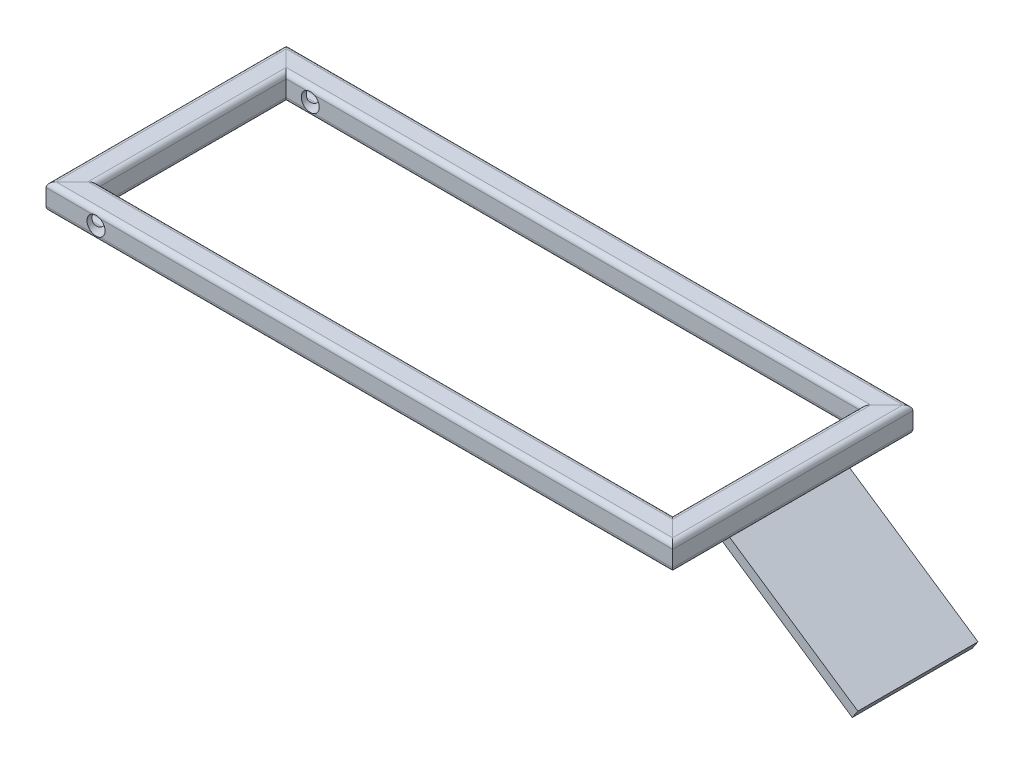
ISO-10303-21;
HEADER;
FILE_DESCRIPTION(('STEP AP214'),'2;1');
FILE_NAME('part.step','',(''),(''),'','','');
FILE_SCHEMA(('AUTOMOTIVE_DESIGN { 1 0 10303 214 1 1 1 1 }'));
ENDSEC;
DATA;
#1=APPLICATION_CONTEXT('core data for automotive mechanical design processes');
#2=APPLICATION_PROTOCOL_DEFINITION('international standard','automotive_design',2000,#1);
#3=PRODUCT_CONTEXT('',#1,'mechanical');
#4=PRODUCT('Part','Part','',(#3));
#5=PRODUCT_RELATED_PRODUCT_CATEGORY('part','',(#4));
#6=PRODUCT_DEFINITION_FORMATION('','',#4);
#7=PRODUCT_DEFINITION_CONTEXT('part definition',#1,'design');
#8=PRODUCT_DEFINITION('design','',#6,#7);
#9=PRODUCT_DEFINITION_SHAPE('','',#8);
#10=(LENGTH_UNIT() NAMED_UNIT(*) SI_UNIT(.MILLI.,.METRE.));
#11=(NAMED_UNIT(*) PLANE_ANGLE_UNIT() SI_UNIT($,.RADIAN.));
#12=(NAMED_UNIT(*) SI_UNIT($,.STERADIAN.) SOLID_ANGLE_UNIT());
#13=UNCERTAINTY_MEASURE_WITH_UNIT(LENGTH_MEASURE(1.E-05),#10,'distance_accuracy_value','');
#14=(GEOMETRIC_REPRESENTATION_CONTEXT(3) GLOBAL_UNCERTAINTY_ASSIGNED_CONTEXT((#13)) GLOBAL_UNIT_ASSIGNED_CONTEXT((#10,
#11,#12)) REPRESENTATION_CONTEXT('',''));
#15=CARTESIAN_POINT('',(0.,0.,0.));
#16=DIRECTION('',(0.,0.,1.));
#17=DIRECTION('',(1.,0.,0.));
#18=AXIS2_PLACEMENT_3D('',#15,#16,#17);
#19=CARTESIAN_POINT('',(154.941458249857,-6.5,30.));
#20=DIRECTION('',(0.,-1.,0.));
#21=DIRECTION('',(0.,0.,-1.));
#22=AXIS2_PLACEMENT_3D('',#19,#20,#21);
#23=PLANE('',#22);
#24=DIRECTION('',(-1.,0.,0.));
#25=VECTOR('',#24,1.);
#26=CARTESIAN_POINT('',(154.941458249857,-6.5,-30.));
#27=LINE('',#26,#25);
#28=CARTESIAN_POINT('',(154.941458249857,-6.5,-30.));
#29=VERTEX_POINT('',#28);
#30=CARTESIAN_POINT('',(146.,-6.5,-30.));
#31=VERTEX_POINT('',#30);
#32=EDGE_CURVE('E141',#29,#31,#27,.T.);
#33=ORIENTED_EDGE('',*,*,#32,.T.);
#34=DIRECTION('',(0.,0.,-1.));
#35=VECTOR('',#34,1.);
#36=CARTESIAN_POINT('',(146.,-6.5,30.));
#37=LINE('',#36,#35);
#38=CARTESIAN_POINT('',(146.,-6.5,30.));
#39=VERTEX_POINT('',#38);
#40=EDGE_CURVE('E13',#39,#31,#37,.T.);
#41=ORIENTED_EDGE('',*,*,#40,.F.);
#42=DIRECTION('',(-1.,0.,0.));
#43=VECTOR('',#42,1.);
#44=CARTESIAN_POINT('',(154.941458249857,-6.5,30.));
#45=LINE('',#44,#43);
#46=CARTESIAN_POINT('',(154.941458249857,-6.5,30.));
#47=VERTEX_POINT('',#46);
#48=EDGE_CURVE('E129',#47,#39,#45,.T.);
#49=ORIENTED_EDGE('',*,*,#48,.F.);
#50=DIRECTION('',(0.,0.,-1.));
#51=VECTOR('',#50,1.);
#52=CARTESIAN_POINT('',(154.941458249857,-6.5,30.));
#53=LINE('',#52,#51);
#54=EDGE_CURVE('E137',#47,#29,#53,.T.);
#55=ORIENTED_EDGE('',*,*,#54,.T.);
#56=EDGE_LOOP('',(#33,#41,#49,#55));
#57=FACE_BOUND('',#56,.T.);
#58=ADVANCED_FACE('F78',(#57),#23,.F.);
#59=CARTESIAN_POINT('',(146.,-6.5,30.));
#60=DIRECTION('',(0.559192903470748,0.829037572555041,0.));
#61=DIRECTION('',(-0.829037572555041,0.559192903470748,0.));
#62=AXIS2_PLACEMENT_3D('',#59,#60,#61);
#63=PLANE('',#62);
#64=DIRECTION('',(0.829037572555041,-0.559192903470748,0.));
#65=VECTOR('',#64,1.);
#66=CARTESIAN_POINT('',(146.,-6.5,-30.));
#67=LINE('',#66,#65);
#68=CARTESIAN_POINT('',(216.236063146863,-53.8748227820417,-30.));
#69=VERTEX_POINT('',#68);
#70=EDGE_CURVE('E133',#31,#69,#67,.T.);
#71=ORIENTED_EDGE('',*,*,#70,.T.);
#72=DIRECTION('',(0.,0.,-1.));
#73=VECTOR('',#72,1.);
#74=CARTESIAN_POINT('',(216.236063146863,-53.8748227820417,30.));
#75=LINE('',#74,#73);
#76=CARTESIAN_POINT('',(216.236063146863,-53.8748227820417,30.));
#77=VERTEX_POINT('',#76);
#78=EDGE_CURVE('E86',#77,#69,#75,.T.);
#79=ORIENTED_EDGE('',*,*,#78,.F.);
#80=DIRECTION('',(0.829037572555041,-0.559192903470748,0.));
#81=VECTOR('',#80,1.);
#82=CARTESIAN_POINT('',(146.,-6.5,30.));
#83=LINE('',#82,#81);
#84=EDGE_CURVE('E124',#39,#77,#83,.T.);
#85=ORIENTED_EDGE('',*,*,#84,.F.);
#86=ORIENTED_EDGE('',*,*,#40,.T.);
#87=EDGE_LOOP('',(#71,#79,#85,#86));
#88=FACE_BOUND('',#87,.T.);
#89=ADVANCED_FACE('F132',(#88),#63,.F.);
#90=CARTESIAN_POINT('',(216.236063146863,-53.8748227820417,30.));
#91=DIRECTION('',(-0.829037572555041,0.559192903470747,0.));
#92=DIRECTION('',(-0.559192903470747,-0.829037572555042,0.));
#93=AXIS2_PLACEMENT_3D('',#90,#91,#92);
#94=PLANE('',#93);
#95=DIRECTION('',(0.559192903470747,0.829037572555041,0.));
#96=VECTOR('',#95,1.);
#97=CARTESIAN_POINT('',(216.236063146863,-53.8748227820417,-30.));
#98=LINE('',#97,#96);
#99=CARTESIAN_POINT('',(219.032027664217,-49.7296349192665,-30.));
#100=VERTEX_POINT('',#99);
#101=EDGE_CURVE('E111',#69,#100,#98,.T.);
#102=ORIENTED_EDGE('',*,*,#101,.T.);
#103=DIRECTION('',(0.,0.,-1.));
#104=VECTOR('',#103,1.);
#105=CARTESIAN_POINT('',(219.032027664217,-49.7296349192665,30.));
#106=LINE('',#105,#104);
#107=CARTESIAN_POINT('',(219.032027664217,-49.7296349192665,30.));
#108=VERTEX_POINT('',#107);
#109=EDGE_CURVE('E134',#108,#100,#106,.T.);
#110=ORIENTED_EDGE('',*,*,#109,.F.);
#111=DIRECTION('',(0.559192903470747,0.829037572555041,0.));
#112=VECTOR('',#111,1.);
#113=CARTESIAN_POINT('',(216.236063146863,-53.8748227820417,30.));
#114=LINE('',#113,#112);
#115=EDGE_CURVE('E127',#77,#108,#114,.T.);
#116=ORIENTED_EDGE('',*,*,#115,.F.);
#117=ORIENTED_EDGE('',*,*,#78,.T.);
#118=EDGE_LOOP('',(#102,#110,#116,#117));
#119=FACE_BOUND('',#118,.T.);
#120=ADVANCED_FACE('F135',(#119),#94,.F.);
#121=CARTESIAN_POINT('',(219.032027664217,-49.7296349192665,30.));
#122=DIRECTION('',(-0.559192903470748,-0.829037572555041,0.));
#123=DIRECTION('',(0.829037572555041,-0.559192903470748,0.));
#124=AXIS2_PLACEMENT_3D('',#121,#122,#123);
#125=PLANE('',#124);
#126=DIRECTION('',(-0.829037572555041,0.559192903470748,0.));
#127=VECTOR('',#126,1.);
#128=CARTESIAN_POINT('',(219.032027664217,-49.7296349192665,-30.));
#129=LINE('',#128,#127);
#130=EDGE_CURVE('E117',#100,#29,#129,.T.);
#131=ORIENTED_EDGE('',*,*,#130,.T.);
#132=ORIENTED_EDGE('',*,*,#54,.F.);
#133=DIRECTION('',(-0.829037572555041,0.559192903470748,0.));
#134=VECTOR('',#133,1.);
#135=CARTESIAN_POINT('',(219.032027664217,-49.7296349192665,30.));
#136=LINE('',#135,#134);
#137=EDGE_CURVE('E94',#108,#47,#136,.T.);
#138=ORIENTED_EDGE('',*,*,#137,.F.);
#139=ORIENTED_EDGE('',*,*,#109,.T.);
#140=EDGE_LOOP('',(#131,#132,#138,#139));
#141=FACE_BOUND('',#140,.T.);
#142=ADVANCED_FACE('F148',(#141),#125,.F.);
#143=CARTESIAN_POINT('',(0.,0.,30.));
#144=DIRECTION('',(0.,0.,-1.));
#145=DIRECTION('',(-1.,0.,0.));
#146=AXIS2_PLACEMENT_3D('',#143,#144,#145);
#147=PLANE('',#146);
#148=ORIENTED_EDGE('',*,*,#48,.T.);
#149=ORIENTED_EDGE('',*,*,#84,.T.);
#150=ORIENTED_EDGE('',*,*,#115,.T.);
#151=ORIENTED_EDGE('',*,*,#137,.T.);
#152=EDGE_LOOP('',(#148,#149,#150,#151));
#153=FACE_BOUND('',#152,.T.);
#154=ADVANCED_FACE('F125',(#153),#147,.F.);
#155=CARTESIAN_POINT('',(0.,0.,-30.));
#156=DIRECTION('',(0.,0.,-1.));
#157=DIRECTION('',(-1.,0.,0.));
#158=AXIS2_PLACEMENT_3D('',#155,#156,#157);
#159=PLANE('',#158);
#160=ORIENTED_EDGE('',*,*,#32,.F.);
#161=ORIENTED_EDGE('',*,*,#130,.F.);
#162=ORIENTED_EDGE('',*,*,#101,.F.);
#163=ORIENTED_EDGE('',*,*,#70,.F.);
#164=EDGE_LOOP('',(#160,#161,#162,#163));
#165=FACE_BOUND('',#164,.T.);
#166=ADVANCED_FACE('F151',(#165),#159,.T.);
#167=CLOSED_SHELL('',(#58,#89,#120,#142,#154,#166));
#168=MANIFOLD_SOLID_BREP('B2',#167);
#169=CARTESIAN_POINT('',(150.,3.99999999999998,-60.));
#170=DIRECTION('',(0.,0.,1.));
#171=DIRECTION('',(0.,-1.,0.));
#172=AXIS2_PLACEMENT_3D('',#169,#170,#171);
#173=PLANE('',#172);
#174=DIRECTION('',(-1.,0.,0.));
#175=VECTOR('',#174,1.);
#176=CARTESIAN_POINT('',(150.,-3.99999999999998,-60.));
#177=LINE('',#176,#175);
#178=CARTESIAN_POINT('',(156.5,-3.99999999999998,-60.));
#179=VERTEX_POINT('',#178);
#180=CARTESIAN_POINT('',(-129.438447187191,-3.99999999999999,-60.));
#181=VERTEX_POINT('',#180);
#182=EDGE_CURVE('E411',#179,#181,#177,.T.);
#183=ORIENTED_EDGE('',*,*,#182,.T.);
#184=CARTESIAN_POINT('',(-131.5,0.,-60.));
#185=DIRECTION('',(0.,0.,1.));
#186=DIRECTION('',(1.,0.,0.));
#187=AXIS2_PLACEMENT_3D('',#184,#185,#186);
#188=CIRCLE('',#187,4.49999999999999);
#189=CARTESIAN_POINT('',(-129.438447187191,4.,-60.));
#190=VERTEX_POINT('',#189);
#191=EDGE_CURVE('E397',#181,#190,#188,.T.);
#192=ORIENTED_EDGE('',*,*,#191,.T.);
#193=DIRECTION('',(-1.,0.,0.));
#194=VECTOR('',#193,1.);
#195=CARTESIAN_POINT('',(150.,3.99999999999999,-60.));
#196=LINE('',#195,#194);
#197=CARTESIAN_POINT('',(156.5,3.99999999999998,-60.));
#198=VERTEX_POINT('',#197);
#199=EDGE_CURVE('E408',#198,#190,#196,.T.);
#200=ORIENTED_EDGE('',*,*,#199,.F.);
#201=DIRECTION('',(0.,1.,0.));
#202=VECTOR('',#201,1.);
#203=CARTESIAN_POINT('',(156.5,3.99999999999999,-60.));
#204=LINE('',#203,#202);
#205=EDGE_CURVE('E736',#179,#198,#204,.T.);
#206=ORIENTED_EDGE('',*,*,#205,.F.);
#207=EDGE_LOOP('',(#183,#192,#200,#206));
#208=FACE_BOUND('',#207,.T.);
#209=ADVANCED_FACE('F212',(#208),#173,.F.);
#210=CARTESIAN_POINT('',(150.,-1.5,-52.));
#211=DIRECTION('',(-1.,0.,0.));
#212=DIRECTION('',(0.,0.,1.));
#213=AXIS2_PLACEMENT_3D('',#210,#211,#212);
#214=CYLINDRICAL_SURFACE('',#213,2.5);
#215=CARTESIAN_POINT('',(-127.257359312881,-1.5,-49.5));
#216=CARTESIAN_POINT('',(-127.283213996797,-1.57317854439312,-49.4999909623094));
#217=CARTESIAN_POINT('',(-127.310979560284,-1.64563928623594,-49.5032119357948));
#218=CARTESIAN_POINT('',(-127.369968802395,-1.7885098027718,-49.515672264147));
#219=CARTESIAN_POINT('',(-127.401188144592,-1.85892201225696,-49.5249041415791));
#220=CARTESIAN_POINT('',(-127.466515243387,-1.99669104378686,-49.5488471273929));
#221=CARTESIAN_POINT('',(-127.500596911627,-2.06406835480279,-49.5635121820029));
#222=CARTESIAN_POINT('',(-127.571508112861,-2.19603507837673,-49.5978785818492));
#223=CARTESIAN_POINT('',(-127.608338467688,-2.26062364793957,-49.6175814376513));
#224=CARTESIAN_POINT('',(-127.722014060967,-2.44912827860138,-49.6833651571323));
#225=CARTESIAN_POINT('',(-127.802429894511,-2.5685863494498,-49.7362699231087));
#226=CARTESIAN_POINT('',(-127.970047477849,-2.79452069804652,-49.8574021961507));
#227=CARTESIAN_POINT('',(-128.057267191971,-2.90096056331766,-49.9256712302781));
#228=CARTESIAN_POINT('',(-128.253720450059,-3.12048532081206,-50.0904234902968));
#229=CARTESIAN_POINT('',(-128.363853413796,-3.23060116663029,-50.1898197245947));
#230=CARTESIAN_POINT('',(-128.529514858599,-3.38109685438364,-50.3517000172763));
#231=CARTESIAN_POINT('',(-128.584823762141,-3.42882404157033,-50.4078039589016));
#232=CARTESIAN_POINT('',(-128.694838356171,-3.51939404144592,-50.5243671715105));
#233=CARTESIAN_POINT('',(-128.749544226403,-3.56223834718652,-50.5848251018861));
#234=CARTESIAN_POINT('',(-128.876302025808,-3.65711209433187,-50.7323072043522));
#235=CARTESIAN_POINT('',(-128.947712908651,-3.70709728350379,-50.8212154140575));
#236=CARTESIAN_POINT('',(-129.084086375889,-3.79736683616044,-51.0085765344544));
#237=CARTESIAN_POINT('',(-129.149053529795,-3.83765810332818,-51.1070225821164));
#238=CARTESIAN_POINT('',(-129.246229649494,-3.89519893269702,-51.2800766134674));
#239=CARTESIAN_POINT('',(-129.2820986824,-3.91563726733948,-51.3515330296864));
#240=CARTESIAN_POINT('',(-129.344887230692,-3.95054019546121,-51.4994164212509));
#241=CARTESIAN_POINT('',(-129.371850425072,-3.96503403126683,-51.5758168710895));
#242=CARTESIAN_POINT('',(-129.407194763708,-3.98377518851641,-51.7101557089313));
#243=CARTESIAN_POINT('',(-129.418698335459,-3.9897758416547,-51.7670118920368));
#244=CARTESIAN_POINT('',(-129.434421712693,-3.99792631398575,-51.8825191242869));
#245=CARTESIAN_POINT('',(-129.438571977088,-4.0000393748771,-51.9411820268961));
#246=CARTESIAN_POINT('',(-129.438447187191,-4.,-52.));
#247=B_SPLINE_CURVE_WITH_KNOTS('',3,(#215,#216,#217,#218,#219,#220,#221,#222,#223,#224,#225,
#226,#227,#228,#229,#230,#231,#232,#233,#234,#235,#236,#237,#238,#239,#240,#241,#242,#243,#244,
#245,#246),.UNSPECIFIED.,.F.,.F.,(4,2,2,2,2,2,2,2,2,2,2,2,2,2,2,4),(0.,0.232682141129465,
0.465075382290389,0.695542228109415,0.926078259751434,1.38447096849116,1.84411784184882,
2.39620992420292,2.67236957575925,2.94844455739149,3.32128658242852,3.69386229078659,
3.94083989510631,4.18658755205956,4.36096465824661,4.53698223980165),.UNSPECIFIED.);
#248=CARTESIAN_POINT('',(-127.257359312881,-1.5,-49.5));
#249=VERTEX_POINT('',#248);
#250=CARTESIAN_POINT('',(-129.438447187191,-4.,-52.));
#251=VERTEX_POINT('',#250);
#252=EDGE_CURVE('E235',#249,#251,#247,.T.);
#253=ORIENTED_EDGE('',*,*,#252,.F.);
#254=DIRECTION('',(-1.,0.,0.));
#255=VECTOR('',#254,1.);
#256=CARTESIAN_POINT('',(150.,-1.5,-49.5));
#257=LINE('',#256,#255);
#258=CARTESIAN_POINT('',(146.,-1.5,-49.5));
#259=VERTEX_POINT('',#258);
#260=EDGE_CURVE('E594',#259,#249,#257,.T.);
#261=ORIENTED_EDGE('',*,*,#260,.F.);
#262=CARTESIAN_POINT('',(148.5,-1.5,-52.));
#263=DIRECTION('',(0.707106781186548,0.,0.707106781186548));
#264=DIRECTION('',(-0.707106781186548,0.,0.707106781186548));
#265=AXIS2_PLACEMENT_3D('',#262,#263,#264);
#266=ELLIPSE('',#265,3.53553390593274,2.5);
#267=CARTESIAN_POINT('',(148.5,-4.,-52.));
#268=VERTEX_POINT('',#267);
#269=EDGE_CURVE('E609',#259,#268,#266,.T.);
#270=ORIENTED_EDGE('',*,*,#269,.T.);
#271=DIRECTION('',(-1.,0.,0.));
#272=VECTOR('',#271,1.);
#273=CARTESIAN_POINT('',(150.,-4.,-52.));
#274=LINE('',#273,#272);
#275=EDGE_CURVE('E597',#268,#251,#274,.T.);
#276=ORIENTED_EDGE('',*,*,#275,.T.);
#277=EDGE_LOOP('',(#253,#261,#270,#276));
#278=FACE_BOUND('',#277,.T.);
#279=ADVANCED_FACE('F556',(#278),#214,.F.);
#280=CARTESIAN_POINT('',(150.,1.5,-49.5));
#281=DIRECTION('',(0.,0.,-1.));
#282=DIRECTION('',(-1.,0.,0.));
#283=AXIS2_PLACEMENT_3D('',#280,#281,#282);
#284=PLANE('',#283);
#285=CARTESIAN_POINT('',(-131.5,0.,-49.5));
#286=DIRECTION('',(0.,0.,-1.));
#287=DIRECTION('',(-1.,0.,0.));
#288=AXIS2_PLACEMENT_3D('',#285,#286,#287);
#289=CIRCLE('',#288,4.49999999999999);
#290=CARTESIAN_POINT('',(-127.257359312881,1.5,-49.5));
#291=VERTEX_POINT('',#290);
#292=EDGE_CURVE('E599',#291,#249,#289,.T.);
#293=ORIENTED_EDGE('',*,*,#292,.F.);
#294=DIRECTION('',(-1.,0.,0.));
#295=VECTOR('',#294,1.);
#296=CARTESIAN_POINT('',(150.,1.5,-49.5));
#297=LINE('',#296,#295);
#298=CARTESIAN_POINT('',(146.,1.5,-49.5));
#299=VERTEX_POINT('',#298);
#300=EDGE_CURVE('E612',#299,#291,#297,.T.);
#301=ORIENTED_EDGE('',*,*,#300,.F.);
#302=DIRECTION('',(0.,-1.,0.));
#303=VECTOR('',#302,1.);
#304=CARTESIAN_POINT('',(146.,1.5,-49.5));
#305=LINE('',#304,#303);
#306=EDGE_CURVE('E603',#299,#259,#305,.T.);
#307=ORIENTED_EDGE('',*,*,#306,.T.);
#308=ORIENTED_EDGE('',*,*,#260,.T.);
#309=EDGE_LOOP('',(#293,#301,#307,#308));
#310=FACE_BOUND('',#309,.T.);
#311=ADVANCED_FACE('F583',(#310),#284,.T.);
#312=CARTESIAN_POINT('',(150.,1.5,-52.));
#313=DIRECTION('',(-1.,0.,0.));
#314=DIRECTION('',(0.,0.,1.));
#315=AXIS2_PLACEMENT_3D('',#312,#313,#314);
#316=CYLINDRICAL_SURFACE('',#315,2.5);
#317=CARTESIAN_POINT('',(-129.438447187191,4.,-52.));
#318=CARTESIAN_POINT('',(-129.438468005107,4.00000641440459,-51.9623750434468));
#319=CARTESIAN_POINT('',(-129.436797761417,3.99915018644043,-51.9247765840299));
#320=CARTESIAN_POINT('',(-129.430264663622,3.99577488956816,-51.8500045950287));
#321=CARTESIAN_POINT('',(-129.425408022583,3.9932590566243,-51.8128303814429));
#322=CARTESIAN_POINT('',(-129.40654392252,3.98342112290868,-51.703511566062));
#323=CARTESIAN_POINT('',(-129.388228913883,3.97380386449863,-51.6322963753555));
#324=CARTESIAN_POINT('',(-129.333819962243,3.94447979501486,-51.4670076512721));
#325=CARTESIAN_POINT('',(-129.293583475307,3.92230492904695,-51.3748000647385));
#326=CARTESIAN_POINT('',(-129.202380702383,3.86959224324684,-51.1977117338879));
#327=CARTESIAN_POINT('',(-129.151323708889,3.83898302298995,-51.1129020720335));
#328=CARTESIAN_POINT('',(-129.048660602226,3.77415612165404,-50.9586192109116));
#329=CARTESIAN_POINT('',(-128.997633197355,3.74061731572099,-50.8884625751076));
#330=CARTESIAN_POINT('',(-128.89269350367,3.66824486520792,-50.7531620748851));
#331=CARTESIAN_POINT('',(-128.838779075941,3.6294072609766,-50.6880220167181));
#332=CARTESIAN_POINT('',(-128.729498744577,3.54669155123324,-50.5623964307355));
#333=CARTESIAN_POINT('',(-128.674133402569,3.50281537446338,-50.5019091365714));
#334=CARTESIAN_POINT('',(-128.562910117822,3.41009520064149,-50.3853539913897));
#335=CARTESIAN_POINT('',(-128.507052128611,3.36125073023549,-50.3292865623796));
#336=CARTESIAN_POINT('',(-128.391838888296,3.25513006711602,-50.2179153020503));
#337=CARTESIAN_POINT('',(-128.332502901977,3.19750690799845,-50.1629201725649));
#338=CARTESIAN_POINT('',(-128.214961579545,3.07662931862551,-50.0581868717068));
#339=CARTESIAN_POINT('',(-128.156756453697,3.01337385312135,-50.00844967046));
#340=CARTESIAN_POINT('',(-127.985075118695,2.81526532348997,-49.8677983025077));
#341=CARTESIAN_POINT('',(-127.874271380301,2.67183539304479,-49.785194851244));
#342=CARTESIAN_POINT('',(-127.690252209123,2.39921523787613,-49.6637269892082));
#343=CARTESIAN_POINT('',(-127.614280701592,2.27444331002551,-49.6191609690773));
#344=CARTESIAN_POINT('',(-127.508463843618,2.07921214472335,-49.5670915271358));
#345=CARTESIAN_POINT('',(-127.474577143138,2.0128576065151,-49.5522055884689));
#346=CARTESIAN_POINT('',(-127.409814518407,1.87775947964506,-49.5277536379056));
#347=CARTESIAN_POINT('',(-127.378936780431,1.80901736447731,-49.5181844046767));
#348=CARTESIAN_POINT('',(-127.333238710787,1.69997732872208,-49.5076973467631));
#349=CARTESIAN_POINT('',(-127.317282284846,1.66033142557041,-49.5048267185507));
#350=CARTESIAN_POINT('',(-127.286478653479,1.58052796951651,-49.5009779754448));
#351=CARTESIAN_POINT('',(-127.271631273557,1.54037049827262,-49.4999995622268));
#352=CARTESIAN_POINT('',(-127.257359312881,1.50000000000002,-49.5));
#353=B_SPLINE_CURVE_WITH_KNOTS('',3,(#317,#318,#319,#320,#321,#322,#323,#324,#325,#326,#327,
#328,#329,#330,#331,#332,#333,#334,#335,#336,#337,#338,#339,#340,#341,#342,#343,#344,#345,#346,
#347,#348,#349,#350,#351,#352),.UNSPECIFIED.,.F.,.F.,(4,2,2,2,2,2,2,2,2,2,2,2,2,2,2,2,2,4),(0.,
0.112781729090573,0.225344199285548,0.446707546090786,0.754055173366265,1.06408909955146,
1.34274074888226,1.62160177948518,1.90035641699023,2.17913763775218,2.47679344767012,
2.77450408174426,3.3686464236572,3.82492575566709,4.0526254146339,4.28018696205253,
4.40863229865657,4.5370573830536),.UNSPECIFIED.);
#354=CARTESIAN_POINT('',(-129.438447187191,4.,-52.));
#355=VERTEX_POINT('',#354);
#356=EDGE_CURVE('E506',#355,#291,#353,.T.);
#357=ORIENTED_EDGE('',*,*,#356,.F.);
#358=DIRECTION('',(-1.,0.,0.));
#359=VECTOR('',#358,1.);
#360=CARTESIAN_POINT('',(150.,4.,-52.));
#361=LINE('',#360,#359);
#362=CARTESIAN_POINT('',(148.5,4.,-52.));
#363=VERTEX_POINT('',#362);
#364=EDGE_CURVE('E680',#363,#355,#361,.T.);
#365=ORIENTED_EDGE('',*,*,#364,.F.);
#366=CARTESIAN_POINT('',(148.5,1.5,-52.));
#367=DIRECTION('',(0.707106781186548,0.,0.707106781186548));
#368=DIRECTION('',(-0.707106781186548,0.,0.707106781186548));
#369=AXIS2_PLACEMENT_3D('',#366,#367,#368);
#370=ELLIPSE('',#369,3.53553390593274,2.5);
#371=EDGE_CURVE('E675',#363,#299,#370,.T.);
#372=ORIENTED_EDGE('',*,*,#371,.T.);
#373=ORIENTED_EDGE('',*,*,#300,.T.);
#374=EDGE_LOOP('',(#357,#365,#372,#373));
#375=FACE_BOUND('',#374,.T.);
#376=ADVANCED_FACE('F588',(#375),#316,.F.);
#377=CARTESIAN_POINT('',(150.,4.,-52.));
#378=DIRECTION('',(0.,-1.,0.));
#379=DIRECTION('',(0.,0.,-1.));
#380=AXIS2_PLACEMENT_3D('',#377,#378,#379);
#381=PLANE('',#380);
#382=DIRECTION('',(0.,0.,1.));
#383=VECTOR('',#382,1.);
#384=CARTESIAN_POINT('',(-129.438447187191,4.,-60.));
#385=LINE('',#384,#383);
#386=CARTESIAN_POINT('',(-129.438447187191,4.,-55.));
#387=VERTEX_POINT('',#386);
#388=EDGE_CURVE('E790',#387,#355,#385,.T.);
#389=ORIENTED_EDGE('',*,*,#388,.F.);
#390=DIRECTION('',(-1.,0.,0.));
#391=VECTOR('',#390,1.);
#392=CARTESIAN_POINT('',(150.,4.,-55.));
#393=LINE('',#392,#391);
#394=CARTESIAN_POINT('',(151.5,4.,-55.));
#395=VERTEX_POINT('',#394);
#396=EDGE_CURVE('E685',#395,#387,#393,.T.);
#397=ORIENTED_EDGE('',*,*,#396,.F.);
#398=DIRECTION('',(-0.707106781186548,0.,0.707106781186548));
#399=VECTOR('',#398,1.);
#400=CARTESIAN_POINT('',(149.25,4.,-52.75));
#401=LINE('',#400,#399);
#402=EDGE_CURVE('E679',#395,#363,#401,.T.);
#403=ORIENTED_EDGE('',*,*,#402,.T.);
#404=ORIENTED_EDGE('',*,*,#364,.T.);
#405=EDGE_LOOP('',(#389,#397,#403,#404));
#406=FACE_BOUND('',#405,.T.);
#407=ADVANCED_FACE('F810',(#406),#381,.T.);
#408=CARTESIAN_POINT('',(150.,1.5,-55.));
#409=DIRECTION('',(-1.,0.,0.));
#410=DIRECTION('',(0.,0.,1.));
#411=AXIS2_PLACEMENT_3D('',#408,#409,#410);
#412=CYLINDRICAL_SURFACE('',#411,2.5);
#413=CARTESIAN_POINT('',(-127.257359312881,1.5,-57.5));
#414=CARTESIAN_POINT('',(-127.283213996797,1.57317854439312,-57.5000090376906));
#415=CARTESIAN_POINT('',(-127.310979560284,1.64563928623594,-57.4967880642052));
#416=CARTESIAN_POINT('',(-127.369968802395,1.7885098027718,-57.4843277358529));
#417=CARTESIAN_POINT('',(-127.401188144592,1.85892201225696,-57.4750958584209));
#418=CARTESIAN_POINT('',(-127.466515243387,1.99669104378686,-57.4511528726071));
#419=CARTESIAN_POINT('',(-127.500596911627,2.06406835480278,-57.4364878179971));
#420=CARTESIAN_POINT('',(-127.571508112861,2.19603507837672,-57.4021214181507));
#421=CARTESIAN_POINT('',(-127.608338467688,2.26062364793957,-57.3824185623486));
#422=CARTESIAN_POINT('',(-127.722014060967,2.44912827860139,-57.3166348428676));
#423=CARTESIAN_POINT('',(-127.802429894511,2.5685863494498,-57.2637300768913));
#424=CARTESIAN_POINT('',(-127.970047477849,2.79452069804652,-57.1425978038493));
#425=CARTESIAN_POINT('',(-128.057267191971,2.90096056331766,-57.0743287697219));
#426=CARTESIAN_POINT('',(-128.253720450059,3.12048532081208,-56.9095765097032));
#427=CARTESIAN_POINT('',(-128.363853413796,3.2306011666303,-56.8101802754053));
#428=CARTESIAN_POINT('',(-128.529514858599,3.38109685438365,-56.6482999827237));
#429=CARTESIAN_POINT('',(-128.584823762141,3.42882404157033,-56.5921960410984));
#430=CARTESIAN_POINT('',(-128.694838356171,3.51939404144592,-56.4756328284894));
#431=CARTESIAN_POINT('',(-128.749544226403,3.56223834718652,-56.4151748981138));
#432=CARTESIAN_POINT('',(-128.876302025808,3.65711209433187,-56.2676927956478));
#433=CARTESIAN_POINT('',(-128.947712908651,3.70709728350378,-56.1787845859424));
#434=CARTESIAN_POINT('',(-129.084086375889,3.79736683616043,-55.9914234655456));
#435=CARTESIAN_POINT('',(-129.149053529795,3.83765810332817,-55.8929774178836));
#436=CARTESIAN_POINT('',(-129.246229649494,3.89519893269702,-55.7199233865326));
#437=CARTESIAN_POINT('',(-129.2820986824,3.91563726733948,-55.6484669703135));
#438=CARTESIAN_POINT('',(-129.344887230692,3.95054019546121,-55.5005835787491));
#439=CARTESIAN_POINT('',(-129.371850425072,3.96503403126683,-55.4241831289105));
#440=CARTESIAN_POINT('',(-129.407194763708,3.98377518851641,-55.2898442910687));
#441=CARTESIAN_POINT('',(-129.418698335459,3.9897758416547,-55.2329881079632));
#442=CARTESIAN_POINT('',(-129.434421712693,3.99792631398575,-55.117480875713));
#443=CARTESIAN_POINT('',(-129.438571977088,4.0000393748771,-55.0588179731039));
#444=CARTESIAN_POINT('',(-129.438447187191,4.,-55.));
#445=B_SPLINE_CURVE_WITH_KNOTS('',3,(#413,#414,#415,#416,#417,#418,#419,#420,#421,#422,#423,
#424,#425,#426,#427,#428,#429,#430,#431,#432,#433,#434,#435,#436,#437,#438,#439,#440,#441,#442,
#443,#444),.UNSPECIFIED.,.F.,.F.,(4,2,2,2,2,2,2,2,2,2,2,2,2,2,2,4),(0.,0.23268214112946,
0.465075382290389,0.695542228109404,0.926078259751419,1.38447096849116,1.84411784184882,
2.39620992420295,2.67236957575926,2.94844455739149,3.32128658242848,3.69386229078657,
3.94083989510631,4.18658755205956,4.36096465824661,4.53698223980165),.UNSPECIFIED.);
#446=CARTESIAN_POINT('',(-127.257359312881,1.5,-57.5));
#447=VERTEX_POINT('',#446);
#448=EDGE_CURVE('E497',#447,#387,#445,.T.);
#449=ORIENTED_EDGE('',*,*,#448,.F.);
#450=DIRECTION('',(-1.,0.,0.));
#451=VECTOR('',#450,1.);
#452=CARTESIAN_POINT('',(150.,1.5,-57.5));
#453=LINE('',#452,#451);
#454=CARTESIAN_POINT('',(154.,1.5,-57.5));
#455=VERTEX_POINT('',#454);
#456=EDGE_CURVE('E690',#455,#447,#453,.T.);
#457=ORIENTED_EDGE('',*,*,#456,.F.);
#458=CARTESIAN_POINT('',(151.5,1.5,-55.));
#459=DIRECTION('',(0.707106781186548,0.,0.707106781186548));
#460=DIRECTION('',(-0.707106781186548,0.,0.707106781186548));
#461=AXIS2_PLACEMENT_3D('',#458,#459,#460);
#462=ELLIPSE('',#461,3.53553390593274,2.5);
#463=EDGE_CURVE('E684',#455,#395,#462,.T.);
#464=ORIENTED_EDGE('',*,*,#463,.T.);
#465=ORIENTED_EDGE('',*,*,#396,.T.);
#466=EDGE_LOOP('',(#449,#457,#464,#465));
#467=FACE_BOUND('',#466,.T.);
#468=ADVANCED_FACE('F813',(#467),#412,.F.);
#469=CARTESIAN_POINT('',(150.,1.5,-57.5));
#470=DIRECTION('',(0.,0.,1.));
#471=DIRECTION('',(1.,0.,0.));
#472=AXIS2_PLACEMENT_3D('',#469,#470,#471);
#473=PLANE('',#472);
#474=CARTESIAN_POINT('',(-131.5,0.,-57.5));
#475=DIRECTION('',(0.,0.,1.));
#476=DIRECTION('',(1.,0.,0.));
#477=AXIS2_PLACEMENT_3D('',#474,#475,#476);
#478=CIRCLE('',#477,4.49999999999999);
#479=CARTESIAN_POINT('',(-135.742640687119,1.5,-57.5));
#480=VERTEX_POINT('',#479);
#481=CARTESIAN_POINT('',(-135.742640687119,-1.5,-57.5));
#482=VERTEX_POINT('',#481);
#483=EDGE_CURVE('E788',#480,#482,#478,.T.);
#484=ORIENTED_EDGE('',*,*,#483,.F.);
#485=CARTESIAN_POINT('',(-154.,1.5,-57.5));
#486=VERTEX_POINT('',#485);
#487=EDGE_CURVE('E705',#480,#486,#453,.T.);
#488=ORIENTED_EDGE('',*,*,#487,.T.);
#489=DIRECTION('',(0.,-1.,0.));
#490=VECTOR('',#489,1.);
#491=CARTESIAN_POINT('',(-154.,1.5,-57.5));
#492=LINE('',#491,#490);
#493=CARTESIAN_POINT('',(-154.,-1.5,-57.5));
#494=VERTEX_POINT('',#493);
#495=EDGE_CURVE('E686',#486,#494,#492,.T.);
#496=ORIENTED_EDGE('',*,*,#495,.T.);
#497=DIRECTION('',(-1.,0.,0.));
#498=VECTOR('',#497,1.);
#499=CARTESIAN_POINT('',(150.,-1.5,-57.5));
#500=LINE('',#499,#498);
#501=EDGE_CURVE('E702',#482,#494,#500,.T.);
#502=ORIENTED_EDGE('',*,*,#501,.F.);
#503=EDGE_LOOP('',(#484,#488,#496,#502));
#504=FACE_BOUND('',#503,.T.);
#505=ADVANCED_FACE('F772',(#504),#473,.T.);
#506=CARTESIAN_POINT('',(150.,-1.5,-55.));
#507=DIRECTION('',(-1.,0.,0.));
#508=DIRECTION('',(0.,0.,1.));
#509=AXIS2_PLACEMENT_3D('',#506,#507,#508);
#510=CYLINDRICAL_SURFACE('',#509,2.5);
#511=CARTESIAN_POINT('',(-129.438447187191,-4.,-55.));
#512=CARTESIAN_POINT('',(-129.438468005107,-4.00000641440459,-55.0376249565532));
#513=CARTESIAN_POINT('',(-129.436797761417,-3.99915018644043,-55.0752234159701));
#514=CARTESIAN_POINT('',(-129.430264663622,-3.99577488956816,-55.1499954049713));
#515=CARTESIAN_POINT('',(-129.425408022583,-3.9932590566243,-55.1871696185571));
#516=CARTESIAN_POINT('',(-129.40654392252,-3.98342112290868,-55.296488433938));
#517=CARTESIAN_POINT('',(-129.388228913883,-3.97380386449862,-55.3677036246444));
#518=CARTESIAN_POINT('',(-129.333819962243,-3.94447979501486,-55.5329923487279));
#519=CARTESIAN_POINT('',(-129.293583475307,-3.92230492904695,-55.6251999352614));
#520=CARTESIAN_POINT('',(-129.202380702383,-3.86959224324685,-55.8022882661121));
#521=CARTESIAN_POINT('',(-129.151323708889,-3.83898302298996,-55.8870979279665));
#522=CARTESIAN_POINT('',(-129.048660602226,-3.77415612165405,-56.0413807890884));
#523=CARTESIAN_POINT('',(-128.997633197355,-3.74061731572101,-56.1115374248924));
#524=CARTESIAN_POINT('',(-128.89269350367,-3.66824486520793,-56.2468379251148));
#525=CARTESIAN_POINT('',(-128.838779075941,-3.62940726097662,-56.3119779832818));
#526=CARTESIAN_POINT('',(-128.729498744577,-3.54669155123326,-56.4376035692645));
#527=CARTESIAN_POINT('',(-128.674133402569,-3.50281537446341,-56.4980908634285));
#528=CARTESIAN_POINT('',(-128.562910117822,-3.41009520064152,-56.6146460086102));
#529=CARTESIAN_POINT('',(-128.507052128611,-3.36125073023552,-56.6707134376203));
#530=CARTESIAN_POINT('',(-128.391838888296,-3.25513006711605,-56.7820846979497));
#531=CARTESIAN_POINT('',(-128.332502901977,-3.19750690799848,-56.8370798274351));
#532=CARTESIAN_POINT('',(-128.214961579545,-3.07662931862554,-56.9418131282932));
#533=CARTESIAN_POINT('',(-128.156756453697,-3.01337385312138,-56.99155032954));
#534=CARTESIAN_POINT('',(-127.985075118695,-2.81526532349,-57.1322016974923));
#535=CARTESIAN_POINT('',(-127.874271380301,-2.67183539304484,-57.214805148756));
#536=CARTESIAN_POINT('',(-127.690252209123,-2.39921523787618,-57.3362730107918));
#537=CARTESIAN_POINT('',(-127.614280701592,-2.27444331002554,-57.3808390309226));
#538=CARTESIAN_POINT('',(-127.508463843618,-2.07921214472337,-57.4329084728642));
#539=CARTESIAN_POINT('',(-127.474577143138,-2.01285760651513,-57.4477944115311));
#540=CARTESIAN_POINT('',(-127.409814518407,-1.87775947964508,-57.4722463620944));
#541=CARTESIAN_POINT('',(-127.378936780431,-1.80901736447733,-57.4818155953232));
#542=CARTESIAN_POINT('',(-127.333238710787,-1.69997732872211,-57.4923026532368));
#543=CARTESIAN_POINT('',(-127.317282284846,-1.66033142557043,-57.4951732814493));
#544=CARTESIAN_POINT('',(-127.286478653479,-1.58052796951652,-57.4990220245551));
#545=CARTESIAN_POINT('',(-127.271631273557,-1.54037049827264,-57.5000004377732));
#546=CARTESIAN_POINT('',(-127.257359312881,-1.50000000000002,-57.5));
#547=B_SPLINE_CURVE_WITH_KNOTS('',3,(#511,#512,#513,#514,#515,#516,#517,#518,#519,#520,#521,
#522,#523,#524,#525,#526,#527,#528,#529,#530,#531,#532,#533,#534,#535,#536,#537,#538,#539,#540,
#541,#542,#543,#544,#545,#546),.UNSPECIFIED.,.F.,.F.,(4,2,2,2,2,2,2,2,2,2,2,2,2,2,2,2,2,4),(0.,
0.112781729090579,0.225344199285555,0.446707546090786,0.754055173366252,1.06408909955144,
1.34274074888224,1.62160177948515,1.90035641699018,2.17913763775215,2.47679344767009,
2.77450408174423,3.36864642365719,3.82492575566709,4.05262541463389,4.28018696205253,
4.40863229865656,4.53705738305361),.UNSPECIFIED.);
#548=CARTESIAN_POINT('',(-129.438447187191,-4.,-55.));
#549=VERTEX_POINT('',#548);
#550=CARTESIAN_POINT('',(-127.257359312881,-1.5,-57.5));
#551=VERTEX_POINT('',#550);
#552=EDGE_CURVE('E488',#549,#551,#547,.T.);
#553=ORIENTED_EDGE('',*,*,#552,.F.);
#554=DIRECTION('',(-1.,0.,0.));
#555=VECTOR('',#554,1.);
#556=CARTESIAN_POINT('',(150.,-4.,-55.));
#557=LINE('',#556,#555);
#558=CARTESIAN_POINT('',(151.5,-4.,-55.));
#559=VERTEX_POINT('',#558);
#560=EDGE_CURVE('E641',#559,#549,#557,.T.);
#561=ORIENTED_EDGE('',*,*,#560,.F.);
#562=CARTESIAN_POINT('',(151.5,-1.5,-55.));
#563=DIRECTION('',(0.707106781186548,0.,0.707106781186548));
#564=DIRECTION('',(-0.707106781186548,0.,0.707106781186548));
#565=AXIS2_PLACEMENT_3D('',#562,#563,#564);
#566=ELLIPSE('',#565,3.53553390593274,2.5);
#567=CARTESIAN_POINT('',(154.,-1.5,-57.5));
#568=VERTEX_POINT('',#567);
#569=EDGE_CURVE('E693',#559,#568,#566,.T.);
#570=ORIENTED_EDGE('',*,*,#569,.T.);
#571=EDGE_CURVE('E694',#568,#551,#500,.T.);
#572=ORIENTED_EDGE('',*,*,#571,.T.);
#573=EDGE_LOOP('',(#553,#561,#570,#572));
#574=FACE_BOUND('',#573,.T.);
#575=ADVANCED_FACE('F768',(#574),#510,.F.);
#576=CARTESIAN_POINT('',(150.,-4.,-52.));
#577=DIRECTION('',(0.,1.,0.));
#578=DIRECTION('',(0.,0.,1.));
#579=AXIS2_PLACEMENT_3D('',#576,#577,#578);
#580=PLANE('',#579);
#581=DIRECTION('',(0.,0.,1.));
#582=VECTOR('',#581,1.);
#583=CARTESIAN_POINT('',(-133.561552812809,-4.,-60.));
#584=LINE('',#583,#582);
#585=CARTESIAN_POINT('',(-133.561552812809,-4.,-55.));
#586=VERTEX_POINT('',#585);
#587=CARTESIAN_POINT('',(-133.561552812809,-4.,-52.));
#588=VERTEX_POINT('',#587);
#589=EDGE_CURVE('E598',#586,#588,#584,.T.);
#590=ORIENTED_EDGE('',*,*,#589,.F.);
#591=CARTESIAN_POINT('',(-151.5,-4.,-55.));
#592=VERTEX_POINT('',#591);
#593=EDGE_CURVE('E639',#586,#592,#557,.T.);
#594=ORIENTED_EDGE('',*,*,#593,.T.);
#595=DIRECTION('',(0.707106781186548,0.,0.707106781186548));
#596=VECTOR('',#595,1.);
#597=CARTESIAN_POINT('',(0.75,-3.99999999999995,97.25));
#598=LINE('',#597,#596);
#599=CARTESIAN_POINT('',(-148.5,-4.,-52.));
#600=VERTEX_POINT('',#599);
#601=EDGE_CURVE('E633',#592,#600,#598,.T.);
#602=ORIENTED_EDGE('',*,*,#601,.T.);
#603=EDGE_CURVE('E615',#588,#600,#274,.T.);
#604=ORIENTED_EDGE('',*,*,#603,.F.);
#605=EDGE_LOOP('',(#590,#594,#602,#604));
#606=FACE_BOUND('',#605,.T.);
#607=ADVANCED_FACE('F637',(#606),#580,.T.);
#608=CARTESIAN_POINT('',(150.,3.99999999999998,-47.));
#609=DIRECTION('',(0.,0.,-1.));
#610=DIRECTION('',(0.,1.,0.));
#611=AXIS2_PLACEMENT_3D('',#608,#609,#610);
#612=PLANE('',#611);
#613=DIRECTION('',(-1.,0.,0.));
#614=VECTOR('',#613,1.);
#615=CARTESIAN_POINT('',(150.,3.99999999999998,-47.));
#616=LINE('',#615,#614);
#617=CARTESIAN_POINT('',(143.5,3.99999999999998,-47.));
#618=VERTEX_POINT('',#617);
#619=CARTESIAN_POINT('',(-129.438447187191,3.99999999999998,-47.));
#620=VERTEX_POINT('',#619);
#621=EDGE_CURVE('E697',#618,#620,#616,.T.);
#622=ORIENTED_EDGE('',*,*,#621,.T.);
#623=CARTESIAN_POINT('',(-131.5,0.,-47.));
#624=DIRECTION('',(0.,0.,-1.));
#625=DIRECTION('',(0.,1.,0.));
#626=AXIS2_PLACEMENT_3D('',#623,#624,#625);
#627=CIRCLE('',#626,4.49999999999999);
#628=CARTESIAN_POINT('',(-129.438447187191,-3.99999999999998,-47.));
#629=VERTEX_POINT('',#628);
#630=EDGE_CURVE('E76',#620,#629,#627,.T.);
#631=ORIENTED_EDGE('',*,*,#630,.T.);
#632=DIRECTION('',(-1.,0.,0.));
#633=VECTOR('',#632,1.);
#634=CARTESIAN_POINT('',(150.,-3.99999999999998,-47.));
#635=LINE('',#634,#633);
#636=CARTESIAN_POINT('',(143.5,-3.99999999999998,-47.));
#637=VERTEX_POINT('',#636);
#638=EDGE_CURVE('E432',#637,#629,#635,.T.);
#639=ORIENTED_EDGE('',*,*,#638,.F.);
#640=DIRECTION('',(0.,-1.,0.));
#641=VECTOR('',#640,1.);
#642=CARTESIAN_POINT('',(143.5,3.99999999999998,-47.));
#643=LINE('',#642,#641);
#644=EDGE_CURVE('E456',#618,#637,#643,.T.);
#645=ORIENTED_EDGE('',*,*,#644,.F.);
#646=EDGE_LOOP('',(#622,#631,#639,#645));
#647=FACE_BOUND('',#646,.T.);
#648=ADVANCED_FACE('F562',(#647),#612,.F.);
#649=CARTESIAN_POINT('',(150.,-4.,-49.5));
#650=DIRECTION('',(-1.,0.,0.));
#651=DIRECTION('',(0.,0.,1.));
#652=AXIS2_PLACEMENT_3D('',#649,#650,#651);
#653=CYLINDRICAL_SURFACE('',#652,2.5);
#654=ORIENTED_EDGE('',*,*,#638,.T.);
#655=CARTESIAN_POINT('',(-129.438447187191,-3.99999999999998,-47.));
#656=CARTESIAN_POINT('',(-129.532350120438,-4.04840356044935,-47.0000234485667));
#657=CARTESIAN_POINT('',(-129.627944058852,-4.09347951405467,-47.0014062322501));
#658=CARTESIAN_POINT('',(-129.822003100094,-4.17677591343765,-47.005902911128));
#659=CARTESIAN_POINT('',(-129.92046733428,-4.21499840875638,-47.0090162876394));
#660=CARTESIAN_POINT('',(-130.119789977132,-4.28440881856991,-47.0159869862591));
#661=CARTESIAN_POINT('',(-130.220647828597,-4.31559835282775,-47.0198441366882));
#662=CARTESIAN_POINT('',(-130.424321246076,-4.37081801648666,-47.0274967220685));
#663=CARTESIAN_POINT('',(-130.527137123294,-4.39484699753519,-47.0312921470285));
#664=CARTESIAN_POINT('',(-130.753610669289,-4.43943623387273,-47.0388003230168));
#665=CARTESIAN_POINT('',(-130.877569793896,-4.45850715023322,-47.0423648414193));
#666=CARTESIAN_POINT('',(-131.126692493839,-4.48624026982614,-47.0477011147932));
#667=CARTESIAN_POINT('',(-131.251856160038,-4.49490168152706,-47.0494727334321));
#668=CARTESIAN_POINT('',(-131.502525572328,-4.50174612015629,-47.0508647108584));
#669=CARTESIAN_POINT('',(-131.628031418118,-4.4999256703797,-47.0504843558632));
#670=CARTESIAN_POINT('',(-131.878425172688,-4.48581312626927,-47.0476467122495));
#671=CARTESIAN_POINT('',(-132.003313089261,-4.47352116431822,-47.0451894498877));
#672=CARTESIAN_POINT('',(-132.252129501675,-4.43848557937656,-47.0386897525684));
#673=CARTESIAN_POINT('',(-132.376051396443,-4.41569639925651,-47.0346404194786));
#674=CARTESIAN_POINT('',(-132.62152184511,-4.35982074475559,-47.0258683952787));
#675=CARTESIAN_POINT('',(-132.743070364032,-4.32673411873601,-47.0211456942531));
#676=CARTESIAN_POINT('',(-132.983181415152,-4.25041874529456,-47.0122765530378));
#677=CARTESIAN_POINT('',(-133.101739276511,-4.20717510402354,-47.0081309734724));
#678=CARTESIAN_POINT('',(-133.276556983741,-4.1349517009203,-47.0035290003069));
#679=CARTESIAN_POINT('',(-133.334336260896,-4.10964581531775,-47.002264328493));
#680=CARTESIAN_POINT('',(-133.448794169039,-4.05662163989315,-47.0005009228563));
#681=CARTESIAN_POINT('',(-133.505472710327,-4.02890315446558,-47.0000022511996));
#682=CARTESIAN_POINT('',(-133.561552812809,-3.99999999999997,-47.));
#683=B_SPLINE_CURVE_WITH_KNOTS('',3,(#655,#656,#657,#658,#659,#660,#661,#662,#663,#664,#665,
#666,#667,#668,#669,#670,#671,#672,#673,#674,#675,#676,#677,#678,#679,#680,#681,#682),
.UNSPECIFIED.,.F.,.F.,(4,2,2,2,2,2,2,2,2,2,2,2,2,4),(0.,0.316828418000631,0.63356192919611,
0.950222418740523,1.26693366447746,1.64288053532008,2.01885599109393,2.394956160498,
2.77105157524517,3.14879482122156,3.52654363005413,3.90484985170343,4.094069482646,
4.2833044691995),.UNSPECIFIED.);
#684=CARTESIAN_POINT('',(-133.561552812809,-3.99999999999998,-47.));
#685=VERTEX_POINT('',#684);
#686=EDGE_CURVE('E480',#629,#685,#683,.T.);
#687=ORIENTED_EDGE('',*,*,#686,.T.);
#688=CARTESIAN_POINT('',(-143.5,-3.99999999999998,-47.));
#689=VERTEX_POINT('',#688);
#690=EDGE_CURVE('E434',#685,#689,#635,.T.);
#691=ORIENTED_EDGE('',*,*,#690,.T.);
#692=CARTESIAN_POINT('',(-146.,-4.,-49.5));
#693=DIRECTION('',(-0.707106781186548,0.,0.707106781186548));
#694=DIRECTION('',(-0.707106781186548,0.,-0.707106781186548));
#695=AXIS2_PLACEMENT_3D('',#692,#693,#694);
#696=ELLIPSE('',#695,3.53553390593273,2.5);
#697=CARTESIAN_POINT('',(-146.,-6.5,-49.5));
#698=VERTEX_POINT('',#697);
#699=EDGE_CURVE('E650',#698,#689,#696,.T.);
#700=ORIENTED_EDGE('',*,*,#699,.F.);
#701=DIRECTION('',(-1.,0.,0.));
#702=VECTOR('',#701,1.);
#703=CARTESIAN_POINT('',(150.,-6.5,-49.5));
#704=LINE('',#703,#702);
#705=CARTESIAN_POINT('',(146.,-6.5,-49.5));
#706=VERTEX_POINT('',#705);
#707=EDGE_CURVE('E430',#706,#698,#704,.T.);
#708=ORIENTED_EDGE('',*,*,#707,.F.);
#709=CARTESIAN_POINT('',(146.,-4.,-49.5));
#710=DIRECTION('',(0.707106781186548,0.,0.707106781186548));
#711=DIRECTION('',(-0.707106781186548,0.,0.707106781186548));
#712=AXIS2_PLACEMENT_3D('',#709,#710,#711);
#713=ELLIPSE('',#712,3.53553390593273,2.5);
#714=EDGE_CURVE('E727',#637,#706,#713,.T.);
#715=ORIENTED_EDGE('',*,*,#714,.F.);
#716=EDGE_LOOP('',(#654,#687,#691,#700,#708,#715));
#717=FACE_BOUND('',#716,.T.);
#718=ADVANCED_FACE('F749',(#717),#653,.T.);
#719=CARTESIAN_POINT('',(150.,-6.5,-49.5));
#720=DIRECTION('',(0.,1.,0.));
#721=DIRECTION('',(0.,0.,1.));
#722=AXIS2_PLACEMENT_3D('',#719,#720,#721);
#723=PLANE('',#722);
#724=DIRECTION('',(0.707106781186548,0.,0.707106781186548));
#725=VECTOR('',#724,1.);
#726=CARTESIAN_POINT('',(2.,-6.5,98.5000000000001));
#727=LINE('',#726,#725);
#728=CARTESIAN_POINT('',(-154.,-6.5,-57.5));
#729=VERTEX_POINT('',#728);
#730=EDGE_CURVE('E654',#729,#698,#727,.T.);
#731=ORIENTED_EDGE('',*,*,#730,.F.);
#732=DIRECTION('',(-1.,0.,0.));
#733=VECTOR('',#732,1.);
#734=CARTESIAN_POINT('',(150.,-6.5,-57.5));
#735=LINE('',#734,#733);
#736=CARTESIAN_POINT('',(154.,-6.5,-57.5));
#737=VERTEX_POINT('',#736);
#738=EDGE_CURVE('E427',#737,#729,#735,.T.);
#739=ORIENTED_EDGE('',*,*,#738,.F.);
#740=DIRECTION('',(0.707106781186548,0.,-0.707106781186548));
#741=VECTOR('',#740,1.);
#742=CARTESIAN_POINT('',(148.,-6.5,-51.5));
#743=LINE('',#742,#741);
#744=EDGE_CURVE('E730',#706,#737,#743,.T.);
#745=ORIENTED_EDGE('',*,*,#744,.F.);
#746=ORIENTED_EDGE('',*,*,#707,.T.);
#747=EDGE_LOOP('',(#731,#739,#745,#746));
#748=FACE_BOUND('',#747,.T.);
#749=ADVANCED_FACE('F578',(#748),#723,.F.);
#750=CARTESIAN_POINT('',(150.,-4.,-57.5));
#751=DIRECTION('',(-1.,0.,0.));
#752=DIRECTION('',(0.,0.,1.));
#753=AXIS2_PLACEMENT_3D('',#750,#751,#752);
#754=CYLINDRICAL_SURFACE('',#753,2.5);
#755=CARTESIAN_POINT('',(-133.561552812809,-3.99999999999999,-60.));
#756=VERTEX_POINT('',#755);
#757=CARTESIAN_POINT('',(-156.5,-3.99999999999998,-60.));
#758=VERTEX_POINT('',#757);
#759=EDGE_CURVE('E426',#756,#758,#177,.T.);
#760=ORIENTED_EDGE('',*,*,#759,.F.);
#761=CARTESIAN_POINT('',(-133.561552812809,-3.99999999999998,-60.));
#762=CARTESIAN_POINT('',(-133.467649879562,-4.04840356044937,-59.9999765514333));
#763=CARTESIAN_POINT('',(-133.372055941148,-4.09347951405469,-59.9985937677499));
#764=CARTESIAN_POINT('',(-133.177996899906,-4.17677591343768,-59.9940970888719));
#765=CARTESIAN_POINT('',(-133.07953266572,-4.21499840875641,-59.9909837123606));
#766=CARTESIAN_POINT('',(-132.880210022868,-4.28440881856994,-59.9840130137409));
#767=CARTESIAN_POINT('',(-132.779352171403,-4.31559835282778,-59.9801558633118));
#768=CARTESIAN_POINT('',(-132.575678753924,-4.37081801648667,-59.9725032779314));
#769=CARTESIAN_POINT('',(-132.472862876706,-4.39484699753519,-59.9687078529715));
#770=CARTESIAN_POINT('',(-132.246389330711,-4.43943623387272,-59.9611996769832));
#771=CARTESIAN_POINT('',(-132.122430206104,-4.45850715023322,-59.9576351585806));
#772=CARTESIAN_POINT('',(-131.873307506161,-4.48624026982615,-59.9522988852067));
#773=CARTESIAN_POINT('',(-131.748143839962,-4.49490168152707,-59.9505272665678));
#774=CARTESIAN_POINT('',(-131.497474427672,-4.50174612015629,-59.9491352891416));
#775=CARTESIAN_POINT('',(-131.371968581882,-4.49992567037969,-59.9495156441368));
#776=CARTESIAN_POINT('',(-131.121574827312,-4.48581312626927,-59.9523532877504));
#777=CARTESIAN_POINT('',(-130.996686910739,-4.47352116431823,-59.9548105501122));
#778=CARTESIAN_POINT('',(-130.747870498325,-4.43848557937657,-59.9613102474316));
#779=CARTESIAN_POINT('',(-130.623948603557,-4.4156963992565,-59.9653595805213));
#780=CARTESIAN_POINT('',(-130.37847815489,-4.35982074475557,-59.9741316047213));
#781=CARTESIAN_POINT('',(-130.256929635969,-4.32673411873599,-59.9788543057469));
#782=CARTESIAN_POINT('',(-130.016818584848,-4.25041874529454,-59.9877234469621));
#783=CARTESIAN_POINT('',(-129.898260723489,-4.20717510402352,-59.9918690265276));
#784=CARTESIAN_POINT('',(-129.723443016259,-4.13495170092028,-59.9964709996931));
#785=CARTESIAN_POINT('',(-129.665663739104,-4.10964581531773,-59.997735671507));
#786=CARTESIAN_POINT('',(-129.551205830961,-4.05662163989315,-59.9994990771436));
#787=CARTESIAN_POINT('',(-129.494527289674,-4.02890315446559,-59.9999977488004));
#788=CARTESIAN_POINT('',(-129.438447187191,-4.,-60.));
#789=B_SPLINE_CURVE_WITH_KNOTS('',3,(#761,#762,#763,#764,#765,#766,#767,#768,#769,#770,#771,
#772,#773,#774,#775,#776,#777,#778,#779,#780,#781,#782,#783,#784,#785,#786,#787,#788),
.UNSPECIFIED.,.F.,.F.,(4,2,2,2,2,2,2,2,2,2,2,2,2,4),(0.,0.316828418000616,0.633561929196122,
0.950222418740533,1.26693366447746,1.64288053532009,2.01885599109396,2.39495616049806,
2.7710515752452,3.14879482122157,3.52654363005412,3.90484985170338,4.09406948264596,
4.28330446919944),.UNSPECIFIED.);
#790=EDGE_CURVE('E402',#756,#181,#789,.T.);
#791=ORIENTED_EDGE('',*,*,#790,.T.);
#792=ORIENTED_EDGE('',*,*,#182,.F.);
#793=CARTESIAN_POINT('',(154.,-4.,-57.5));
#794=DIRECTION('',(0.707106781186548,0.,0.707106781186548));
#795=DIRECTION('',(-0.707106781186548,0.,0.707106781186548));
#796=AXIS2_PLACEMENT_3D('',#793,#794,#795);
#797=ELLIPSE('',#796,3.53553390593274,2.5);
#798=EDGE_CURVE('E733',#737,#179,#797,.T.);
#799=ORIENTED_EDGE('',*,*,#798,.F.);
#800=ORIENTED_EDGE('',*,*,#738,.T.);
#801=CARTESIAN_POINT('',(-154.,-4.,-57.5));
#802=DIRECTION('',(-0.707106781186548,0.,0.707106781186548));
#803=DIRECTION('',(-0.707106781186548,0.,-0.707106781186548));
#804=AXIS2_PLACEMENT_3D('',#801,#802,#803);
#805=ELLIPSE('',#804,3.53553390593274,2.5);
#806=EDGE_CURVE('E658',#758,#729,#805,.T.);
#807=ORIENTED_EDGE('',*,*,#806,.F.);
#808=EDGE_LOOP('',(#760,#791,#792,#799,#800,#807));
#809=FACE_BOUND('',#808,.T.);
#810=ADVANCED_FACE('F458',(#809),#754,.T.);
#811=CARTESIAN_POINT('',(-133.561552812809,3.99999999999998,-60.));
#812=VERTEX_POINT('',#811);
#813=CARTESIAN_POINT('',(-156.5,3.99999999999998,-60.));
#814=VERTEX_POINT('',#813);
#815=EDGE_CURVE('E418',#812,#814,#196,.T.);
#816=ORIENTED_EDGE('',*,*,#815,.F.);
#817=EDGE_CURVE('E227',#812,#756,#188,.T.);
#818=ORIENTED_EDGE('',*,*,#817,.T.);
#819=ORIENTED_EDGE('',*,*,#759,.T.);
#820=DIRECTION('',(0.,-1.,0.));
#821=VECTOR('',#820,1.);
#822=CARTESIAN_POINT('',(-156.5,4.00000000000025,-60.));
#823=LINE('',#822,#821);
#824=EDGE_CURVE('E661',#814,#758,#823,.T.);
#825=ORIENTED_EDGE('',*,*,#824,.F.);
#826=EDGE_LOOP('',(#816,#818,#819,#825));
#827=FACE_BOUND('',#826,.T.);
#828=ADVANCED_FACE('F572',(#827),#173,.F.);
#829=CARTESIAN_POINT('',(150.,4.,-57.5));
#830=DIRECTION('',(-1.,0.,0.));
#831=DIRECTION('',(0.,0.,1.));
#832=AXIS2_PLACEMENT_3D('',#829,#830,#831);
#833=CYLINDRICAL_SURFACE('',#832,2.5);
#834=ORIENTED_EDGE('',*,*,#199,.T.);
#835=CARTESIAN_POINT('',(-129.438447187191,3.99999999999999,-60.));
#836=CARTESIAN_POINT('',(-129.532350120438,4.04840356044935,-59.9999765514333));
#837=CARTESIAN_POINT('',(-129.627944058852,4.09347951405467,-59.9985937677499));
#838=CARTESIAN_POINT('',(-129.822003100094,4.17677591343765,-59.9940970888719));
#839=CARTESIAN_POINT('',(-129.92046733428,4.21499840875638,-59.9909837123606));
#840=CARTESIAN_POINT('',(-130.119789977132,4.28440881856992,-59.9840130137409));
#841=CARTESIAN_POINT('',(-130.220647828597,4.31559835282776,-59.9801558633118));
#842=CARTESIAN_POINT('',(-130.424321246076,4.37081801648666,-59.9725032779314));
#843=CARTESIAN_POINT('',(-130.527137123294,4.39484699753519,-59.9687078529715));
#844=CARTESIAN_POINT('',(-130.753610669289,4.43943623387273,-59.9611996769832));
#845=CARTESIAN_POINT('',(-130.877569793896,4.45850715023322,-59.9576351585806));
#846=CARTESIAN_POINT('',(-131.126692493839,4.48624026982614,-59.9522988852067));
#847=CARTESIAN_POINT('',(-131.251856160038,4.49490168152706,-59.9505272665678));
#848=CARTESIAN_POINT('',(-131.502525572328,4.50174612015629,-59.9491352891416));
#849=CARTESIAN_POINT('',(-131.628031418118,4.49992567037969,-59.9495156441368));
#850=CARTESIAN_POINT('',(-131.878425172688,4.48581312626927,-59.9523532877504));
#851=CARTESIAN_POINT('',(-132.003313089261,4.47352116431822,-59.9548105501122));
#852=CARTESIAN_POINT('',(-132.252129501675,4.43848557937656,-59.9613102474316));
#853=CARTESIAN_POINT('',(-132.376051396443,4.41569639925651,-59.9653595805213));
#854=CARTESIAN_POINT('',(-132.62152184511,4.35982074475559,-59.9741316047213));
#855=CARTESIAN_POINT('',(-132.743070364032,4.32673411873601,-59.9788543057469));
#856=CARTESIAN_POINT('',(-132.983181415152,4.25041874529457,-59.9877234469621));
#857=CARTESIAN_POINT('',(-133.101739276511,4.20717510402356,-59.9918690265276));
#858=CARTESIAN_POINT('',(-133.276556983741,4.13495170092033,-59.9964709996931));
#859=CARTESIAN_POINT('',(-133.334336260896,4.10964581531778,-59.997735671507));
#860=CARTESIAN_POINT('',(-133.448794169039,4.05662163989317,-59.9994990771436));
#861=CARTESIAN_POINT('',(-133.505472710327,4.02890315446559,-59.9999977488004));
#862=CARTESIAN_POINT('',(-133.561552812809,3.99999999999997,-60.));
#863=B_SPLINE_CURVE_WITH_KNOTS('',3,(#835,#836,#837,#838,#839,#840,#841,#842,#843,#844,#845,
#846,#847,#848,#849,#850,#851,#852,#853,#854,#855,#856,#857,#858,#859,#860,#861,#862),
.UNSPECIFIED.,.F.,.F.,(4,2,2,2,2,2,2,2,2,2,2,2,2,4),(0.,0.316828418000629,0.633561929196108,
0.950222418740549,1.26693366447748,1.64288053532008,2.01885599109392,2.394956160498,
2.77105157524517,3.14879482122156,3.5265436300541,3.90484985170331,4.09406948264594,
4.28330446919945),.UNSPECIFIED.);
#864=EDGE_CURVE('E394',#190,#812,#863,.T.);
#865=ORIENTED_EDGE('',*,*,#864,.T.);
#866=ORIENTED_EDGE('',*,*,#815,.T.);
#867=CARTESIAN_POINT('',(-154.,4.,-57.5));
#868=DIRECTION('',(-0.707106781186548,0.,0.707106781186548));
#869=DIRECTION('',(-0.707106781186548,0.,-0.707106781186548));
#870=AXIS2_PLACEMENT_3D('',#867,#868,#869);
#871=ELLIPSE('',#870,3.53553390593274,2.5);
#872=CARTESIAN_POINT('',(-154.,6.5,-57.5));
#873=VERTEX_POINT('',#872);
#874=EDGE_CURVE('E664',#873,#814,#871,.T.);
#875=ORIENTED_EDGE('',*,*,#874,.F.);
#876=DIRECTION('',(-1.,0.,0.));
#877=VECTOR('',#876,1.);
#878=CARTESIAN_POINT('',(150.,6.5,-57.5));
#879=LINE('',#878,#877);
#880=CARTESIAN_POINT('',(154.,6.5,-57.5));
#881=VERTEX_POINT('',#880);
#882=EDGE_CURVE('E417',#881,#873,#879,.T.);
#883=ORIENTED_EDGE('',*,*,#882,.F.);
#884=CARTESIAN_POINT('',(154.,4.,-57.5));
#885=DIRECTION('',(0.707106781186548,0.,0.707106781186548));
#886=DIRECTION('',(-0.707106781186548,0.,0.707106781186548));
#887=AXIS2_PLACEMENT_3D('',#884,#885,#886);
#888=ELLIPSE('',#887,3.53553390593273,2.5);
#889=EDGE_CURVE('E416',#198,#881,#888,.T.);
#890=ORIENTED_EDGE('',*,*,#889,.F.);
#891=EDGE_LOOP('',(#834,#865,#866,#875,#883,#890));
#892=FACE_BOUND('',#891,.T.);
#893=ADVANCED_FACE('F413',(#892),#833,.T.);
#894=CARTESIAN_POINT('',(150.,6.5,-49.5));
#895=DIRECTION('',(0.,-1.,0.));
#896=DIRECTION('',(0.,0.,-1.));
#897=AXIS2_PLACEMENT_3D('',#894,#895,#896);
#898=PLANE('',#897);
#899=DIRECTION('',(-0.707106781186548,0.,-0.707106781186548));
#900=VECTOR('',#899,1.);
#901=CARTESIAN_POINT('',(2.,6.5,98.5000000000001));
#902=LINE('',#901,#900);
#903=CARTESIAN_POINT('',(-146.,6.5,-49.5));
#904=VERTEX_POINT('',#903);
#905=EDGE_CURVE('E667',#904,#873,#902,.T.);
#906=ORIENTED_EDGE('',*,*,#905,.F.);
#907=DIRECTION('',(-1.,0.,0.));
#908=VECTOR('',#907,1.);
#909=CARTESIAN_POINT('',(150.,6.5,-49.5));
#910=LINE('',#909,#908);
#911=CARTESIAN_POINT('',(146.,6.5,-49.5));
#912=VERTEX_POINT('',#911);
#913=EDGE_CURVE('E421',#912,#904,#910,.T.);
#914=ORIENTED_EDGE('',*,*,#913,.F.);
#915=DIRECTION('',(-0.707106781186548,0.,0.707106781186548));
#916=VECTOR('',#915,1.);
#917=CARTESIAN_POINT('',(148.,6.5,-51.5));
#918=LINE('',#917,#916);
#919=EDGE_CURVE('E739',#881,#912,#918,.T.);
#920=ORIENTED_EDGE('',*,*,#919,.F.);
#921=ORIENTED_EDGE('',*,*,#882,.T.);
#922=EDGE_LOOP('',(#906,#914,#920,#921));
#923=FACE_BOUND('',#922,.T.);
#924=ADVANCED_FACE('F566',(#923),#898,.F.);
#925=CARTESIAN_POINT('',(150.,4.,-49.5));
#926=DIRECTION('',(-1.,0.,0.));
#927=DIRECTION('',(0.,0.,1.));
#928=AXIS2_PLACEMENT_3D('',#925,#926,#927);
#929=CYLINDRICAL_SURFACE('',#928,2.5);
#930=CARTESIAN_POINT('',(-133.561552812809,3.99999999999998,-47.));
#931=VERTEX_POINT('',#930);
#932=CARTESIAN_POINT('',(-143.5,3.99999999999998,-47.));
#933=VERTEX_POINT('',#932);
#934=EDGE_CURVE('E644',#931,#933,#616,.T.);
#935=ORIENTED_EDGE('',*,*,#934,.F.);
#936=CARTESIAN_POINT('',(-133.561552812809,3.99999999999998,-47.));
#937=CARTESIAN_POINT('',(-133.467649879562,4.04840356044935,-47.0000234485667));
#938=CARTESIAN_POINT('',(-133.372055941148,4.09347951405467,-47.0014062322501));
#939=CARTESIAN_POINT('',(-133.177996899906,4.17677591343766,-47.005902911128));
#940=CARTESIAN_POINT('',(-133.07953266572,4.2149984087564,-47.0090162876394));
#941=CARTESIAN_POINT('',(-132.880210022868,4.28440881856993,-47.0159869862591));
#942=CARTESIAN_POINT('',(-132.779352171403,4.31559835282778,-47.0198441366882));
#943=CARTESIAN_POINT('',(-132.575678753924,4.37081801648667,-47.0274967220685));
#944=CARTESIAN_POINT('',(-132.472862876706,4.39484699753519,-47.0312921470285));
#945=CARTESIAN_POINT('',(-132.246389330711,4.43943623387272,-47.0388003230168));
#946=CARTESIAN_POINT('',(-132.122430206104,4.45850715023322,-47.0423648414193));
#947=CARTESIAN_POINT('',(-131.873307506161,4.48624026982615,-47.0477011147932));
#948=CARTESIAN_POINT('',(-131.748143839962,4.49490168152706,-47.0494727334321));
#949=CARTESIAN_POINT('',(-131.497474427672,4.50174612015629,-47.0508647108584));
#950=CARTESIAN_POINT('',(-131.371968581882,4.49992567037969,-47.0504843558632));
#951=CARTESIAN_POINT('',(-131.121574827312,4.48581312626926,-47.0476467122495));
#952=CARTESIAN_POINT('',(-130.996686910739,4.47352116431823,-47.0451894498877));
#953=CARTESIAN_POINT('',(-130.747870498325,4.43848557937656,-47.0386897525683));
#954=CARTESIAN_POINT('',(-130.623948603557,4.4156963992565,-47.0346404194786));
#955=CARTESIAN_POINT('',(-130.37847815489,4.35982074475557,-47.0258683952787));
#956=CARTESIAN_POINT('',(-130.256929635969,4.32673411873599,-47.021145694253));
#957=CARTESIAN_POINT('',(-130.016818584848,4.25041874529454,-47.0122765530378));
#958=CARTESIAN_POINT('',(-129.898260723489,4.20717510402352,-47.0081309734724));
#959=CARTESIAN_POINT('',(-129.723443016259,4.13495170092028,-47.0035290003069));
#960=CARTESIAN_POINT('',(-129.665663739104,4.10964581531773,-47.002264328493));
#961=CARTESIAN_POINT('',(-129.551205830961,4.05662163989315,-47.0005009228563));
#962=CARTESIAN_POINT('',(-129.494527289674,4.02890315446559,-47.0000022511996));
#963=CARTESIAN_POINT('',(-129.438447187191,4.,-47.));
#964=B_SPLINE_CURVE_WITH_KNOTS('',3,(#936,#937,#938,#939,#940,#941,#942,#943,#944,#945,#946,
#947,#948,#949,#950,#951,#952,#953,#954,#955,#956,#957,#958,#959,#960,#961,#962,#963),
.UNSPECIFIED.,.F.,.F.,(4,2,2,2,2,2,2,2,2,2,2,2,2,4),(0.,0.316828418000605,0.633561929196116,
0.950222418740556,1.26693366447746,1.64288053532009,2.01885599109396,2.39495616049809,
2.77105157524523,3.14879482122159,3.52654363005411,3.90484985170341,4.09406948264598,
4.28330446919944),.UNSPECIFIED.);
#965=EDGE_CURVE('E471',#931,#620,#964,.T.);
#966=ORIENTED_EDGE('',*,*,#965,.T.);
#967=ORIENTED_EDGE('',*,*,#621,.F.);
#968=CARTESIAN_POINT('',(146.,4.,-49.5));
#969=DIRECTION('',(0.707106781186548,0.,0.707106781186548));
#970=DIRECTION('',(-0.707106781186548,0.,0.707106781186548));
#971=AXIS2_PLACEMENT_3D('',#968,#969,#970);
#972=ELLIPSE('',#971,3.53553390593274,2.5);
#973=EDGE_CURVE('E657',#912,#618,#972,.T.);
#974=ORIENTED_EDGE('',*,*,#973,.F.);
#975=ORIENTED_EDGE('',*,*,#913,.T.);
#976=CARTESIAN_POINT('',(-146.,4.,-49.5));
#977=DIRECTION('',(-0.707106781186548,0.,0.707106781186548));
#978=DIRECTION('',(-0.707106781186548,0.,-0.707106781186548));
#979=AXIS2_PLACEMENT_3D('',#976,#977,#978);
#980=ELLIPSE('',#979,3.53553390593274,2.5);
#981=EDGE_CURVE('E670',#933,#904,#980,.T.);
#982=ORIENTED_EDGE('',*,*,#981,.F.);
#983=EDGE_LOOP('',(#935,#966,#967,#974,#975,#982));
#984=FACE_BOUND('',#983,.T.);
#985=ADVANCED_FACE('F554',(#984),#929,.T.);
#986=CARTESIAN_POINT('',(-133.561552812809,-4.,-52.));
#987=CARTESIAN_POINT('',(-133.561531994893,-4.00000641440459,-51.9623750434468));
#988=CARTESIAN_POINT('',(-133.563202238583,-3.99915018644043,-51.9247765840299));
#989=CARTESIAN_POINT('',(-133.569735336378,-3.99577488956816,-51.8500045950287));
#990=CARTESIAN_POINT('',(-133.574591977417,-3.9932590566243,-51.8128303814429));
#991=CARTESIAN_POINT('',(-133.59345607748,-3.98342112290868,-51.703511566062));
#992=CARTESIAN_POINT('',(-133.611771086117,-3.97380386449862,-51.6322963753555));
#993=CARTESIAN_POINT('',(-133.666180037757,-3.94447979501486,-51.4670076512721));
#994=CARTESIAN_POINT('',(-133.706416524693,-3.92230492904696,-51.3748000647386));
#995=CARTESIAN_POINT('',(-133.797619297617,-3.86959224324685,-51.1977117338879));
#996=CARTESIAN_POINT('',(-133.848676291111,-3.83898302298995,-51.1129020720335));
#997=CARTESIAN_POINT('',(-133.951339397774,-3.77415612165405,-50.9586192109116));
#998=CARTESIAN_POINT('',(-134.002366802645,-3.74061731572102,-50.8884625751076));
#999=CARTESIAN_POINT('',(-134.10730649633,-3.66824486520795,-50.7531620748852));
#1000=CARTESIAN_POINT('',(-134.161220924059,-3.62940726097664,-50.6880220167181));
#1001=CARTESIAN_POINT('',(-134.270501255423,-3.54669155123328,-50.5623964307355));
#1002=CARTESIAN_POINT('',(-134.325866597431,-3.50281537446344,-50.5019091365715));
#1003=CARTESIAN_POINT('',(-134.437089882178,-3.41009520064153,-50.3853539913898));
#1004=CARTESIAN_POINT('',(-134.492947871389,-3.36125073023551,-50.3292865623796));
#1005=CARTESIAN_POINT('',(-134.608161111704,-3.25513006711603,-50.2179153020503));
#1006=CARTESIAN_POINT('',(-134.667497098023,-3.19750690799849,-50.1629201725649));
#1007=CARTESIAN_POINT('',(-134.785038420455,-3.07662931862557,-50.0581868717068));
#1008=CARTESIAN_POINT('',(-134.843243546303,-3.0133738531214,-50.00844967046));
#1009=CARTESIAN_POINT('',(-135.014924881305,-2.81526532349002,-49.8677983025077));
#1010=CARTESIAN_POINT('',(-135.125728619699,-2.67183539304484,-49.785194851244));
#1011=CARTESIAN_POINT('',(-135.309747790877,-2.39921523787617,-49.6637269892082));
#1012=CARTESIAN_POINT('',(-135.385719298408,-2.27444331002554,-49.6191609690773));
#1013=CARTESIAN_POINT('',(-135.491536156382,-2.07921214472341,-49.5670915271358));
#1014=CARTESIAN_POINT('',(-135.525422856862,-2.01285760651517,-49.5522055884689));
#1015=CARTESIAN_POINT('',(-135.590185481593,-1.8777594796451,-49.5277536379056));
#1016=CARTESIAN_POINT('',(-135.621063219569,-1.80901736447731,-49.5181844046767));
#1017=CARTESIAN_POINT('',(-135.666761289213,-1.69997732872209,-49.5076973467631));
#1018=CARTESIAN_POINT('',(-135.682717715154,-1.66033142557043,-49.5048267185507));
#1019=CARTESIAN_POINT('',(-135.713521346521,-1.58052796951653,-49.5009779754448));
#1020=CARTESIAN_POINT('',(-135.728368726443,-1.54037049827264,-49.4999995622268));
#1021=CARTESIAN_POINT('',(-135.742640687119,-1.49999999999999,-49.5));
#1022=B_SPLINE_CURVE_WITH_KNOTS('',3,(#986,#987,#988,#989,#990,#991,#992,#993,#994,#995,#996,
#997,#998,#999,#1000,#1001,#1002,#1003,#1004,#1005,#1006,#1007,#1008,#1009,#1010,#1011,#1012,
#1013,#1014,#1015,#1016,#1017,#1018,#1019,#1020,#1021),.UNSPECIFIED.,.F.,.F.,(4,2,2,2,2,2,2,2,2,
2,2,2,2,2,2,2,2,4),(0.,0.112781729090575,0.225344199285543,0.446707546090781,0.754055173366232,
1.06408909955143,1.34274074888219,1.6216017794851,1.90035641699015,2.17913763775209,
2.47679344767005,2.77450408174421,3.36864642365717,3.82492575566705,4.05262541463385,
4.28018696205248,4.40863229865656,4.53705738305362),.UNSPECIFIED.);
#1023=CARTESIAN_POINT('',(-135.742640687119,-1.5,-49.5));
#1024=VERTEX_POINT('',#1023);
#1025=EDGE_CURVE('E403',#588,#1024,#1022,.T.);
#1026=ORIENTED_EDGE('',*,*,#1025,.F.);
#1027=ORIENTED_EDGE('',*,*,#603,.T.);
#1028=CARTESIAN_POINT('',(-148.5,-1.5,-52.));
#1029=DIRECTION('',(-0.707106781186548,0.,0.707106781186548));
#1030=DIRECTION('',(-0.707106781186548,0.,-0.707106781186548));
#1031=AXIS2_PLACEMENT_3D('',#1028,#1029,#1030);
#1032=ELLIPSE('',#1031,3.53553390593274,2.5);
#1033=CARTESIAN_POINT('',(-146.,-1.5,-49.5));
#1034=VERTEX_POINT('',#1033);
#1035=EDGE_CURVE('E614',#600,#1034,#1032,.T.);
#1036=ORIENTED_EDGE('',*,*,#1035,.T.);
#1037=EDGE_CURVE('E605',#1024,#1034,#257,.T.);
#1038=ORIENTED_EDGE('',*,*,#1037,.F.);
#1039=EDGE_LOOP('',(#1026,#1027,#1036,#1038));
#1040=FACE_BOUND('',#1039,.T.);
#1041=ADVANCED_FACE('F548',(#1040),#214,.F.);
#1042=CARTESIAN_POINT('',(-135.742640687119,1.5,-49.5));
#1043=VERTEX_POINT('',#1042);
#1044=EDGE_CURVE('E547',#1024,#1043,#289,.T.);
#1045=ORIENTED_EDGE('',*,*,#1044,.F.);
#1046=ORIENTED_EDGE('',*,*,#1037,.T.);
#1047=DIRECTION('',(0.,1.,0.));
#1048=VECTOR('',#1047,1.);
#1049=CARTESIAN_POINT('',(-146.,1.5,-49.5));
#1050=LINE('',#1049,#1048);
#1051=CARTESIAN_POINT('',(-146.,1.5,-49.5));
#1052=VERTEX_POINT('',#1051);
#1053=EDGE_CURVE('E604',#1034,#1052,#1050,.T.);
#1054=ORIENTED_EDGE('',*,*,#1053,.T.);
#1055=EDGE_CURVE('E725',#1043,#1052,#297,.T.);
#1056=ORIENTED_EDGE('',*,*,#1055,.F.);
#1057=EDGE_LOOP('',(#1045,#1046,#1054,#1056));
#1058=FACE_BOUND('',#1057,.T.);
#1059=ADVANCED_FACE('F553',(#1058),#284,.T.);
#1060=CARTESIAN_POINT('',(-135.742640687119,1.5,-49.5));
#1061=CARTESIAN_POINT('',(-135.716786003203,1.57317854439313,-49.4999909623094));
#1062=CARTESIAN_POINT('',(-135.689020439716,1.64563928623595,-49.5032119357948));
#1063=CARTESIAN_POINT('',(-135.630031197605,1.78850980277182,-49.515672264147));
#1064=CARTESIAN_POINT('',(-135.598811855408,1.858922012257,-49.5249041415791));
#1065=CARTESIAN_POINT('',(-135.533484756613,1.99669104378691,-49.5488471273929));
#1066=CARTESIAN_POINT('',(-135.499403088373,2.06406835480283,-49.5635121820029));
#1067=CARTESIAN_POINT('',(-135.428491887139,2.19603507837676,-49.5978785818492));
#1068=CARTESIAN_POINT('',(-135.391661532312,2.26062364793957,-49.6175814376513));
#1069=CARTESIAN_POINT('',(-135.277985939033,2.44912827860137,-49.6833651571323));
#1070=CARTESIAN_POINT('',(-135.197570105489,2.56858634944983,-49.7362699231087));
#1071=CARTESIAN_POINT('',(-135.029952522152,2.79452069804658,-49.8574021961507));
#1072=CARTESIAN_POINT('',(-134.942732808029,2.90096056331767,-49.9256712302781));
#1073=CARTESIAN_POINT('',(-134.746279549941,3.12048532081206,-50.0904234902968));
#1074=CARTESIAN_POINT('',(-134.636146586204,3.23060116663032,-50.1898197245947));
#1075=CARTESIAN_POINT('',(-134.470485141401,3.38109685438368,-50.3517000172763));
#1076=CARTESIAN_POINT('',(-134.415176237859,3.42882404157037,-50.4078039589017));
#1077=CARTESIAN_POINT('',(-134.30516164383,3.51939404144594,-50.5243671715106));
#1078=CARTESIAN_POINT('',(-134.250455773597,3.56223834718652,-50.5848251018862));
#1079=CARTESIAN_POINT('',(-134.123697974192,3.65711209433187,-50.7323072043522));
#1080=CARTESIAN_POINT('',(-134.052287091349,3.7070972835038,-50.8212154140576));
#1081=CARTESIAN_POINT('',(-133.915913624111,3.79736683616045,-51.0085765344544));
#1082=CARTESIAN_POINT('',(-133.850946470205,3.83765810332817,-51.1070225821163));
#1083=CARTESIAN_POINT('',(-133.753770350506,3.89519893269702,-51.2800766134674));
#1084=CARTESIAN_POINT('',(-133.7179013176,3.91563726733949,-51.3515330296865));
#1085=CARTESIAN_POINT('',(-133.655112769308,3.95054019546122,-51.4994164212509));
#1086=CARTESIAN_POINT('',(-133.628149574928,3.96503403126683,-51.5758168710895));
#1087=CARTESIAN_POINT('',(-133.592805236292,3.98377518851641,-51.7101557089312));
#1088=CARTESIAN_POINT('',(-133.581301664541,3.9897758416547,-51.7670118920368));
#1089=CARTESIAN_POINT('',(-133.565578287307,3.99792631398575,-51.8825191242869));
#1090=CARTESIAN_POINT('',(-133.561428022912,4.0000393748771,-51.9411820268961));
#1091=CARTESIAN_POINT('',(-133.561552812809,4.,-52.));
#1092=B_SPLINE_CURVE_WITH_KNOTS('',3,(#1060,#1061,#1062,#1063,#1064,#1065,#1066,#1067,#1068,
#1069,#1070,#1071,#1072,#1073,#1074,#1075,#1076,#1077,#1078,#1079,#1080,#1081,#1082,#1083,#1084,
#1085,#1086,#1087,#1088,#1089,#1090,#1091),.UNSPECIFIED.,.F.,.F.,(4,2,2,2,2,2,2,2,2,2,2,2,2,2,2,
4),(0.,0.232682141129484,0.465075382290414,0.69554222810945,0.926078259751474,1.3844709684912,
1.84411784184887,2.39620992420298,2.67236957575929,2.94844455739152,3.32128658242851,
3.69386229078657,3.94083989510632,4.18658755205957,4.36096465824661,4.53698223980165),.UNSPECIFIED.);
#1093=CARTESIAN_POINT('',(-133.561552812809,4.,-52.));
#1094=VERTEX_POINT('',#1093);
#1095=EDGE_CURVE('E538',#1043,#1094,#1092,.T.);
#1096=ORIENTED_EDGE('',*,*,#1095,.F.);
#1097=ORIENTED_EDGE('',*,*,#1055,.T.);
#1098=CARTESIAN_POINT('',(-148.5,1.5,-52.));
#1099=DIRECTION('',(-0.707106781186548,0.,0.707106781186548));
#1100=DIRECTION('',(-0.707106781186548,0.,-0.707106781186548));
#1101=AXIS2_PLACEMENT_3D('',#1098,#1099,#1100);
#1102=ELLIPSE('',#1101,3.53553390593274,2.5);
#1103=CARTESIAN_POINT('',(-148.5,4.,-52.));
#1104=VERTEX_POINT('',#1103);
#1105=EDGE_CURVE('E672',#1052,#1104,#1102,.T.);
#1106=ORIENTED_EDGE('',*,*,#1105,.T.);
#1107=EDGE_CURVE('E709',#1094,#1104,#361,.T.);
#1108=ORIENTED_EDGE('',*,*,#1107,.F.);
#1109=EDGE_LOOP('',(#1096,#1097,#1106,#1108));
#1110=FACE_BOUND('',#1109,.T.);
#1111=ADVANCED_FACE('F832',(#1110),#316,.F.);
#1112=DIRECTION('',(0.,0.,1.));
#1113=VECTOR('',#1112,1.);
#1114=CARTESIAN_POINT('',(-133.561552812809,4.,-60.));
#1115=LINE('',#1114,#1113);
#1116=CARTESIAN_POINT('',(-133.561552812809,4.,-55.));
#1117=VERTEX_POINT('',#1116);
#1118=EDGE_CURVE('E793',#1094,#1117,#1115,.F.);
#1119=ORIENTED_EDGE('',*,*,#1118,.F.);
#1120=ORIENTED_EDGE('',*,*,#1107,.T.);
#1121=DIRECTION('',(-0.707106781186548,0.,-0.707106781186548));
#1122=VECTOR('',#1121,1.);
#1123=CARTESIAN_POINT('',(0.75,3.99999999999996,97.25));
#1124=LINE('',#1123,#1122);
#1125=CARTESIAN_POINT('',(-151.5,4.,-55.));
#1126=VERTEX_POINT('',#1125);
#1127=EDGE_CURVE('E676',#1104,#1126,#1124,.T.);
#1128=ORIENTED_EDGE('',*,*,#1127,.T.);
#1129=EDGE_CURVE('E707',#1117,#1126,#393,.T.);
#1130=ORIENTED_EDGE('',*,*,#1129,.F.);
#1131=EDGE_LOOP('',(#1119,#1120,#1128,#1130));
#1132=FACE_BOUND('',#1131,.T.);
#1133=ADVANCED_FACE('F820',(#1132),#381,.T.);
#1134=CARTESIAN_POINT('',(-133.561552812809,4.,-55.));
#1135=CARTESIAN_POINT('',(-133.561531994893,4.00000641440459,-55.0376249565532));
#1136=CARTESIAN_POINT('',(-133.563202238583,3.99915018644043,-55.0752234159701));
#1137=CARTESIAN_POINT('',(-133.569735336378,3.99577488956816,-55.1499954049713));
#1138=CARTESIAN_POINT('',(-133.574591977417,3.9932590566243,-55.1871696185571));
#1139=CARTESIAN_POINT('',(-133.59345607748,3.98342112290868,-55.296488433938));
#1140=CARTESIAN_POINT('',(-133.611771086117,3.97380386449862,-55.3677036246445));
#1141=CARTESIAN_POINT('',(-133.666180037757,3.94447979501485,-55.5329923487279));
#1142=CARTESIAN_POINT('',(-133.706416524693,3.92230492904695,-55.6251999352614));
#1143=CARTESIAN_POINT('',(-133.797619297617,3.86959224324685,-55.8022882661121));
#1144=CARTESIAN_POINT('',(-133.848676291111,3.83898302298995,-55.8870979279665));
#1145=CARTESIAN_POINT('',(-133.951339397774,3.77415612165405,-56.0413807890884));
#1146=CARTESIAN_POINT('',(-134.002366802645,3.74061731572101,-56.1115374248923));
#1147=CARTESIAN_POINT('',(-134.10730649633,3.66824486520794,-56.2468379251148));
#1148=CARTESIAN_POINT('',(-134.161220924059,3.62940726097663,-56.3119779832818));
#1149=CARTESIAN_POINT('',(-134.270501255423,3.54669155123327,-56.4376035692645));
#1150=CARTESIAN_POINT('',(-134.325866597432,3.50281537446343,-56.4980908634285));
#1151=CARTESIAN_POINT('',(-134.437089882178,3.41009520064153,-56.6146460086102));
#1152=CARTESIAN_POINT('',(-134.492947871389,3.3612507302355,-56.6707134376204));
#1153=CARTESIAN_POINT('',(-134.608161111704,3.25513006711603,-56.7820846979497));
#1154=CARTESIAN_POINT('',(-134.667497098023,3.19750690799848,-56.8370798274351));
#1155=CARTESIAN_POINT('',(-134.785038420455,3.07662931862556,-56.9418131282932));
#1156=CARTESIAN_POINT('',(-134.843243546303,3.0133738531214,-56.9915503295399));
#1157=CARTESIAN_POINT('',(-135.014924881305,2.81526532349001,-57.1322016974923));
#1158=CARTESIAN_POINT('',(-135.125728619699,2.67183539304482,-57.214805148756));
#1159=CARTESIAN_POINT('',(-135.309747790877,2.39921523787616,-57.3362730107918));
#1160=CARTESIAN_POINT('',(-135.385719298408,2.27444331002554,-57.3808390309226));
#1161=CARTESIAN_POINT('',(-135.491536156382,2.07921214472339,-57.4329084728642));
#1162=CARTESIAN_POINT('',(-135.525422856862,2.01285760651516,-57.447794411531));
#1163=CARTESIAN_POINT('',(-135.590185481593,1.87775947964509,-57.4722463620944));
#1164=CARTESIAN_POINT('',(-135.621063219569,1.80901736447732,-57.4818155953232));
#1165=CARTESIAN_POINT('',(-135.666761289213,1.69997732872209,-57.4923026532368));
#1166=CARTESIAN_POINT('',(-135.682717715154,1.66033142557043,-57.4951732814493));
#1167=CARTESIAN_POINT('',(-135.713521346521,1.58052796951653,-57.4990220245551));
#1168=CARTESIAN_POINT('',(-135.728368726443,1.54037049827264,-57.5000004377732));
#1169=CARTESIAN_POINT('',(-135.742640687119,1.49999999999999,-57.5));
#1170=B_SPLINE_CURVE_WITH_KNOTS('',3,(#1134,#1135,#1136,#1137,#1138,#1139,#1140,#1141,#1142,
#1143,#1144,#1145,#1146,#1147,#1148,#1149,#1150,#1151,#1152,#1153,#1154,#1155,#1156,#1157,#1158,
#1159,#1160,#1161,#1162,#1163,#1164,#1165,#1166,#1167,#1168,#1169),.UNSPECIFIED.,.F.,.F.,(4,2,2,
2,2,2,2,2,2,2,2,2,2,2,2,2,2,4),(0.,0.112781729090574,0.225344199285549,0.446707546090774,
0.754055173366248,1.06408909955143,1.34274074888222,1.62160177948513,1.90035641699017,
2.17913763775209,2.47679344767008,2.77450408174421,3.36864642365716,3.82492575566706,
4.05262541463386,4.28018696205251,4.40863229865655,4.53705738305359),.UNSPECIFIED.);
#1171=EDGE_CURVE('E530',#1117,#480,#1170,.T.);
#1172=ORIENTED_EDGE('',*,*,#1171,.F.);
#1173=ORIENTED_EDGE('',*,*,#1129,.T.);
#1174=CARTESIAN_POINT('',(-151.5,1.5,-55.));
#1175=DIRECTION('',(-0.707106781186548,0.,0.707106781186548));
#1176=DIRECTION('',(-0.707106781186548,0.,-0.707106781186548));
#1177=AXIS2_PLACEMENT_3D('',#1174,#1175,#1176);
#1178=ELLIPSE('',#1177,3.53553390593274,2.5);
#1179=EDGE_CURVE('E681',#1126,#486,#1178,.T.);
#1180=ORIENTED_EDGE('',*,*,#1179,.T.);
#1181=ORIENTED_EDGE('',*,*,#487,.F.);
#1182=EDGE_LOOP('',(#1172,#1173,#1180,#1181));
#1183=FACE_BOUND('',#1182,.T.);
#1184=ADVANCED_FACE('F807',(#1183),#412,.F.);
#1185=EDGE_CURVE('E787',#551,#447,#478,.T.);
#1186=ORIENTED_EDGE('',*,*,#1185,.F.);
#1187=ORIENTED_EDGE('',*,*,#571,.F.);
#1188=DIRECTION('',(0.,1.,0.));
#1189=VECTOR('',#1188,1.);
#1190=CARTESIAN_POINT('',(154.,1.5,-57.5));
#1191=LINE('',#1190,#1189);
#1192=EDGE_CURVE('E689',#568,#455,#1191,.T.);
#1193=ORIENTED_EDGE('',*,*,#1192,.T.);
#1194=ORIENTED_EDGE('',*,*,#456,.T.);
#1195=EDGE_LOOP('',(#1186,#1187,#1193,#1194));
#1196=FACE_BOUND('',#1195,.T.);
#1197=ADVANCED_FACE('F780',(#1196),#473,.T.);
#1198=CARTESIAN_POINT('',(-135.742640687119,-1.5,-57.5));
#1199=CARTESIAN_POINT('',(-135.716786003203,-1.57317854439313,-57.5000090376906));
#1200=CARTESIAN_POINT('',(-135.689020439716,-1.64563928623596,-57.4967880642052));
#1201=CARTESIAN_POINT('',(-135.630031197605,-1.78850980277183,-57.4843277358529));
#1202=CARTESIAN_POINT('',(-135.598811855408,-1.858922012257,-57.4750958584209));
#1203=CARTESIAN_POINT('',(-135.533484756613,-1.99669104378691,-57.4511528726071));
#1204=CARTESIAN_POINT('',(-135.499403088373,-2.06406835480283,-57.4364878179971));
#1205=CARTESIAN_POINT('',(-135.428491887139,-2.19603507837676,-57.4021214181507));
#1206=CARTESIAN_POINT('',(-135.391661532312,-2.26062364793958,-57.3824185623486));
#1207=CARTESIAN_POINT('',(-135.277985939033,-2.44912827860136,-57.3166348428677));
#1208=CARTESIAN_POINT('',(-135.197570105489,-2.56858634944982,-57.2637300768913));
#1209=CARTESIAN_POINT('',(-135.029952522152,-2.79452069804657,-57.1425978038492));
#1210=CARTESIAN_POINT('',(-134.942732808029,-2.90096056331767,-57.0743287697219));
#1211=CARTESIAN_POINT('',(-134.746279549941,-3.12048532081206,-56.9095765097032));
#1212=CARTESIAN_POINT('',(-134.636146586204,-3.23060116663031,-56.8101802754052));
#1213=CARTESIAN_POINT('',(-134.470485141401,-3.38109685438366,-56.6482999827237));
#1214=CARTESIAN_POINT('',(-134.415176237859,-3.42882404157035,-56.5921960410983));
#1215=CARTESIAN_POINT('',(-134.30516164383,-3.51939404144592,-56.4756328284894));
#1216=CARTESIAN_POINT('',(-134.250455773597,-3.56223834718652,-56.4151748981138));
#1217=CARTESIAN_POINT('',(-134.123697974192,-3.65711209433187,-56.2676927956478));
#1218=CARTESIAN_POINT('',(-134.052287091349,-3.7070972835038,-56.1787845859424));
#1219=CARTESIAN_POINT('',(-133.915913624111,-3.79736683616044,-55.9914234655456));
#1220=CARTESIAN_POINT('',(-133.850946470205,-3.83765810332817,-55.8929774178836));
#1221=CARTESIAN_POINT('',(-133.753770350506,-3.89519893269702,-55.7199233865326));
#1222=CARTESIAN_POINT('',(-133.7179013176,-3.91563726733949,-55.6484669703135));
#1223=CARTESIAN_POINT('',(-133.655112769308,-3.95054019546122,-55.5005835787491));
#1224=CARTESIAN_POINT('',(-133.628149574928,-3.96503403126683,-55.4241831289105));
#1225=CARTESIAN_POINT('',(-133.592805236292,-3.98377518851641,-55.2898442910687));
#1226=CARTESIAN_POINT('',(-133.581301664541,-3.9897758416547,-55.2329881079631));
#1227=CARTESIAN_POINT('',(-133.565578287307,-3.99792631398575,-55.117480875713));
#1228=CARTESIAN_POINT('',(-133.561428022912,-4.0000393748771,-55.0588179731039));
#1229=CARTESIAN_POINT('',(-133.561552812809,-4.,-55.));
#1230=B_SPLINE_CURVE_WITH_KNOTS('',3,(#1198,#1199,#1200,#1201,#1202,#1203,#1204,#1205,#1206,
#1207,#1208,#1209,#1210,#1211,#1212,#1213,#1214,#1215,#1216,#1217,#1218,#1219,#1220,#1221,#1222,
#1223,#1224,#1225,#1226,#1227,#1228,#1229),.UNSPECIFIED.,.F.,.F.,(4,2,2,2,2,2,2,2,2,2,2,2,2,2,2,
4),(0.,0.232682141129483,0.465075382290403,0.695542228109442,0.926078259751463,1.38447096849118,
1.84411784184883,2.39620992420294,2.67236957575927,2.94844455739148,3.3212865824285,
3.69386229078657,3.94083989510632,4.18658755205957,4.36096465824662,4.53698223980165),.UNSPECIFIED.);
#1231=EDGE_CURVE('E523',#482,#586,#1230,.T.);
#1232=ORIENTED_EDGE('',*,*,#1231,.F.);
#1233=ORIENTED_EDGE('',*,*,#501,.T.);
#1234=CARTESIAN_POINT('',(-151.5,-1.5,-55.));
#1235=DIRECTION('',(-0.707106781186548,0.,0.707106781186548));
#1236=DIRECTION('',(-0.707106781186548,0.,-0.707106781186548));
#1237=AXIS2_PLACEMENT_3D('',#1234,#1235,#1236);
#1238=ELLIPSE('',#1237,3.53553390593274,2.5);
#1239=EDGE_CURVE('E691',#494,#592,#1238,.T.);
#1240=ORIENTED_EDGE('',*,*,#1239,.T.);
#1241=ORIENTED_EDGE('',*,*,#593,.F.);
#1242=EDGE_LOOP('',(#1232,#1233,#1240,#1241));
#1243=FACE_BOUND('',#1242,.T.);
#1244=ADVANCED_FACE('F774',(#1243),#510,.F.);
#1245=DIRECTION('',(0.,0.,1.));
#1246=VECTOR('',#1245,1.);
#1247=CARTESIAN_POINT('',(-129.438447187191,-4.,-60.));
#1248=LINE('',#1247,#1246);
#1249=EDGE_CURVE('E750',#251,#549,#1248,.F.);
#1250=ORIENTED_EDGE('',*,*,#1249,.F.);
#1251=ORIENTED_EDGE('',*,*,#275,.F.);
#1252=DIRECTION('',(0.707106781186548,0.,-0.707106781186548));
#1253=VECTOR('',#1252,1.);
#1254=CARTESIAN_POINT('',(149.25,-4.,-52.75));
#1255=LINE('',#1254,#1253);
#1256=EDGE_CURVE('E640',#268,#559,#1255,.T.);
#1257=ORIENTED_EDGE('',*,*,#1256,.T.);
#1258=ORIENTED_EDGE('',*,*,#560,.T.);
#1259=EDGE_LOOP('',(#1250,#1251,#1257,#1258));
#1260=FACE_BOUND('',#1259,.T.);
#1261=ADVANCED_FACE('F560',(#1260),#580,.T.);
#1262=ORIENTED_EDGE('',*,*,#690,.F.);
#1263=EDGE_CURVE('E216',#685,#931,#627,.T.);
#1264=ORIENTED_EDGE('',*,*,#1263,.T.);
#1265=ORIENTED_EDGE('',*,*,#934,.T.);
#1266=DIRECTION('',(0.,1.,0.));
#1267=VECTOR('',#1266,1.);
#1268=CARTESIAN_POINT('',(-143.5,4.00000000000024,-47.));
#1269=LINE('',#1268,#1267);
#1270=EDGE_CURVE('E653',#689,#933,#1269,.T.);
#1271=ORIENTED_EDGE('',*,*,#1270,.F.);
#1272=EDGE_LOOP('',(#1262,#1264,#1265,#1271));
#1273=FACE_BOUND('',#1272,.T.);
#1274=ADVANCED_FACE('F557',(#1273),#612,.F.);
#1275=CARTESIAN_POINT('',(150.,0.,-53.5));
#1276=DIRECTION('',(0.707106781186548,0.,0.707106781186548));
#1277=DIRECTION('',(0.707106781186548,0.,-0.707106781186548));
#1278=AXIS2_PLACEMENT_3D('',#1275,#1276,#1277);
#1279=PLANE('',#1278);
#1280=ORIENTED_EDGE('',*,*,#269,.F.);
#1281=ORIENTED_EDGE('',*,*,#306,.F.);
#1282=ORIENTED_EDGE('',*,*,#371,.F.);
#1283=ORIENTED_EDGE('',*,*,#402,.F.);
#1284=ORIENTED_EDGE('',*,*,#463,.F.);
#1285=ORIENTED_EDGE('',*,*,#1192,.F.);
#1286=ORIENTED_EDGE('',*,*,#569,.F.);
#1287=ORIENTED_EDGE('',*,*,#1256,.F.);
#1288=EDGE_LOOP('',(#1280,#1281,#1282,#1283,#1284,#1285,#1286,#1287));
#1289=FACE_BOUND('',#1288,.T.);
#1290=ORIENTED_EDGE('',*,*,#644,.T.);
#1291=ORIENTED_EDGE('',*,*,#714,.T.);
#1292=ORIENTED_EDGE('',*,*,#744,.T.);
#1293=ORIENTED_EDGE('',*,*,#798,.T.);
#1294=ORIENTED_EDGE('',*,*,#205,.T.);
#1295=ORIENTED_EDGE('',*,*,#889,.T.);
#1296=ORIENTED_EDGE('',*,*,#919,.T.);
#1297=ORIENTED_EDGE('',*,*,#973,.T.);
#1298=EDGE_LOOP('',(#1290,#1291,#1292,#1293,#1294,#1295,#1296,#1297));
#1299=FACE_BOUND('',#1298,.T.);
#1300=ADVANCED_FACE('F466',(#1289,#1299),#1279,.T.);
#1301=CARTESIAN_POINT('',(-150.,0.,-53.5));
#1302=DIRECTION('',(-0.707106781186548,0.,0.707106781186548));
#1303=DIRECTION('',(0.707106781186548,0.,0.707106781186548));
#1304=AXIS2_PLACEMENT_3D('',#1301,#1302,#1303);
#1305=PLANE('',#1304);
#1306=ORIENTED_EDGE('',*,*,#1035,.F.);
#1307=ORIENTED_EDGE('',*,*,#601,.F.);
#1308=ORIENTED_EDGE('',*,*,#1239,.F.);
#1309=ORIENTED_EDGE('',*,*,#495,.F.);
#1310=ORIENTED_EDGE('',*,*,#1179,.F.);
#1311=ORIENTED_EDGE('',*,*,#1127,.F.);
#1312=ORIENTED_EDGE('',*,*,#1105,.F.);
#1313=ORIENTED_EDGE('',*,*,#1053,.F.);
#1314=EDGE_LOOP('',(#1306,#1307,#1308,#1309,#1310,#1311,#1312,#1313));
#1315=FACE_BOUND('',#1314,.T.);
#1316=ORIENTED_EDGE('',*,*,#730,.T.);
#1317=ORIENTED_EDGE('',*,*,#699,.T.);
#1318=ORIENTED_EDGE('',*,*,#1270,.T.);
#1319=ORIENTED_EDGE('',*,*,#981,.T.);
#1320=ORIENTED_EDGE('',*,*,#905,.T.);
#1321=ORIENTED_EDGE('',*,*,#874,.T.);
#1322=ORIENTED_EDGE('',*,*,#824,.T.);
#1323=ORIENTED_EDGE('',*,*,#806,.T.);
#1324=EDGE_LOOP('',(#1316,#1317,#1318,#1319,#1320,#1321,#1322,#1323));
#1325=FACE_BOUND('',#1324,.T.);
#1326=ADVANCED_FACE('F214',(#1315,#1325),#1305,.T.);
#1327=CARTESIAN_POINT('',(-131.5,0.,-60.));
#1328=DIRECTION('',(0.,0.,1.));
#1329=DIRECTION('',(1.,0.,0.));
#1330=AXIS2_PLACEMENT_3D('',#1327,#1328,#1329);
#1331=CYLINDRICAL_SURFACE('',#1330,4.49999999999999);
#1332=ORIENTED_EDGE('',*,*,#1025,.T.);
#1333=ORIENTED_EDGE('',*,*,#1044,.T.);
#1334=ORIENTED_EDGE('',*,*,#1095,.T.);
#1335=ORIENTED_EDGE('',*,*,#1118,.T.);
#1336=ORIENTED_EDGE('',*,*,#1171,.T.);
#1337=ORIENTED_EDGE('',*,*,#483,.T.);
#1338=ORIENTED_EDGE('',*,*,#1231,.T.);
#1339=ORIENTED_EDGE('',*,*,#589,.T.);
#1340=EDGE_LOOP('',(#1332,#1333,#1334,#1335,#1336,#1337,#1338,#1339));
#1341=FACE_BOUND('',#1340,.T.);
#1342=ORIENTED_EDGE('',*,*,#252,.T.);
#1343=ORIENTED_EDGE('',*,*,#1249,.T.);
#1344=ORIENTED_EDGE('',*,*,#552,.T.);
#1345=ORIENTED_EDGE('',*,*,#1185,.T.);
#1346=ORIENTED_EDGE('',*,*,#448,.T.);
#1347=ORIENTED_EDGE('',*,*,#388,.T.);
#1348=ORIENTED_EDGE('',*,*,#356,.T.);
#1349=ORIENTED_EDGE('',*,*,#292,.T.);
#1350=EDGE_LOOP('',(#1342,#1343,#1344,#1345,#1346,#1347,#1348,#1349));
#1351=FACE_BOUND('',#1350,.T.);
#1352=ORIENTED_EDGE('',*,*,#965,.F.);
#1353=ORIENTED_EDGE('',*,*,#1263,.F.);
#1354=ORIENTED_EDGE('',*,*,#686,.F.);
#1355=ORIENTED_EDGE('',*,*,#630,.F.);
#1356=EDGE_LOOP('',(#1352,#1353,#1354,#1355));
#1357=FACE_BOUND('',#1356,.T.);
#1358=ORIENTED_EDGE('',*,*,#817,.F.);
#1359=ORIENTED_EDGE('',*,*,#864,.F.);
#1360=ORIENTED_EDGE('',*,*,#191,.F.);
#1361=ORIENTED_EDGE('',*,*,#790,.F.);
#1362=EDGE_LOOP('',(#1358,#1359,#1360,#1361));
#1363=FACE_BOUND('',#1362,.T.);
#1364=ADVANCED_FACE('F396',(#1341,#1351,#1357,#1363),#1331,.F.);
#1365=CLOSED_SHELL('',(#209,#279,#311,#376,#407,#468,#505,#575,#607,#648,#718,#749,#810,#828,
#893,#924,#985,#1041,#1059,#1111,#1133,#1184,#1197,#1244,#1261,#1274,#1300,#1326,#1364));
#1366=MANIFOLD_SOLID_BREP('B7',#1365);
#1367=CARTESIAN_POINT('',(-146.,-4.,-53.4999999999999));
#1368=DIRECTION('',(0.,0.,1.));
#1369=DIRECTION('',(1.,0.,0.));
#1370=AXIS2_PLACEMENT_3D('',#1367,#1368,#1369);
#1371=CYLINDRICAL_SURFACE('',#1370,2.5);
#1372=CARTESIAN_POINT('',(-146.,-4.,-49.4999999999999));
#1373=DIRECTION('',(0.707106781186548,0.,-0.707106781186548));
#1374=DIRECTION('',(0.707106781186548,0.,0.707106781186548));
#1375=AXIS2_PLACEMENT_3D('',#1372,#1373,#1374);
#1376=ELLIPSE('',#1375,3.53553390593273,2.5);
#1377=CARTESIAN_POINT('',(-143.5,-3.99999999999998,-46.9999999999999));
#1378=VERTEX_POINT('',#1377);
#1379=CARTESIAN_POINT('',(-146.,-6.5,-49.5));
#1380=VERTEX_POINT('',#1379);
#1381=EDGE_CURVE('E1154',#1378,#1380,#1376,.T.);
#1382=ORIENTED_EDGE('',*,*,#1381,.F.);
#1383=DIRECTION('',(0.,0.,1.));
#1384=VECTOR('',#1383,1.);
#1385=CARTESIAN_POINT('',(-143.5,-3.99999999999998,-53.4999999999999));
#1386=LINE('',#1385,#1384);
#1387=CARTESIAN_POINT('',(-143.5,-3.99999999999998,46.9999999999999));
#1388=VERTEX_POINT('',#1387);
#1389=EDGE_CURVE('E1030',#1378,#1388,#1386,.T.);
#1390=ORIENTED_EDGE('',*,*,#1389,.T.);
#1391=CARTESIAN_POINT('',(-146.,-4.,49.4999999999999));
#1392=DIRECTION('',(0.707106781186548,0.,0.707106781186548));
#1393=DIRECTION('',(-0.707106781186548,0.,0.707106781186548));
#1394=AXIS2_PLACEMENT_3D('',#1391,#1392,#1393);
#1395=ELLIPSE('',#1394,3.53553390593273,2.5);
#1396=CARTESIAN_POINT('',(-146.,-6.5,49.5));
#1397=VERTEX_POINT('',#1396);
#1398=EDGE_CURVE('E1235',#1397,#1388,#1395,.T.);
#1399=ORIENTED_EDGE('',*,*,#1398,.F.);
#1400=DIRECTION('',(0.,0.,1.));
#1401=VECTOR('',#1400,1.);
#1402=CARTESIAN_POINT('',(-146.,-6.5,-53.4999999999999));
#1403=LINE('',#1402,#1401);
#1404=EDGE_CURVE('E1228',#1380,#1397,#1403,.T.);
#1405=ORIENTED_EDGE('',*,*,#1404,.F.);
#1406=EDGE_LOOP('',(#1382,#1390,#1399,#1405));
#1407=FACE_BOUND('',#1406,.T.);
#1408=ADVANCED_FACE('F1026',(#1407),#1371,.T.);
#1409=CARTESIAN_POINT('',(-146.,-6.5,-53.4999999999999));
#1410=DIRECTION('',(0.,1.,0.));
#1411=DIRECTION('',(0.,0.,1.));
#1412=AXIS2_PLACEMENT_3D('',#1409,#1410,#1411);
#1413=PLANE('',#1412);
#1414=DIRECTION('',(-0.707106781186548,0.,-0.707106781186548));
#1415=VECTOR('',#1414,1.);
#1416=CARTESIAN_POINT('',(-148.,-6.5,-51.5));
#1417=LINE('',#1416,#1415);
#1418=CARTESIAN_POINT('',(-154.,-6.5,-57.4999999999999));
#1419=VERTEX_POINT('',#1418);
#1420=EDGE_CURVE('E1172',#1380,#1419,#1417,.T.);
#1421=ORIENTED_EDGE('',*,*,#1420,.F.);
#1422=ORIENTED_EDGE('',*,*,#1404,.T.);
#1423=DIRECTION('',(0.707106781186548,0.,-0.707106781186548));
#1424=VECTOR('',#1423,1.);
#1425=CARTESIAN_POINT('',(-94.5,-6.5,-1.99999999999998));
#1426=LINE('',#1425,#1424);
#1427=CARTESIAN_POINT('',(-154.,-6.5,57.4999999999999));
#1428=VERTEX_POINT('',#1427);
#1429=EDGE_CURVE('E1144',#1428,#1397,#1426,.T.);
#1430=ORIENTED_EDGE('',*,*,#1429,.F.);
#1431=DIRECTION('',(0.,0.,1.));
#1432=VECTOR('',#1431,1.);
#1433=CARTESIAN_POINT('',(-154.,-6.5,-53.4999999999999));
#1434=LINE('',#1433,#1432);
#1435=EDGE_CURVE('E1227',#1419,#1428,#1434,.T.);
#1436=ORIENTED_EDGE('',*,*,#1435,.F.);
#1437=EDGE_LOOP('',(#1421,#1422,#1430,#1436));
#1438=FACE_BOUND('',#1437,.T.);
#1439=ADVANCED_FACE('F1282',(#1438),#1413,.F.);
#1440=CARTESIAN_POINT('',(-154.,-4.,-53.4999999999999));
#1441=DIRECTION('',(0.,0.,1.));
#1442=DIRECTION('',(1.,0.,0.));
#1443=AXIS2_PLACEMENT_3D('',#1440,#1441,#1442);
#1444=CYLINDRICAL_SURFACE('',#1443,2.5);
#1445=CARTESIAN_POINT('',(-154.,-4.,-57.4999999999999));
#1446=DIRECTION('',(0.707106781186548,0.,-0.707106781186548));
#1447=DIRECTION('',(0.707106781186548,0.,0.707106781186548));
#1448=AXIS2_PLACEMENT_3D('',#1445,#1446,#1447);
#1449=ELLIPSE('',#1448,3.53553390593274,2.5);
#1450=CARTESIAN_POINT('',(-156.5,-3.99999999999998,-60.));
#1451=VERTEX_POINT('',#1450);
#1452=EDGE_CURVE('E1169',#1419,#1451,#1449,.T.);
#1453=ORIENTED_EDGE('',*,*,#1452,.F.);
#1454=ORIENTED_EDGE('',*,*,#1435,.T.);
#1455=CARTESIAN_POINT('',(-154.,-4.,57.5));
#1456=DIRECTION('',(0.707106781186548,0.,0.707106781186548));
#1457=DIRECTION('',(-0.707106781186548,0.,0.707106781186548));
#1458=AXIS2_PLACEMENT_3D('',#1455,#1456,#1457);
#1459=ELLIPSE('',#1458,3.53553390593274,2.5);
#1460=CARTESIAN_POINT('',(-156.5,-3.99999999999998,60.));
#1461=VERTEX_POINT('',#1460);
#1462=EDGE_CURVE('E1155',#1461,#1428,#1459,.T.);
#1463=ORIENTED_EDGE('',*,*,#1462,.F.);
#1464=DIRECTION('',(0.,0.,1.));
#1465=VECTOR('',#1464,1.);
#1466=CARTESIAN_POINT('',(-156.5,-3.99999999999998,-53.4999999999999));
#1467=LINE('',#1466,#1465);
#1468=EDGE_CURVE('E1225',#1451,#1461,#1467,.T.);
#1469=ORIENTED_EDGE('',*,*,#1468,.F.);
#1470=EDGE_LOOP('',(#1453,#1454,#1463,#1469));
#1471=FACE_BOUND('',#1470,.T.);
#1472=ADVANCED_FACE('F1280',(#1471),#1444,.T.);
#1473=CARTESIAN_POINT('',(-156.5,3.99999999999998,-53.4999999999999));
#1474=DIRECTION('',(1.,0.,0.));
#1475=DIRECTION('',(0.,1.,0.));
#1476=AXIS2_PLACEMENT_3D('',#1473,#1474,#1475);
#1477=PLANE('',#1476);
#1478=DIRECTION('',(0.,1.,0.));
#1479=VECTOR('',#1478,1.);
#1480=CARTESIAN_POINT('',(-156.5,3.99999999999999,-60.));
#1481=LINE('',#1480,#1479);
#1482=CARTESIAN_POINT('',(-156.5,3.99999999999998,-60.));
#1483=VERTEX_POINT('',#1482);
#1484=EDGE_CURVE('E1164',#1451,#1483,#1481,.T.);
#1485=ORIENTED_EDGE('',*,*,#1484,.F.);
#1486=ORIENTED_EDGE('',*,*,#1468,.T.);
#1487=DIRECTION('',(0.,-1.,0.));
#1488=VECTOR('',#1487,1.);
#1489=CARTESIAN_POINT('',(-156.5,4.00000000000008,60.));
#1490=LINE('',#1489,#1488);
#1491=CARTESIAN_POINT('',(-156.5,3.99999999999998,60.));
#1492=VERTEX_POINT('',#1491);
#1493=EDGE_CURVE('E1274',#1492,#1461,#1490,.T.);
#1494=ORIENTED_EDGE('',*,*,#1493,.F.);
#1495=DIRECTION('',(0.,0.,1.));
#1496=VECTOR('',#1495,1.);
#1497=CARTESIAN_POINT('',(-156.5,3.99999999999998,-53.4999999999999));
#1498=LINE('',#1497,#1496);
#1499=EDGE_CURVE('E1223',#1483,#1492,#1498,.T.);
#1500=ORIENTED_EDGE('',*,*,#1499,.F.);
#1501=EDGE_LOOP('',(#1485,#1486,#1494,#1500));
#1502=FACE_BOUND('',#1501,.T.);
#1503=ADVANCED_FACE('F1289',(#1502),#1477,.F.);
#1504=CARTESIAN_POINT('',(-154.,4.,-53.4999999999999));
#1505=DIRECTION('',(0.,0.,1.));
#1506=DIRECTION('',(1.,0.,0.));
#1507=AXIS2_PLACEMENT_3D('',#1504,#1505,#1506);
#1508=CYLINDRICAL_SURFACE('',#1507,2.5);
#1509=CARTESIAN_POINT('',(-154.,4.,-57.4999999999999));
#1510=DIRECTION('',(0.707106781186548,0.,-0.707106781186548));
#1511=DIRECTION('',(0.707106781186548,0.,0.707106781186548));
#1512=AXIS2_PLACEMENT_3D('',#1509,#1510,#1511);
#1513=ELLIPSE('',#1512,3.53553390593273,2.5);
#1514=CARTESIAN_POINT('',(-154.,6.5,-57.4999999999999));
#1515=VERTEX_POINT('',#1514);
#1516=EDGE_CURVE('E1160',#1483,#1515,#1513,.T.);
#1517=ORIENTED_EDGE('',*,*,#1516,.F.);
#1518=ORIENTED_EDGE('',*,*,#1499,.T.);
#1519=CARTESIAN_POINT('',(-154.,4.,57.5));
#1520=DIRECTION('',(0.707106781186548,0.,0.707106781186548));
#1521=DIRECTION('',(-0.707106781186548,0.,0.707106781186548));
#1522=AXIS2_PLACEMENT_3D('',#1519,#1520,#1521);
#1523=ELLIPSE('',#1522,3.53553390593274,2.5);
#1524=CARTESIAN_POINT('',(-154.,6.5,57.4999999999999));
#1525=VERTEX_POINT('',#1524);
#1526=EDGE_CURVE('E1271',#1525,#1492,#1523,.T.);
#1527=ORIENTED_EDGE('',*,*,#1526,.F.);
#1528=DIRECTION('',(0.,0.,1.));
#1529=VECTOR('',#1528,1.);
#1530=CARTESIAN_POINT('',(-154.,6.5,-53.4999999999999));
#1531=LINE('',#1530,#1529);
#1532=EDGE_CURVE('E1221',#1515,#1525,#1531,.T.);
#1533=ORIENTED_EDGE('',*,*,#1532,.F.);
#1534=EDGE_LOOP('',(#1517,#1518,#1527,#1533));
#1535=FACE_BOUND('',#1534,.T.);
#1536=ADVANCED_FACE('F1294',(#1535),#1508,.T.);
#1537=CARTESIAN_POINT('',(-146.,6.5,-53.4999999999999));
#1538=DIRECTION('',(0.,-1.,0.));
#1539=DIRECTION('',(0.,0.,-1.));
#1540=AXIS2_PLACEMENT_3D('',#1537,#1538,#1539);
#1541=PLANE('',#1540);
#1542=DIRECTION('',(0.707106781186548,0.,0.707106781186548));
#1543=VECTOR('',#1542,1.);
#1544=CARTESIAN_POINT('',(-148.,6.5,-51.4999999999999));
#1545=LINE('',#1544,#1543);
#1546=CARTESIAN_POINT('',(-146.,6.5,-49.5));
#1547=VERTEX_POINT('',#1546);
#1548=EDGE_CURVE('E1036',#1515,#1547,#1545,.T.);
#1549=ORIENTED_EDGE('',*,*,#1548,.F.);
#1550=ORIENTED_EDGE('',*,*,#1532,.T.);
#1551=DIRECTION('',(-0.707106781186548,0.,0.707106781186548));
#1552=VECTOR('',#1551,1.);
#1553=CARTESIAN_POINT('',(-94.5,6.5,-1.99999999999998));
#1554=LINE('',#1553,#1552);
#1555=CARTESIAN_POINT('',(-146.,6.5,49.5));
#1556=VERTEX_POINT('',#1555);
#1557=EDGE_CURVE('E1268',#1556,#1525,#1554,.T.);
#1558=ORIENTED_EDGE('',*,*,#1557,.F.);
#1559=DIRECTION('',(0.,0.,1.));
#1560=VECTOR('',#1559,1.);
#1561=CARTESIAN_POINT('',(-146.,6.5,-53.4999999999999));
#1562=LINE('',#1561,#1560);
#1563=EDGE_CURVE('E1179',#1547,#1556,#1562,.T.);
#1564=ORIENTED_EDGE('',*,*,#1563,.F.);
#1565=EDGE_LOOP('',(#1549,#1550,#1558,#1564));
#1566=FACE_BOUND('',#1565,.T.);
#1567=ADVANCED_FACE('F1298',(#1566),#1541,.F.);
#1568=CARTESIAN_POINT('',(-146.,4.,-53.4999999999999));
#1569=DIRECTION('',(0.,0.,1.));
#1570=DIRECTION('',(1.,0.,0.));
#1571=AXIS2_PLACEMENT_3D('',#1568,#1569,#1570);
#1572=CYLINDRICAL_SURFACE('',#1571,2.5);
#1573=CARTESIAN_POINT('',(-146.,4.,-49.4999999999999));
#1574=DIRECTION('',(0.707106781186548,0.,-0.707106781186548));
#1575=DIRECTION('',(0.707106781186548,0.,0.707106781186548));
#1576=AXIS2_PLACEMENT_3D('',#1573,#1574,#1575);
#1577=ELLIPSE('',#1576,3.53553390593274,2.5);
#1578=CARTESIAN_POINT('',(-143.5,3.99999999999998,-46.9999999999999));
#1579=VERTEX_POINT('',#1578);
#1580=EDGE_CURVE('E210',#1547,#1579,#1577,.T.);
#1581=ORIENTED_EDGE('',*,*,#1580,.F.);
#1582=ORIENTED_EDGE('',*,*,#1563,.T.);
#1583=CARTESIAN_POINT('',(-146.,4.,49.5));
#1584=DIRECTION('',(0.707106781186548,0.,0.707106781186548));
#1585=DIRECTION('',(-0.707106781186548,0.,0.707106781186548));
#1586=AXIS2_PLACEMENT_3D('',#1583,#1584,#1585);
#1587=ELLIPSE('',#1586,3.53553390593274,2.5);
#1588=CARTESIAN_POINT('',(-143.5,3.99999999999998,46.9999999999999));
#1589=VERTEX_POINT('',#1588);
#1590=EDGE_CURVE('E1140',#1589,#1556,#1587,.T.);
#1591=ORIENTED_EDGE('',*,*,#1590,.F.);
#1592=DIRECTION('',(0.,0.,1.));
#1593=VECTOR('',#1592,1.);
#1594=CARTESIAN_POINT('',(-143.5,3.99999999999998,-53.4999999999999));
#1595=LINE('',#1594,#1593);
#1596=EDGE_CURVE('E1135',#1579,#1589,#1595,.T.);
#1597=ORIENTED_EDGE('',*,*,#1596,.F.);
#1598=EDGE_LOOP('',(#1581,#1582,#1591,#1597));
#1599=FACE_BOUND('',#1598,.T.);
#1600=ADVANCED_FACE('F1137',(#1599),#1572,.T.);
#1601=CARTESIAN_POINT('',(-148.5,-1.5,-53.4999999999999));
#1602=DIRECTION('',(0.,0.,1.));
#1603=DIRECTION('',(1.,0.,0.));
#1604=AXIS2_PLACEMENT_3D('',#1601,#1602,#1603);
#1605=CYLINDRICAL_SURFACE('',#1604,2.5);
#1606=DIRECTION('',(0.,0.,1.));
#1607=VECTOR('',#1606,1.);
#1608=CARTESIAN_POINT('',(-146.,-1.5,-53.4999999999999));
#1609=LINE('',#1608,#1607);
#1610=CARTESIAN_POINT('',(-146.,-1.5,-49.4999999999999));
#1611=VERTEX_POINT('',#1610);
#1612=CARTESIAN_POINT('',(-146.,-1.5,49.4999999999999));
#1613=VERTEX_POINT('',#1612);
#1614=EDGE_CURVE('E1183',#1611,#1613,#1609,.T.);
#1615=ORIENTED_EDGE('',*,*,#1614,.F.);
#1616=CARTESIAN_POINT('',(-148.5,-1.5,-51.9999999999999));
#1617=DIRECTION('',(0.707106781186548,0.,-0.707106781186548));
#1618=DIRECTION('',(0.707106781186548,0.,0.707106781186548));
#1619=AXIS2_PLACEMENT_3D('',#1616,#1617,#1618);
#1620=ELLIPSE('',#1619,3.53553390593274,2.5);
#1621=CARTESIAN_POINT('',(-148.5,-4.,-51.9999999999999));
#1622=VERTEX_POINT('',#1621);
#1623=EDGE_CURVE('E1176',#1611,#1622,#1620,.T.);
#1624=ORIENTED_EDGE('',*,*,#1623,.T.);
#1625=DIRECTION('',(0.,0.,1.));
#1626=VECTOR('',#1625,1.);
#1627=CARTESIAN_POINT('',(-148.5,-4.,-53.4999999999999));
#1628=LINE('',#1627,#1626);
#1629=CARTESIAN_POINT('',(-148.5,-4.,52.));
#1630=VERTEX_POINT('',#1629);
#1631=EDGE_CURVE('E1178',#1622,#1630,#1628,.T.);
#1632=ORIENTED_EDGE('',*,*,#1631,.T.);
#1633=CARTESIAN_POINT('',(-148.5,-1.5,52.));
#1634=DIRECTION('',(0.707106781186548,0.,0.707106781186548));
#1635=DIRECTION('',(-0.707106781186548,0.,0.707106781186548));
#1636=AXIS2_PLACEMENT_3D('',#1633,#1634,#1635);
#1637=ELLIPSE('',#1636,3.53553390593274,2.5);
#1638=EDGE_CURVE('E1184',#1630,#1613,#1637,.T.);
#1639=ORIENTED_EDGE('',*,*,#1638,.T.);
#1640=EDGE_LOOP('',(#1615,#1624,#1632,#1639));
#1641=FACE_BOUND('',#1640,.T.);
#1642=ADVANCED_FACE('F1304',(#1641),#1605,.F.);
#1643=CARTESIAN_POINT('',(-146.,1.5,-53.4999999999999));
#1644=DIRECTION('',(-1.,0.,0.));
#1645=DIRECTION('',(0.,0.,1.));
#1646=AXIS2_PLACEMENT_3D('',#1643,#1644,#1645);
#1647=PLANE('',#1646);
#1648=DIRECTION('',(0.,0.,1.));
#1649=VECTOR('',#1648,1.);
#1650=CARTESIAN_POINT('',(-146.,1.5,-53.4999999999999));
#1651=LINE('',#1650,#1649);
#1652=CARTESIAN_POINT('',(-146.,1.5,-49.4999999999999));
#1653=VERTEX_POINT('',#1652);
#1654=CARTESIAN_POINT('',(-146.,1.5,49.5));
#1655=VERTEX_POINT('',#1654);
#1656=EDGE_CURVE('E1188',#1653,#1655,#1651,.T.);
#1657=ORIENTED_EDGE('',*,*,#1656,.F.);
#1658=DIRECTION('',(0.,-1.,0.));
#1659=VECTOR('',#1658,1.);
#1660=CARTESIAN_POINT('',(-146.,1.5,-49.4999999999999));
#1661=LINE('',#1660,#1659);
#1662=EDGE_CURVE('E1180',#1653,#1611,#1661,.T.);
#1663=ORIENTED_EDGE('',*,*,#1662,.T.);
#1664=ORIENTED_EDGE('',*,*,#1614,.T.);
#1665=DIRECTION('',(0.,1.,0.));
#1666=VECTOR('',#1665,1.);
#1667=CARTESIAN_POINT('',(-146.,1.5,49.5));
#1668=LINE('',#1667,#1666);
#1669=EDGE_CURVE('E1189',#1613,#1655,#1668,.T.);
#1670=ORIENTED_EDGE('',*,*,#1669,.T.);
#1671=EDGE_LOOP('',(#1657,#1663,#1664,#1670));
#1672=FACE_BOUND('',#1671,.T.);
#1673=ADVANCED_FACE('F1310',(#1672),#1647,.T.);
#1674=CARTESIAN_POINT('',(-148.5,1.5,-53.4999999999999));
#1675=DIRECTION('',(0.,0.,1.));
#1676=DIRECTION('',(1.,0.,0.));
#1677=AXIS2_PLACEMENT_3D('',#1674,#1675,#1676);
#1678=CYLINDRICAL_SURFACE('',#1677,2.5);
#1679=DIRECTION('',(0.,0.,1.));
#1680=VECTOR('',#1679,1.);
#1681=CARTESIAN_POINT('',(-148.5,4.,-53.4999999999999));
#1682=LINE('',#1681,#1680);
#1683=CARTESIAN_POINT('',(-148.5,4.,-51.9999999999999));
#1684=VERTEX_POINT('',#1683);
#1685=CARTESIAN_POINT('',(-148.5,4.,52.));
#1686=VERTEX_POINT('',#1685);
#1687=EDGE_CURVE('E1193',#1684,#1686,#1682,.T.);
#1688=ORIENTED_EDGE('',*,*,#1687,.F.);
#1689=CARTESIAN_POINT('',(-148.5,1.5,-51.9999999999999));
#1690=DIRECTION('',(0.707106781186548,0.,-0.707106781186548));
#1691=DIRECTION('',(0.707106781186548,0.,0.707106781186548));
#1692=AXIS2_PLACEMENT_3D('',#1689,#1690,#1691);
#1693=ELLIPSE('',#1692,3.53553390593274,2.5);
#1694=EDGE_CURVE('E1185',#1684,#1653,#1693,.T.);
#1695=ORIENTED_EDGE('',*,*,#1694,.T.);
#1696=ORIENTED_EDGE('',*,*,#1656,.T.);
#1697=CARTESIAN_POINT('',(-148.5,1.5,52.));
#1698=DIRECTION('',(0.707106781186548,0.,0.707106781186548));
#1699=DIRECTION('',(-0.707106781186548,0.,0.707106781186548));
#1700=AXIS2_PLACEMENT_3D('',#1697,#1698,#1699);
#1701=ELLIPSE('',#1700,3.53553390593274,2.5);
#1702=EDGE_CURVE('E1194',#1655,#1686,#1701,.T.);
#1703=ORIENTED_EDGE('',*,*,#1702,.T.);
#1704=EDGE_LOOP('',(#1688,#1695,#1696,#1703));
#1705=FACE_BOUND('',#1704,.T.);
#1706=ADVANCED_FACE('F1314',(#1705),#1678,.F.);
#1707=CARTESIAN_POINT('',(-148.5,4.,-53.4999999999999));
#1708=DIRECTION('',(0.,-1.,0.));
#1709=DIRECTION('',(1.,0.,0.));
#1710=AXIS2_PLACEMENT_3D('',#1707,#1708,#1709);
#1711=PLANE('',#1710);
#1712=DIRECTION('',(0.,0.,1.));
#1713=VECTOR('',#1712,1.);
#1714=CARTESIAN_POINT('',(-151.5,4.,-53.4999999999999));
#1715=LINE('',#1714,#1713);
#1716=CARTESIAN_POINT('',(-151.5,4.,-54.9999999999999));
#1717=VERTEX_POINT('',#1716);
#1718=CARTESIAN_POINT('',(-151.5,4.,55.));
#1719=VERTEX_POINT('',#1718);
#1720=EDGE_CURVE('E1198',#1717,#1719,#1715,.T.);
#1721=ORIENTED_EDGE('',*,*,#1720,.F.);
#1722=DIRECTION('',(0.707106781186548,0.,0.707106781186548));
#1723=VECTOR('',#1722,1.);
#1724=CARTESIAN_POINT('',(-149.25,4.,-52.7499999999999));
#1725=LINE('',#1724,#1723);
#1726=EDGE_CURVE('E1190',#1717,#1684,#1725,.T.);
#1727=ORIENTED_EDGE('',*,*,#1726,.T.);
#1728=ORIENTED_EDGE('',*,*,#1687,.T.);
#1729=DIRECTION('',(-0.707106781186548,0.,0.707106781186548));
#1730=VECTOR('',#1729,1.);
#1731=CARTESIAN_POINT('',(-95.75,3.99999999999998,-0.749999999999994));
#1732=LINE('',#1731,#1730);
#1733=EDGE_CURVE('E1199',#1686,#1719,#1732,.T.);
#1734=ORIENTED_EDGE('',*,*,#1733,.T.);
#1735=EDGE_LOOP('',(#1721,#1727,#1728,#1734));
#1736=FACE_BOUND('',#1735,.T.);
#1737=ADVANCED_FACE('F1318',(#1736),#1711,.T.);
#1738=CARTESIAN_POINT('',(-151.5,1.5,-53.4999999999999));
#1739=DIRECTION('',(0.,0.,1.));
#1740=DIRECTION('',(1.,0.,0.));
#1741=AXIS2_PLACEMENT_3D('',#1738,#1739,#1740);
#1742=CYLINDRICAL_SURFACE('',#1741,2.5);
#1743=DIRECTION('',(0.,0.,1.));
#1744=VECTOR('',#1743,1.);
#1745=CARTESIAN_POINT('',(-154.,1.5,-53.4999999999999));
#1746=LINE('',#1745,#1744);
#1747=CARTESIAN_POINT('',(-154.,1.5,-57.4999999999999));
#1748=VERTEX_POINT('',#1747);
#1749=CARTESIAN_POINT('',(-154.,1.5,57.5));
#1750=VERTEX_POINT('',#1749);
#1751=EDGE_CURVE('E1203',#1748,#1750,#1746,.T.);
#1752=ORIENTED_EDGE('',*,*,#1751,.F.);
#1753=CARTESIAN_POINT('',(-151.5,1.5,-54.9999999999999));
#1754=DIRECTION('',(0.707106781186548,0.,-0.707106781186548));
#1755=DIRECTION('',(0.707106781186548,0.,0.707106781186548));
#1756=AXIS2_PLACEMENT_3D('',#1753,#1754,#1755);
#1757=ELLIPSE('',#1756,3.53553390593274,2.5);
#1758=EDGE_CURVE('E1195',#1748,#1717,#1757,.T.);
#1759=ORIENTED_EDGE('',*,*,#1758,.T.);
#1760=ORIENTED_EDGE('',*,*,#1720,.T.);
#1761=CARTESIAN_POINT('',(-151.5,1.5,55.));
#1762=DIRECTION('',(0.707106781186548,0.,0.707106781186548));
#1763=DIRECTION('',(-0.707106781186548,0.,0.707106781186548));
#1764=AXIS2_PLACEMENT_3D('',#1761,#1762,#1763);
#1765=ELLIPSE('',#1764,3.53553390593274,2.5);
#1766=EDGE_CURVE('E1204',#1719,#1750,#1765,.T.);
#1767=ORIENTED_EDGE('',*,*,#1766,.T.);
#1768=EDGE_LOOP('',(#1752,#1759,#1760,#1767));
#1769=FACE_BOUND('',#1768,.T.);
#1770=ADVANCED_FACE('F1322',(#1769),#1742,.F.);
#1771=CARTESIAN_POINT('',(-154.,1.5,-53.4999999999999));
#1772=DIRECTION('',(1.,0.,0.));
#1773=DIRECTION('',(0.,0.,-1.));
#1774=AXIS2_PLACEMENT_3D('',#1771,#1772,#1773);
#1775=PLANE('',#1774);
#1776=DIRECTION('',(0.,0.,1.));
#1777=VECTOR('',#1776,1.);
#1778=CARTESIAN_POINT('',(-154.,-1.5,-53.4999999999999));
#1779=LINE('',#1778,#1777);
#1780=CARTESIAN_POINT('',(-154.,-1.5,-57.4999999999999));
#1781=VERTEX_POINT('',#1780);
#1782=CARTESIAN_POINT('',(-154.,-1.5,57.5));
#1783=VERTEX_POINT('',#1782);
#1784=EDGE_CURVE('E1207',#1781,#1783,#1779,.T.);
#1785=ORIENTED_EDGE('',*,*,#1784,.F.);
#1786=DIRECTION('',(0.,1.,0.));
#1787=VECTOR('',#1786,1.);
#1788=CARTESIAN_POINT('',(-154.,1.5,-57.4999999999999));
#1789=LINE('',#1788,#1787);
#1790=EDGE_CURVE('E1200',#1781,#1748,#1789,.T.);
#1791=ORIENTED_EDGE('',*,*,#1790,.T.);
#1792=ORIENTED_EDGE('',*,*,#1751,.T.);
#1793=DIRECTION('',(0.,-1.,0.));
#1794=VECTOR('',#1793,1.);
#1795=CARTESIAN_POINT('',(-154.,1.5,57.5));
#1796=LINE('',#1795,#1794);
#1797=EDGE_CURVE('E1208',#1750,#1783,#1796,.T.);
#1798=ORIENTED_EDGE('',*,*,#1797,.T.);
#1799=EDGE_LOOP('',(#1785,#1791,#1792,#1798));
#1800=FACE_BOUND('',#1799,.T.);
#1801=ADVANCED_FACE('F1326',(#1800),#1775,.T.);
#1802=CARTESIAN_POINT('',(-151.5,-1.5,-53.4999999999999));
#1803=DIRECTION('',(0.,0.,1.));
#1804=DIRECTION('',(1.,0.,0.));
#1805=AXIS2_PLACEMENT_3D('',#1802,#1803,#1804);
#1806=CYLINDRICAL_SURFACE('',#1805,2.5);
#1807=DIRECTION('',(0.,0.,1.));
#1808=VECTOR('',#1807,1.);
#1809=CARTESIAN_POINT('',(-151.5,-4.,-53.4999999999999));
#1810=LINE('',#1809,#1808);
#1811=CARTESIAN_POINT('',(-151.5,-4.,-54.9999999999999));
#1812=VERTEX_POINT('',#1811);
#1813=CARTESIAN_POINT('',(-151.5,-4.,55.));
#1814=VERTEX_POINT('',#1813);
#1815=EDGE_CURVE('E1210',#1812,#1814,#1810,.T.);
#1816=ORIENTED_EDGE('',*,*,#1815,.F.);
#1817=CARTESIAN_POINT('',(-151.5,-1.5,-54.9999999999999));
#1818=DIRECTION('',(0.707106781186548,0.,-0.707106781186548));
#1819=DIRECTION('',(0.707106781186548,0.,0.707106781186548));
#1820=AXIS2_PLACEMENT_3D('',#1817,#1818,#1819);
#1821=ELLIPSE('',#1820,3.53553390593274,2.5);
#1822=EDGE_CURVE('E1205',#1812,#1781,#1821,.T.);
#1823=ORIENTED_EDGE('',*,*,#1822,.T.);
#1824=ORIENTED_EDGE('',*,*,#1784,.T.);
#1825=CARTESIAN_POINT('',(-151.5,-1.5,55.));
#1826=DIRECTION('',(0.707106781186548,0.,0.707106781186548));
#1827=DIRECTION('',(-0.707106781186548,0.,0.707106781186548));
#1828=AXIS2_PLACEMENT_3D('',#1825,#1826,#1827);
#1829=ELLIPSE('',#1828,3.53553390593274,2.5);
#1830=EDGE_CURVE('E1213',#1783,#1814,#1829,.T.);
#1831=ORIENTED_EDGE('',*,*,#1830,.T.);
#1832=EDGE_LOOP('',(#1816,#1823,#1824,#1831));
#1833=FACE_BOUND('',#1832,.T.);
#1834=ADVANCED_FACE('F1330',(#1833),#1806,.F.);
#1835=CARTESIAN_POINT('',(-148.5,-4.,-53.4999999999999));
#1836=DIRECTION('',(0.,1.,0.));
#1837=DIRECTION('',(-1.,0.,0.));
#1838=AXIS2_PLACEMENT_3D('',#1835,#1836,#1837);
#1839=PLANE('',#1838);
#1840=ORIENTED_EDGE('',*,*,#1631,.F.);
#1841=DIRECTION('',(-0.707106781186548,0.,-0.707106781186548));
#1842=VECTOR('',#1841,1.);
#1843=CARTESIAN_POINT('',(-149.25,-4.,-52.7499999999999));
#1844=LINE('',#1843,#1842);
#1845=EDGE_CURVE('E1044',#1622,#1812,#1844,.T.);
#1846=ORIENTED_EDGE('',*,*,#1845,.T.);
#1847=ORIENTED_EDGE('',*,*,#1815,.T.);
#1848=DIRECTION('',(0.707106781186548,0.,-0.707106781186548));
#1849=VECTOR('',#1848,1.);
#1850=CARTESIAN_POINT('',(-95.75,-3.99999999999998,-0.749999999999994));
#1851=LINE('',#1850,#1849);
#1852=EDGE_CURVE('E1145',#1814,#1630,#1851,.T.);
#1853=ORIENTED_EDGE('',*,*,#1852,.T.);
#1854=EDGE_LOOP('',(#1840,#1846,#1847,#1853));
#1855=FACE_BOUND('',#1854,.T.);
#1856=ADVANCED_FACE('F1307',(#1855),#1839,.T.);
#1857=CARTESIAN_POINT('',(-143.5,3.99999999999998,-53.4999999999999));
#1858=DIRECTION('',(-1.,0.,0.));
#1859=DIRECTION('',(0.,-1.,0.));
#1860=AXIS2_PLACEMENT_3D('',#1857,#1858,#1859);
#1861=PLANE('',#1860);
#1862=DIRECTION('',(0.,-1.,0.));
#1863=VECTOR('',#1862,1.);
#1864=CARTESIAN_POINT('',(-143.5,3.99999999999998,-46.9999999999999));
#1865=LINE('',#1864,#1863);
#1866=EDGE_CURVE('E1149',#1579,#1378,#1865,.T.);
#1867=ORIENTED_EDGE('',*,*,#1866,.F.);
#1868=ORIENTED_EDGE('',*,*,#1596,.T.);
#1869=DIRECTION('',(0.,1.,0.));
#1870=VECTOR('',#1869,1.);
#1871=CARTESIAN_POINT('',(-143.5,4.00000000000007,46.9999999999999));
#1872=LINE('',#1871,#1870);
#1873=EDGE_CURVE('E1237',#1388,#1589,#1872,.T.);
#1874=ORIENTED_EDGE('',*,*,#1873,.F.);
#1875=ORIENTED_EDGE('',*,*,#1389,.F.);
#1876=EDGE_LOOP('',(#1867,#1868,#1874,#1875));
#1877=FACE_BOUND('',#1876,.T.);
#1878=ADVANCED_FACE('F1150',(#1877),#1861,.F.);
#1879=CARTESIAN_POINT('',(-150.,0.,53.5));
#1880=DIRECTION('',(0.707106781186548,0.,0.707106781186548));
#1881=DIRECTION('',(0.707106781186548,0.,-0.707106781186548));
#1882=AXIS2_PLACEMENT_3D('',#1879,#1880,#1881);
#1883=PLANE('',#1882);
#1884=ORIENTED_EDGE('',*,*,#1638,.F.);
#1885=ORIENTED_EDGE('',*,*,#1852,.F.);
#1886=ORIENTED_EDGE('',*,*,#1830,.F.);
#1887=ORIENTED_EDGE('',*,*,#1797,.F.);
#1888=ORIENTED_EDGE('',*,*,#1766,.F.);
#1889=ORIENTED_EDGE('',*,*,#1733,.F.);
#1890=ORIENTED_EDGE('',*,*,#1702,.F.);
#1891=ORIENTED_EDGE('',*,*,#1669,.F.);
#1892=EDGE_LOOP('',(#1884,#1885,#1886,#1887,#1888,#1889,#1890,#1891));
#1893=FACE_BOUND('',#1892,.T.);
#1894=ORIENTED_EDGE('',*,*,#1429,.T.);
#1895=ORIENTED_EDGE('',*,*,#1398,.T.);
#1896=ORIENTED_EDGE('',*,*,#1873,.T.);
#1897=ORIENTED_EDGE('',*,*,#1590,.T.);
#1898=ORIENTED_EDGE('',*,*,#1557,.T.);
#1899=ORIENTED_EDGE('',*,*,#1526,.T.);
#1900=ORIENTED_EDGE('',*,*,#1493,.T.);
#1901=ORIENTED_EDGE('',*,*,#1462,.T.);
#1902=EDGE_LOOP('',(#1894,#1895,#1896,#1897,#1898,#1899,#1900,#1901));
#1903=FACE_BOUND('',#1902,.T.);
#1904=ADVANCED_FACE('F1240',(#1893,#1903),#1883,.T.);
#1905=CARTESIAN_POINT('',(-150.,0.,-53.5));
#1906=DIRECTION('',(0.707106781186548,0.,-0.707106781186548));
#1907=DIRECTION('',(-0.707106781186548,0.,-0.707106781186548));
#1908=AXIS2_PLACEMENT_3D('',#1905,#1906,#1907);
#1909=PLANE('',#1908);
#1910=ORIENTED_EDGE('',*,*,#1623,.F.);
#1911=ORIENTED_EDGE('',*,*,#1662,.F.);
#1912=ORIENTED_EDGE('',*,*,#1694,.F.);
#1913=ORIENTED_EDGE('',*,*,#1726,.F.);
#1914=ORIENTED_EDGE('',*,*,#1758,.F.);
#1915=ORIENTED_EDGE('',*,*,#1790,.F.);
#1916=ORIENTED_EDGE('',*,*,#1822,.F.);
#1917=ORIENTED_EDGE('',*,*,#1845,.F.);
#1918=EDGE_LOOP('',(#1910,#1911,#1912,#1913,#1914,#1915,#1916,#1917));
#1919=FACE_BOUND('',#1918,.T.);
#1920=ORIENTED_EDGE('',*,*,#1866,.T.);
#1921=ORIENTED_EDGE('',*,*,#1381,.T.);
#1922=ORIENTED_EDGE('',*,*,#1420,.T.);
#1923=ORIENTED_EDGE('',*,*,#1452,.T.);
#1924=ORIENTED_EDGE('',*,*,#1484,.T.);
#1925=ORIENTED_EDGE('',*,*,#1516,.T.);
#1926=ORIENTED_EDGE('',*,*,#1548,.T.);
#1927=ORIENTED_EDGE('',*,*,#1580,.T.);
#1928=EDGE_LOOP('',(#1920,#1921,#1922,#1923,#1924,#1925,#1926,#1927));
#1929=FACE_BOUND('',#1928,.T.);
#1930=ADVANCED_FACE('F1028',(#1919,#1929),#1909,.T.);
#1931=CLOSED_SHELL('',(#1408,#1439,#1472,#1503,#1536,#1567,#1600,#1642,#1673,#1706,#1737,#1770,
#1801,#1834,#1856,#1878,#1904,#1930));
#1932=MANIFOLD_SOLID_BREP('B70',#1931);
#1933=CARTESIAN_POINT('',(146.,-4.,53.5));
#1934=DIRECTION('',(0.,0.,-1.));
#1935=DIRECTION('',(-1.,0.,0.));
#1936=AXIS2_PLACEMENT_3D('',#1933,#1934,#1935);
#1937=CYLINDRICAL_SURFACE('',#1936,2.5);
#1938=CARTESIAN_POINT('',(146.,-4.,-49.5));
#1939=DIRECTION('',(-0.707106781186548,0.,-0.707106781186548));
#1940=DIRECTION('',(0.707106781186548,0.,-0.707106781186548));
#1941=AXIS2_PLACEMENT_3D('',#1938,#1939,#1940);
#1942=ELLIPSE('',#1941,3.53553390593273,2.5);
#1943=CARTESIAN_POINT('',(146.,-6.5,-49.5));
#1944=VERTEX_POINT('',#1943);
#1945=CARTESIAN_POINT('',(143.5,-3.99999999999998,-47.));
#1946=VERTEX_POINT('',#1945);
#1947=EDGE_CURVE('E1634',#1944,#1946,#1942,.T.);
#1948=ORIENTED_EDGE('',*,*,#1947,.F.);
#1949=DIRECTION('',(0.,0.,-1.));
#1950=VECTOR('',#1949,1.);
#1951=CARTESIAN_POINT('',(146.,-6.5,53.5));
#1952=LINE('',#1951,#1950);
#1953=CARTESIAN_POINT('',(146.,-6.5,49.5));
#1954=VERTEX_POINT('',#1953);
#1955=EDGE_CURVE('E1714',#1954,#1944,#1952,.T.);
#1956=ORIENTED_EDGE('',*,*,#1955,.F.);
#1957=CARTESIAN_POINT('',(146.,-4.,49.5));
#1958=DIRECTION('',(-0.707106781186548,0.,0.707106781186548));
#1959=DIRECTION('',(-0.707106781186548,0.,-0.707106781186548));
#1960=AXIS2_PLACEMENT_3D('',#1957,#1958,#1959);
#1961=ELLIPSE('',#1960,3.53553390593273,2.5);
#1962=CARTESIAN_POINT('',(143.5,-3.99999999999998,47.));
#1963=VERTEX_POINT('',#1962);
#1964=EDGE_CURVE('E1625',#1963,#1954,#1961,.T.);
#1965=ORIENTED_EDGE('',*,*,#1964,.F.);
#1966=DIRECTION('',(0.,0.,-1.));
#1967=VECTOR('',#1966,1.);
#1968=CARTESIAN_POINT('',(143.5,-3.99999999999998,53.5));
#1969=LINE('',#1968,#1967);
#1970=EDGE_CURVE('E1494',#1963,#1946,#1969,.T.);
#1971=ORIENTED_EDGE('',*,*,#1970,.T.);
#1972=EDGE_LOOP('',(#1948,#1956,#1965,#1971));
#1973=FACE_BOUND('',#1972,.T.);
#1974=ADVANCED_FACE('F1490',(#1973),#1937,.T.);
#1975=CARTESIAN_POINT('',(146.,-6.5,53.5));
#1976=DIRECTION('',(0.,1.,0.));
#1977=DIRECTION('',(0.,0.,1.));
#1978=AXIS2_PLACEMENT_3D('',#1975,#1976,#1977);
#1979=PLANE('',#1978);
#1980=DIRECTION('',(-0.707106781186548,0.,0.707106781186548));
#1981=VECTOR('',#1980,1.);
#1982=CARTESIAN_POINT('',(94.5,-6.5,1.99999999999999));
#1983=LINE('',#1982,#1981);
#1984=CARTESIAN_POINT('',(154.,-6.5,-57.5));
#1985=VERTEX_POINT('',#1984);
#1986=EDGE_CURVE('E1631',#1985,#1944,#1983,.T.);
#1987=ORIENTED_EDGE('',*,*,#1986,.F.);
#1988=DIRECTION('',(0.,0.,-1.));
#1989=VECTOR('',#1988,1.);
#1990=CARTESIAN_POINT('',(154.,-6.5,53.5));
#1991=LINE('',#1990,#1989);
#1992=CARTESIAN_POINT('',(154.,-6.5,57.5));
#1993=VERTEX_POINT('',#1992);
#1994=EDGE_CURVE('E1712',#1993,#1985,#1991,.T.);
#1995=ORIENTED_EDGE('',*,*,#1994,.F.);
#1996=DIRECTION('',(0.707106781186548,0.,0.707106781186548));
#1997=VECTOR('',#1996,1.);
#1998=CARTESIAN_POINT('',(148.,-6.5,51.5));
#1999=LINE('',#1998,#1997);
#2000=EDGE_CURVE('E1730',#1954,#1993,#1999,.T.);
#2001=ORIENTED_EDGE('',*,*,#2000,.F.);
#2002=ORIENTED_EDGE('',*,*,#1955,.T.);
#2003=EDGE_LOOP('',(#1987,#1995,#2001,#2002));
#2004=FACE_BOUND('',#2003,.T.);
#2005=ADVANCED_FACE('F1721',(#2004),#1979,.F.);
#2006=CARTESIAN_POINT('',(154.,-4.,53.5));
#2007=DIRECTION('',(0.,0.,-1.));
#2008=DIRECTION('',(-1.,0.,0.));
#2009=AXIS2_PLACEMENT_3D('',#2006,#2007,#2008);
#2010=CYLINDRICAL_SURFACE('',#2009,2.5);
#2011=CARTESIAN_POINT('',(154.,-4.,-57.5));
#2012=DIRECTION('',(-0.707106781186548,0.,-0.707106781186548));
#2013=DIRECTION('',(0.707106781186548,0.,-0.707106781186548));
#2014=AXIS2_PLACEMENT_3D('',#2011,#2012,#2013);
#2015=ELLIPSE('',#2014,3.53553390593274,2.5);
#2016=CARTESIAN_POINT('',(156.5,-3.99999999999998,-60.));
#2017=VERTEX_POINT('',#2016);
#2018=EDGE_CURVE('E1024',#2017,#1985,#2015,.T.);
#2019=ORIENTED_EDGE('',*,*,#2018,.F.);
#2020=DIRECTION('',(0.,0.,-1.));
#2021=VECTOR('',#2020,1.);
#2022=CARTESIAN_POINT('',(156.5,-3.99999999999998,53.5));
#2023=LINE('',#2022,#2021);
#2024=CARTESIAN_POINT('',(156.5,-3.99999999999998,60.));
#2025=VERTEX_POINT('',#2024);
#2026=EDGE_CURVE('E1709',#2025,#2017,#2023,.T.);
#2027=ORIENTED_EDGE('',*,*,#2026,.F.);
#2028=CARTESIAN_POINT('',(154.,-4.,57.5));
#2029=DIRECTION('',(-0.707106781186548,0.,0.707106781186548));
#2030=DIRECTION('',(-0.707106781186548,0.,-0.707106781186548));
#2031=AXIS2_PLACEMENT_3D('',#2028,#2029,#2030);
#2032=ELLIPSE('',#2031,3.53553390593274,2.5);
#2033=EDGE_CURVE('E1727',#1993,#2025,#2032,.T.);
#2034=ORIENTED_EDGE('',*,*,#2033,.F.);
#2035=ORIENTED_EDGE('',*,*,#1994,.T.);
#2036=EDGE_LOOP('',(#2019,#2027,#2034,#2035));
#2037=FACE_BOUND('',#2036,.T.);
#2038=ADVANCED_FACE('F1724',(#2037),#2010,.T.);
#2039=CARTESIAN_POINT('',(156.5,3.99999999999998,53.5));
#2040=DIRECTION('',(-1.,0.,0.));
#2041=DIRECTION('',(0.,-1.,0.));
#2042=AXIS2_PLACEMENT_3D('',#2039,#2040,#2041);
#2043=PLANE('',#2042);
#2044=DIRECTION('',(0.,-1.,0.));
#2045=VECTOR('',#2044,1.);
#2046=CARTESIAN_POINT('',(156.5,4.00000000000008,-60.));
#2047=LINE('',#2046,#2045);
#2048=CARTESIAN_POINT('',(156.5,3.99999999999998,-60.));
#2049=VERTEX_POINT('',#2048);
#2050=EDGE_CURVE('E1500',#2049,#2017,#2047,.T.);
#2051=ORIENTED_EDGE('',*,*,#2050,.F.);
#2052=DIRECTION('',(0.,0.,-1.));
#2053=VECTOR('',#2052,1.);
#2054=CARTESIAN_POINT('',(156.5,3.99999999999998,53.5));
#2055=LINE('',#2054,#2053);
#2056=CARTESIAN_POINT('',(156.5,3.99999999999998,60.));
#2057=VERTEX_POINT('',#2056);
#2058=EDGE_CURVE('E1706',#2057,#2049,#2055,.T.);
#2059=ORIENTED_EDGE('',*,*,#2058,.F.);
#2060=DIRECTION('',(0.,1.,0.));
#2061=VECTOR('',#2060,1.);
#2062=CARTESIAN_POINT('',(156.5,3.99999999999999,60.));
#2063=LINE('',#2062,#2061);
#2064=EDGE_CURVE('E1729',#2025,#2057,#2063,.T.);
#2065=ORIENTED_EDGE('',*,*,#2064,.F.);
#2066=ORIENTED_EDGE('',*,*,#2026,.T.);
#2067=EDGE_LOOP('',(#2051,#2059,#2065,#2066));
#2068=FACE_BOUND('',#2067,.T.);
#2069=ADVANCED_FACE('F1740',(#2068),#2043,.F.);
#2070=CARTESIAN_POINT('',(154.,4.,53.5));
#2071=DIRECTION('',(0.,0.,-1.));
#2072=DIRECTION('',(-1.,0.,0.));
#2073=AXIS2_PLACEMENT_3D('',#2070,#2071,#2072);
#2074=CYLINDRICAL_SURFACE('',#2073,2.5);
#2075=CARTESIAN_POINT('',(154.,4.,-57.5));
#2076=DIRECTION('',(-0.707106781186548,0.,-0.707106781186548));
#2077=DIRECTION('',(0.707106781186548,0.,-0.707106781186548));
#2078=AXIS2_PLACEMENT_3D('',#2075,#2076,#2077);
#2079=ELLIPSE('',#2078,3.53553390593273,2.5);
#2080=CARTESIAN_POINT('',(154.,6.5,-57.5));
#2081=VERTEX_POINT('',#2080);
#2082=EDGE_CURVE('E1649',#2081,#2049,#2079,.T.);
#2083=ORIENTED_EDGE('',*,*,#2082,.F.);
#2084=DIRECTION('',(0.,0.,-1.));
#2085=VECTOR('',#2084,1.);
#2086=CARTESIAN_POINT('',(154.,6.5,53.5));
#2087=LINE('',#2086,#2085);
#2088=CARTESIAN_POINT('',(154.,6.5,57.5));
#2089=VERTEX_POINT('',#2088);
#2090=EDGE_CURVE('E1703',#2089,#2081,#2087,.T.);
#2091=ORIENTED_EDGE('',*,*,#2090,.F.);
#2092=CARTESIAN_POINT('',(154.,4.,57.5));
#2093=DIRECTION('',(-0.707106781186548,0.,0.707106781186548));
#2094=DIRECTION('',(-0.707106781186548,0.,-0.707106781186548));
#2095=AXIS2_PLACEMENT_3D('',#2092,#2093,#2094);
#2096=ELLIPSE('',#2095,3.53553390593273,2.5);
#2097=EDGE_CURVE('E1636',#2057,#2089,#2096,.T.);
#2098=ORIENTED_EDGE('',*,*,#2097,.F.);
#2099=ORIENTED_EDGE('',*,*,#2058,.T.);
#2100=EDGE_LOOP('',(#2083,#2091,#2098,#2099));
#2101=FACE_BOUND('',#2100,.T.);
#2102=ADVANCED_FACE('F1738',(#2101),#2074,.T.);
#2103=CARTESIAN_POINT('',(146.,6.5,53.5));
#2104=DIRECTION('',(0.,-1.,0.));
#2105=DIRECTION('',(0.,0.,-1.));
#2106=AXIS2_PLACEMENT_3D('',#2103,#2104,#2105);
#2107=PLANE('',#2106);
#2108=DIRECTION('',(0.707106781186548,0.,-0.707106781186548));
#2109=VECTOR('',#2108,1.);
#2110=CARTESIAN_POINT('',(94.4999999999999,6.5,1.99999999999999));
#2111=LINE('',#2110,#2109);
#2112=CARTESIAN_POINT('',(146.,6.5,-49.5));
#2113=VERTEX_POINT('',#2112);
#2114=EDGE_CURVE('E1652',#2113,#2081,#2111,.T.);
#2115=ORIENTED_EDGE('',*,*,#2114,.F.);
#2116=DIRECTION('',(0.,0.,-1.));
#2117=VECTOR('',#2116,1.);
#2118=CARTESIAN_POINT('',(146.,6.5,53.5));
#2119=LINE('',#2118,#2117);
#2120=CARTESIAN_POINT('',(146.,6.5,49.5));
#2121=VERTEX_POINT('',#2120);
#2122=EDGE_CURVE('E1701',#2121,#2113,#2119,.T.);
#2123=ORIENTED_EDGE('',*,*,#2122,.F.);
#2124=DIRECTION('',(-0.707106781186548,0.,-0.707106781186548));
#2125=VECTOR('',#2124,1.);
#2126=CARTESIAN_POINT('',(148.,6.5,51.5));
#2127=LINE('',#2126,#2125);
#2128=EDGE_CURVE('E1630',#2089,#2121,#2127,.T.);
#2129=ORIENTED_EDGE('',*,*,#2128,.F.);
#2130=ORIENTED_EDGE('',*,*,#2090,.T.);
#2131=EDGE_LOOP('',(#2115,#2123,#2129,#2130));
#2132=FACE_BOUND('',#2131,.T.);
#2133=ADVANCED_FACE('F1742',(#2132),#2107,.F.);
#2134=CARTESIAN_POINT('',(146.,4.,53.5));
#2135=DIRECTION('',(0.,0.,-1.));
#2136=DIRECTION('',(-1.,0.,0.));
#2137=AXIS2_PLACEMENT_3D('',#2134,#2135,#2136);
#2138=CYLINDRICAL_SURFACE('',#2137,2.5);
#2139=CARTESIAN_POINT('',(146.,4.,-49.5));
#2140=DIRECTION('',(-0.707106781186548,0.,-0.707106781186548));
#2141=DIRECTION('',(0.707106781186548,0.,-0.707106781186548));
#2142=AXIS2_PLACEMENT_3D('',#2139,#2140,#2141);
#2143=ELLIPSE('',#2142,3.53553390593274,2.5);
#2144=CARTESIAN_POINT('',(143.5,3.99999999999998,-47.));
#2145=VERTEX_POINT('',#2144);
#2146=EDGE_CURVE('E1613',#2145,#2113,#2143,.T.);
#2147=ORIENTED_EDGE('',*,*,#2146,.F.);
#2148=DIRECTION('',(0.,0.,-1.));
#2149=VECTOR('',#2148,1.);
#2150=CARTESIAN_POINT('',(143.5,3.99999999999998,53.5));
#2151=LINE('',#2150,#2149);
#2152=CARTESIAN_POINT('',(143.5,3.99999999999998,47.));
#2153=VERTEX_POINT('',#2152);
#2154=EDGE_CURVE('E1605',#2153,#2145,#2151,.T.);
#2155=ORIENTED_EDGE('',*,*,#2154,.F.);
#2156=CARTESIAN_POINT('',(146.,4.,49.5));
#2157=DIRECTION('',(-0.707106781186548,0.,0.707106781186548));
#2158=DIRECTION('',(-0.707106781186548,0.,-0.707106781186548));
#2159=AXIS2_PLACEMENT_3D('',#2156,#2157,#2158);
#2160=ELLIPSE('',#2159,3.53553390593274,2.5);
#2161=EDGE_CURVE('E1610',#2121,#2153,#2160,.T.);
#2162=ORIENTED_EDGE('',*,*,#2161,.F.);
#2163=ORIENTED_EDGE('',*,*,#2122,.T.);
#2164=EDGE_LOOP('',(#2147,#2155,#2162,#2163));
#2165=FACE_BOUND('',#2164,.T.);
#2166=ADVANCED_FACE('F1607',(#2165),#2138,.T.);
#2167=CARTESIAN_POINT('',(148.5,-1.5,53.5));
#2168=DIRECTION('',(0.,0.,-1.));
#2169=DIRECTION('',(-1.,0.,0.));
#2170=AXIS2_PLACEMENT_3D('',#2167,#2168,#2169);
#2171=CYLINDRICAL_SURFACE('',#2170,2.5);
#2172=DIRECTION('',(0.,0.,-1.));
#2173=VECTOR('',#2172,1.);
#2174=CARTESIAN_POINT('',(148.5,-4.,53.5));
#2175=LINE('',#2174,#2173);
#2176=CARTESIAN_POINT('',(148.5,-4.,52.));
#2177=VERTEX_POINT('',#2176);
#2178=CARTESIAN_POINT('',(148.5,-4.,-52.));
#2179=VERTEX_POINT('',#2178);
#2180=EDGE_CURVE('E1658',#2177,#2179,#2175,.T.);
#2181=ORIENTED_EDGE('',*,*,#2180,.T.);
#2182=CARTESIAN_POINT('',(148.5,-1.5,-52.));
#2183=DIRECTION('',(-0.707106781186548,0.,-0.707106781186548));
#2184=DIRECTION('',(0.707106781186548,0.,-0.707106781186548));
#2185=AXIS2_PLACEMENT_3D('',#2182,#2183,#2184);
#2186=ELLIPSE('',#2185,3.53553390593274,2.5);
#2187=CARTESIAN_POINT('',(146.,-1.5,-49.5));
#2188=VERTEX_POINT('',#2187);
#2189=EDGE_CURVE('E1536',#2179,#2188,#2186,.T.);
#2190=ORIENTED_EDGE('',*,*,#2189,.T.);
#2191=DIRECTION('',(0.,0.,-1.));
#2192=VECTOR('',#2191,1.);
#2193=CARTESIAN_POINT('',(146.,-1.5,53.5));
#2194=LINE('',#2193,#2192);
#2195=CARTESIAN_POINT('',(146.,-1.5,49.5));
#2196=VERTEX_POINT('',#2195);
#2197=EDGE_CURVE('E1661',#2196,#2188,#2194,.T.);
#2198=ORIENTED_EDGE('',*,*,#2197,.F.);
#2199=CARTESIAN_POINT('',(148.5,-1.5,52.));
#2200=DIRECTION('',(-0.707106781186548,0.,0.707106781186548));
#2201=DIRECTION('',(-0.707106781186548,0.,-0.707106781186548));
#2202=AXIS2_PLACEMENT_3D('',#2199,#2200,#2201);
#2203=ELLIPSE('',#2202,3.53553390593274,2.5);
#2204=EDGE_CURVE('E1657',#2196,#2177,#2203,.T.);
#2205=ORIENTED_EDGE('',*,*,#2204,.T.);
#2206=EDGE_LOOP('',(#2181,#2190,#2198,#2205));
#2207=FACE_BOUND('',#2206,.T.);
#2208=ADVANCED_FACE('F1749',(#2207),#2171,.F.);
#2209=CARTESIAN_POINT('',(146.,1.5,53.5));
#2210=DIRECTION('',(1.,0.,0.));
#2211=DIRECTION('',(0.,0.,-1.));
#2212=AXIS2_PLACEMENT_3D('',#2209,#2210,#2211);
#2213=PLANE('',#2212);
#2214=ORIENTED_EDGE('',*,*,#2197,.T.);
#2215=DIRECTION('',(0.,1.,0.));
#2216=VECTOR('',#2215,1.);
#2217=CARTESIAN_POINT('',(146.,1.5,-49.5));
#2218=LINE('',#2217,#2216);
#2219=CARTESIAN_POINT('',(146.,1.5,-49.5));
#2220=VERTEX_POINT('',#2219);
#2221=EDGE_CURVE('E1509',#2188,#2220,#2218,.T.);
#2222=ORIENTED_EDGE('',*,*,#2221,.T.);
#2223=DIRECTION('',(0.,0.,-1.));
#2224=VECTOR('',#2223,1.);
#2225=CARTESIAN_POINT('',(146.,1.5,53.5));
#2226=LINE('',#2225,#2224);
#2227=CARTESIAN_POINT('',(146.,1.5,49.5));
#2228=VERTEX_POINT('',#2227);
#2229=EDGE_CURVE('E1666',#2228,#2220,#2226,.T.);
#2230=ORIENTED_EDGE('',*,*,#2229,.F.);
#2231=DIRECTION('',(0.,-1.,0.));
#2232=VECTOR('',#2231,1.);
#2233=CARTESIAN_POINT('',(146.,1.5,49.5));
#2234=LINE('',#2233,#2232);
#2235=EDGE_CURVE('E1660',#2228,#2196,#2234,.T.);
#2236=ORIENTED_EDGE('',*,*,#2235,.T.);
#2237=EDGE_LOOP('',(#2214,#2222,#2230,#2236));
#2238=FACE_BOUND('',#2237,.T.);
#2239=ADVANCED_FACE('F1790',(#2238),#2213,.T.);
#2240=CARTESIAN_POINT('',(148.5,1.5,53.5));
#2241=DIRECTION('',(0.,0.,-1.));
#2242=DIRECTION('',(-1.,0.,0.));
#2243=AXIS2_PLACEMENT_3D('',#2240,#2241,#2242);
#2244=CYLINDRICAL_SURFACE('',#2243,2.5);
#2245=ORIENTED_EDGE('',*,*,#2229,.T.);
#2246=CARTESIAN_POINT('',(148.5,1.5,-52.));
#2247=DIRECTION('',(-0.707106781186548,0.,-0.707106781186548));
#2248=DIRECTION('',(0.707106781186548,0.,-0.707106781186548));
#2249=AXIS2_PLACEMENT_3D('',#2246,#2247,#2248);
#2250=ELLIPSE('',#2249,3.53553390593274,2.5);
#2251=CARTESIAN_POINT('',(148.5,4.,-52.));
#2252=VERTEX_POINT('',#2251);
#2253=EDGE_CURVE('E1662',#2220,#2252,#2250,.T.);
#2254=ORIENTED_EDGE('',*,*,#2253,.T.);
#2255=DIRECTION('',(0.,0.,-1.));
#2256=VECTOR('',#2255,1.);
#2257=CARTESIAN_POINT('',(148.5,4.,53.5));
#2258=LINE('',#2257,#2256);
#2259=CARTESIAN_POINT('',(148.5,4.,52.));
#2260=VERTEX_POINT('',#2259);
#2261=EDGE_CURVE('E1671',#2260,#2252,#2258,.T.);
#2262=ORIENTED_EDGE('',*,*,#2261,.F.);
#2263=CARTESIAN_POINT('',(148.5,1.5,52.));
#2264=DIRECTION('',(-0.707106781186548,0.,0.707106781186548));
#2265=DIRECTION('',(-0.707106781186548,0.,-0.707106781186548));
#2266=AXIS2_PLACEMENT_3D('',#2263,#2264,#2265);
#2267=ELLIPSE('',#2266,3.53553390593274,2.5);
#2268=EDGE_CURVE('E1665',#2260,#2228,#2267,.T.);
#2269=ORIENTED_EDGE('',*,*,#2268,.T.);
#2270=EDGE_LOOP('',(#2245,#2254,#2262,#2269));
#2271=FACE_BOUND('',#2270,.T.);
#2272=ADVANCED_FACE('F1800',(#2271),#2244,.F.);
#2273=CARTESIAN_POINT('',(148.5,4.,53.5));
#2274=DIRECTION('',(0.,-1.,0.));
#2275=DIRECTION('',(1.,0.,0.));
#2276=AXIS2_PLACEMENT_3D('',#2273,#2274,#2275);
#2277=PLANE('',#2276);
#2278=ORIENTED_EDGE('',*,*,#2261,.T.);
#2279=DIRECTION('',(0.707106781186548,0.,-0.707106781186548));
#2280=VECTOR('',#2279,1.);
#2281=CARTESIAN_POINT('',(95.75,3.99999999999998,0.750000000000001));
#2282=LINE('',#2281,#2280);
#2283=CARTESIAN_POINT('',(151.5,4.,-55.));
#2284=VERTEX_POINT('',#2283);
#2285=EDGE_CURVE('E1667',#2252,#2284,#2282,.T.);
#2286=ORIENTED_EDGE('',*,*,#2285,.T.);
#2287=DIRECTION('',(0.,0.,-1.));
#2288=VECTOR('',#2287,1.);
#2289=CARTESIAN_POINT('',(151.5,4.,53.5));
#2290=LINE('',#2289,#2288);
#2291=CARTESIAN_POINT('',(151.5,4.,55.));
#2292=VERTEX_POINT('',#2291);
#2293=EDGE_CURVE('E1676',#2292,#2284,#2290,.T.);
#2294=ORIENTED_EDGE('',*,*,#2293,.F.);
#2295=DIRECTION('',(-0.707106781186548,0.,-0.707106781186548));
#2296=VECTOR('',#2295,1.);
#2297=CARTESIAN_POINT('',(149.25,4.,52.75));
#2298=LINE('',#2297,#2296);
#2299=EDGE_CURVE('E1670',#2292,#2260,#2298,.T.);
#2300=ORIENTED_EDGE('',*,*,#2299,.T.);
#2301=EDGE_LOOP('',(#2278,#2286,#2294,#2300));
#2302=FACE_BOUND('',#2301,.T.);
#2303=ADVANCED_FACE('F1810',(#2302),#2277,.T.);
#2304=CARTESIAN_POINT('',(151.5,1.5,53.5));
#2305=DIRECTION('',(0.,0.,-1.));
#2306=DIRECTION('',(-1.,0.,0.));
#2307=AXIS2_PLACEMENT_3D('',#2304,#2305,#2306);
#2308=CYLINDRICAL_SURFACE('',#2307,2.5);
#2309=ORIENTED_EDGE('',*,*,#2293,.T.);
#2310=CARTESIAN_POINT('',(151.5,1.5,-55.));
#2311=DIRECTION('',(-0.707106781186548,0.,-0.707106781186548));
#2312=DIRECTION('',(0.707106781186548,0.,-0.707106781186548));
#2313=AXIS2_PLACEMENT_3D('',#2310,#2311,#2312);
#2314=ELLIPSE('',#2313,3.53553390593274,2.5);
#2315=CARTESIAN_POINT('',(154.,1.5,-57.5));
#2316=VERTEX_POINT('',#2315);
#2317=EDGE_CURVE('E1672',#2284,#2316,#2314,.T.);
#2318=ORIENTED_EDGE('',*,*,#2317,.T.);
#2319=DIRECTION('',(0.,0.,-1.));
#2320=VECTOR('',#2319,1.);
#2321=CARTESIAN_POINT('',(154.,1.5,53.5));
#2322=LINE('',#2321,#2320);
#2323=CARTESIAN_POINT('',(154.,1.5,57.5));
#2324=VERTEX_POINT('',#2323);
#2325=EDGE_CURVE('E1681',#2324,#2316,#2322,.T.);
#2326=ORIENTED_EDGE('',*,*,#2325,.F.);
#2327=CARTESIAN_POINT('',(151.5,1.5,55.));
#2328=DIRECTION('',(-0.707106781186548,0.,0.707106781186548));
#2329=DIRECTION('',(-0.707106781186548,0.,-0.707106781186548));
#2330=AXIS2_PLACEMENT_3D('',#2327,#2328,#2329);
#2331=ELLIPSE('',#2330,3.53553390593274,2.5);
#2332=EDGE_CURVE('E1675',#2324,#2292,#2331,.T.);
#2333=ORIENTED_EDGE('',*,*,#2332,.T.);
#2334=EDGE_LOOP('',(#2309,#2318,#2326,#2333));
#2335=FACE_BOUND('',#2334,.T.);
#2336=ADVANCED_FACE('F1820',(#2335),#2308,.F.);
#2337=CARTESIAN_POINT('',(154.,1.5,53.5));
#2338=DIRECTION('',(-1.,0.,0.));
#2339=DIRECTION('',(0.,0.,1.));
#2340=AXIS2_PLACEMENT_3D('',#2337,#2338,#2339);
#2341=PLANE('',#2340);
#2342=ORIENTED_EDGE('',*,*,#2325,.T.);
#2343=DIRECTION('',(0.,-1.,0.));
#2344=VECTOR('',#2343,1.);
#2345=CARTESIAN_POINT('',(154.,1.5,-57.5));
#2346=LINE('',#2345,#2344);
#2347=CARTESIAN_POINT('',(154.,-1.5,-57.5));
#2348=VERTEX_POINT('',#2347);
#2349=EDGE_CURVE('E1677',#2316,#2348,#2346,.T.);
#2350=ORIENTED_EDGE('',*,*,#2349,.T.);
#2351=DIRECTION('',(0.,0.,-1.));
#2352=VECTOR('',#2351,1.);
#2353=CARTESIAN_POINT('',(154.,-1.5,53.5));
#2354=LINE('',#2353,#2352);
#2355=CARTESIAN_POINT('',(154.,-1.5,57.5));
#2356=VERTEX_POINT('',#2355);
#2357=EDGE_CURVE('E1685',#2356,#2348,#2354,.T.);
#2358=ORIENTED_EDGE('',*,*,#2357,.F.);
#2359=DIRECTION('',(0.,1.,0.));
#2360=VECTOR('',#2359,1.);
#2361=CARTESIAN_POINT('',(154.,1.5,57.5));
#2362=LINE('',#2361,#2360);
#2363=EDGE_CURVE('E1680',#2356,#2324,#2362,.T.);
#2364=ORIENTED_EDGE('',*,*,#2363,.T.);
#2365=EDGE_LOOP('',(#2342,#2350,#2358,#2364));
#2366=FACE_BOUND('',#2365,.T.);
#2367=ADVANCED_FACE('F1830',(#2366),#2341,.T.);
#2368=CARTESIAN_POINT('',(151.5,-1.5,53.5));
#2369=DIRECTION('',(0.,0.,-1.));
#2370=DIRECTION('',(-1.,0.,0.));
#2371=AXIS2_PLACEMENT_3D('',#2368,#2369,#2370);
#2372=CYLINDRICAL_SURFACE('',#2371,2.5);
#2373=ORIENTED_EDGE('',*,*,#2357,.T.);
#2374=CARTESIAN_POINT('',(151.5,-1.5,-55.));
#2375=DIRECTION('',(-0.707106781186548,0.,-0.707106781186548));
#2376=DIRECTION('',(0.707106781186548,0.,-0.707106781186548));
#2377=AXIS2_PLACEMENT_3D('',#2374,#2375,#2376);
#2378=ELLIPSE('',#2377,3.53553390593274,2.5);
#2379=CARTESIAN_POINT('',(151.5,-4.,-55.));
#2380=VERTEX_POINT('',#2379);
#2381=EDGE_CURVE('E1682',#2348,#2380,#2378,.T.);
#2382=ORIENTED_EDGE('',*,*,#2381,.T.);
#2383=DIRECTION('',(0.,0.,-1.));
#2384=VECTOR('',#2383,1.);
#2385=CARTESIAN_POINT('',(151.5,-4.,53.5));
#2386=LINE('',#2385,#2384);
#2387=CARTESIAN_POINT('',(151.5,-4.,55.));
#2388=VERTEX_POINT('',#2387);
#2389=EDGE_CURVE('E1643',#2388,#2380,#2386,.T.);
#2390=ORIENTED_EDGE('',*,*,#2389,.F.);
#2391=CARTESIAN_POINT('',(151.5,-1.5,55.));
#2392=DIRECTION('',(-0.707106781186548,0.,0.707106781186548));
#2393=DIRECTION('',(-0.707106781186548,0.,-0.707106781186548));
#2394=AXIS2_PLACEMENT_3D('',#2391,#2392,#2393);
#2395=ELLIPSE('',#2394,3.53553390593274,2.5);
#2396=EDGE_CURVE('E1684',#2388,#2356,#2395,.T.);
#2397=ORIENTED_EDGE('',*,*,#2396,.T.);
#2398=EDGE_LOOP('',(#2373,#2382,#2390,#2397));
#2399=FACE_BOUND('',#2398,.T.);
#2400=ADVANCED_FACE('F1840',(#2399),#2372,.F.);
#2401=CARTESIAN_POINT('',(148.5,-4.,53.5));
#2402=DIRECTION('',(0.,1.,0.));
#2403=DIRECTION('',(-1.,0.,0.));
#2404=AXIS2_PLACEMENT_3D('',#2401,#2402,#2403);
#2405=PLANE('',#2404);
#2406=ORIENTED_EDGE('',*,*,#2389,.T.);
#2407=DIRECTION('',(-0.707106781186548,0.,0.707106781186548));
#2408=VECTOR('',#2407,1.);
#2409=CARTESIAN_POINT('',(95.75,-3.99999999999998,0.750000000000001));
#2410=LINE('',#2409,#2408);
#2411=EDGE_CURVE('E1531',#2380,#2179,#2410,.T.);
#2412=ORIENTED_EDGE('',*,*,#2411,.T.);
#2413=ORIENTED_EDGE('',*,*,#2180,.F.);
#2414=DIRECTION('',(0.707106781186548,0.,0.707106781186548));
#2415=VECTOR('',#2414,1.);
#2416=CARTESIAN_POINT('',(149.25,-4.,52.75));
#2417=LINE('',#2416,#2415);
#2418=EDGE_CURVE('E1618',#2177,#2388,#2417,.T.);
#2419=ORIENTED_EDGE('',*,*,#2418,.T.);
#2420=EDGE_LOOP('',(#2406,#2412,#2413,#2419));
#2421=FACE_BOUND('',#2420,.T.);
#2422=ADVANCED_FACE('F1850',(#2421),#2405,.T.);
#2423=CARTESIAN_POINT('',(143.5,3.99999999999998,53.5));
#2424=DIRECTION('',(1.,0.,0.));
#2425=DIRECTION('',(0.,1.,0.));
#2426=AXIS2_PLACEMENT_3D('',#2423,#2424,#2425);
#2427=PLANE('',#2426);
#2428=DIRECTION('',(0.,1.,0.));
#2429=VECTOR('',#2428,1.);
#2430=CARTESIAN_POINT('',(143.5,4.00000000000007,-47.));
#2431=LINE('',#2430,#2429);
#2432=EDGE_CURVE('E1645',#1946,#2145,#2431,.T.);
#2433=ORIENTED_EDGE('',*,*,#2432,.F.);
#2434=ORIENTED_EDGE('',*,*,#1970,.F.);
#2435=DIRECTION('',(0.,-1.,0.));
#2436=VECTOR('',#2435,1.);
#2437=CARTESIAN_POINT('',(143.5,3.99999999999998,47.));
#2438=LINE('',#2437,#2436);
#2439=EDGE_CURVE('E1617',#2153,#1963,#2438,.T.);
#2440=ORIENTED_EDGE('',*,*,#2439,.F.);
#2441=ORIENTED_EDGE('',*,*,#2154,.T.);
#2442=EDGE_LOOP('',(#2433,#2434,#2440,#2441));
#2443=FACE_BOUND('',#2442,.T.);
#2444=ADVANCED_FACE('F1621',(#2443),#2427,.F.);
#2445=CARTESIAN_POINT('',(150.,0.,53.5));
#2446=DIRECTION('',(-0.707106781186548,0.,0.707106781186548));
#2447=DIRECTION('',(0.707106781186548,0.,0.707106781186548));
#2448=AXIS2_PLACEMENT_3D('',#2445,#2446,#2447);
#2449=PLANE('',#2448);
#2450=ORIENTED_EDGE('',*,*,#2204,.F.);
#2451=ORIENTED_EDGE('',*,*,#2235,.F.);
#2452=ORIENTED_EDGE('',*,*,#2268,.F.);
#2453=ORIENTED_EDGE('',*,*,#2299,.F.);
#2454=ORIENTED_EDGE('',*,*,#2332,.F.);
#2455=ORIENTED_EDGE('',*,*,#2363,.F.);
#2456=ORIENTED_EDGE('',*,*,#2396,.F.);
#2457=ORIENTED_EDGE('',*,*,#2418,.F.);
#2458=EDGE_LOOP('',(#2450,#2451,#2452,#2453,#2454,#2455,#2456,#2457));
#2459=FACE_BOUND('',#2458,.T.);
#2460=ORIENTED_EDGE('',*,*,#2439,.T.);
#2461=ORIENTED_EDGE('',*,*,#1964,.T.);
#2462=ORIENTED_EDGE('',*,*,#2000,.T.);
#2463=ORIENTED_EDGE('',*,*,#2033,.T.);
#2464=ORIENTED_EDGE('',*,*,#2064,.T.);
#2465=ORIENTED_EDGE('',*,*,#2097,.T.);
#2466=ORIENTED_EDGE('',*,*,#2128,.T.);
#2467=ORIENTED_EDGE('',*,*,#2161,.T.);
#2468=EDGE_LOOP('',(#2460,#2461,#2462,#2463,#2464,#2465,#2466,#2467));
#2469=FACE_BOUND('',#2468,.T.);
#2470=ADVANCED_FACE('F1628',(#2459,#2469),#2449,.T.);
#2471=CARTESIAN_POINT('',(150.,0.,-53.5));
#2472=DIRECTION('',(-0.707106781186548,0.,-0.707106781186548));
#2473=DIRECTION('',(-0.707106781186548,0.,0.707106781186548));
#2474=AXIS2_PLACEMENT_3D('',#2471,#2472,#2473);
#2475=PLANE('',#2474);
#2476=ORIENTED_EDGE('',*,*,#2189,.F.);
#2477=ORIENTED_EDGE('',*,*,#2411,.F.);
#2478=ORIENTED_EDGE('',*,*,#2381,.F.);
#2479=ORIENTED_EDGE('',*,*,#2349,.F.);
#2480=ORIENTED_EDGE('',*,*,#2317,.F.);
#2481=ORIENTED_EDGE('',*,*,#2285,.F.);
#2482=ORIENTED_EDGE('',*,*,#2253,.F.);
#2483=ORIENTED_EDGE('',*,*,#2221,.F.);
#2484=EDGE_LOOP('',(#2476,#2477,#2478,#2479,#2480,#2481,#2482,#2483));
#2485=FACE_BOUND('',#2484,.T.);
#2486=ORIENTED_EDGE('',*,*,#1986,.T.);
#2487=ORIENTED_EDGE('',*,*,#1947,.T.);
#2488=ORIENTED_EDGE('',*,*,#2432,.T.);
#2489=ORIENTED_EDGE('',*,*,#2146,.T.);
#2490=ORIENTED_EDGE('',*,*,#2114,.T.);
#2491=ORIENTED_EDGE('',*,*,#2082,.T.);
#2492=ORIENTED_EDGE('',*,*,#2050,.T.);
#2493=ORIENTED_EDGE('',*,*,#2018,.T.);
#2494=EDGE_LOOP('',(#2486,#2487,#2488,#2489,#2490,#2491,#2492,#2493));
#2495=FACE_BOUND('',#2494,.T.);
#2496=ADVANCED_FACE('F1492',(#2485,#2495),#2475,.T.);
#2497=CLOSED_SHELL('',(#1974,#2005,#2038,#2069,#2102,#2133,#2166,#2208,#2239,#2272,#2303,#2336,
#2367,#2400,#2422,#2444,#2470,#2496));
#2498=MANIFOLD_SOLID_BREP('B204',#2497);
#2499=CARTESIAN_POINT('',(-150.,3.99999999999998,60.));
#2500=DIRECTION('',(0.,0.,-1.));
#2501=DIRECTION('',(0.,1.,0.));
#2502=AXIS2_PLACEMENT_3D('',#2499,#2500,#2501);
#2503=PLANE('',#2502);
#2504=DIRECTION('',(1.,0.,0.));
#2505=VECTOR('',#2504,1.);
#2506=CARTESIAN_POINT('',(-150.,3.99999999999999,60.));
#2507=LINE('',#2506,#2505);
#2508=CARTESIAN_POINT('',(-129.438447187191,3.99999999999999,60.));
#2509=VERTEX_POINT('',#2508);
#2510=CARTESIAN_POINT('',(156.5,3.99999999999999,60.));
#2511=VERTEX_POINT('',#2510);
#2512=EDGE_CURVE('E2156',#2509,#2511,#2507,.T.);
#2513=ORIENTED_EDGE('',*,*,#2512,.F.);
#2514=CARTESIAN_POINT('',(-131.5,0.,60.));
#2515=DIRECTION('',(0.,0.,1.));
#2516=DIRECTION('',(1.,0.,0.));
#2517=AXIS2_PLACEMENT_3D('',#2514,#2515,#2516);
#2518=CIRCLE('',#2517,4.49999999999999);
#2519=CARTESIAN_POINT('',(-129.438447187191,-3.99999999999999,60.));
#2520=VERTEX_POINT('',#2519);
#2521=EDGE_CURVE('E1961',#2520,#2509,#2518,.T.);
#2522=ORIENTED_EDGE('',*,*,#2521,.F.);
#2523=DIRECTION('',(1.,0.,0.));
#2524=VECTOR('',#2523,1.);
#2525=CARTESIAN_POINT('',(-150.,-3.99999999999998,60.));
#2526=LINE('',#2525,#2524);
#2527=CARTESIAN_POINT('',(156.5,-3.99999999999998,60.));
#2528=VERTEX_POINT('',#2527);
#2529=EDGE_CURVE('E2167',#2520,#2528,#2526,.T.);
#2530=ORIENTED_EDGE('',*,*,#2529,.T.);
#2531=DIRECTION('',(0.,-1.,0.));
#2532=VECTOR('',#2531,1.);
#2533=CARTESIAN_POINT('',(156.5,4.00000000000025,60.));
#2534=LINE('',#2533,#2532);
#2535=EDGE_CURVE('E2332',#2511,#2528,#2534,.T.);
#2536=ORIENTED_EDGE('',*,*,#2535,.F.);
#2537=EDGE_LOOP('',(#2513,#2522,#2530,#2536));
#2538=FACE_BOUND('',#2537,.T.);
#2539=ADVANCED_FACE('F1945',(#2538),#2503,.F.);
#2540=CARTESIAN_POINT('',(-150.,-1.5,52.));
#2541=DIRECTION('',(1.,0.,0.));
#2542=DIRECTION('',(0.,0.,-1.));
#2543=AXIS2_PLACEMENT_3D('',#2540,#2541,#2542);
#2544=CYLINDRICAL_SURFACE('',#2543,2.5);
#2545=CARTESIAN_POINT('',(-135.742640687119,-1.5,49.5));
#2546=CARTESIAN_POINT('',(-135.716786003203,-1.57317854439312,49.4999909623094));
#2547=CARTESIAN_POINT('',(-135.689020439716,-1.64563928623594,49.5032119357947));
#2548=CARTESIAN_POINT('',(-135.630031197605,-1.7885098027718,49.515672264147));
#2549=CARTESIAN_POINT('',(-135.598811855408,-1.85892201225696,49.524904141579));
#2550=CARTESIAN_POINT('',(-135.533484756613,-1.99669104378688,49.5488471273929));
#2551=CARTESIAN_POINT('',(-135.499403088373,-2.06406835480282,49.5635121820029));
#2552=CARTESIAN_POINT('',(-135.428491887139,-2.19603507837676,49.5978785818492));
#2553=CARTESIAN_POINT('',(-135.391661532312,-2.26062364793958,49.6175814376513));
#2554=CARTESIAN_POINT('',(-135.277985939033,-2.44912827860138,49.6833651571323));
#2555=CARTESIAN_POINT('',(-135.197570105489,-2.56858634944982,49.7362699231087));
#2556=CARTESIAN_POINT('',(-135.029952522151,-2.79452069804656,49.8574021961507));
#2557=CARTESIAN_POINT('',(-134.942732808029,-2.90096056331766,49.9256712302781));
#2558=CARTESIAN_POINT('',(-134.746279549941,-3.12048532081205,50.0904234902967));
#2559=CARTESIAN_POINT('',(-134.636146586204,-3.23060116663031,50.1898197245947));
#2560=CARTESIAN_POINT('',(-134.470485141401,-3.38109685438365,50.3517000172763));
#2561=CARTESIAN_POINT('',(-134.415176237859,-3.42882404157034,50.4078039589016));
#2562=CARTESIAN_POINT('',(-134.30516164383,-3.51939404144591,50.5243671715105));
#2563=CARTESIAN_POINT('',(-134.250455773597,-3.56223834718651,50.5848251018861));
#2564=CARTESIAN_POINT('',(-134.123697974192,-3.65711209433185,50.7323072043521));
#2565=CARTESIAN_POINT('',(-134.052287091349,-3.70709728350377,50.8212154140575));
#2566=CARTESIAN_POINT('',(-133.915913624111,-3.79736683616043,51.0085765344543));
#2567=CARTESIAN_POINT('',(-133.850946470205,-3.83765810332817,51.1070225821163));
#2568=CARTESIAN_POINT('',(-133.753770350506,-3.89519893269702,51.2800766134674));
#2569=CARTESIAN_POINT('',(-133.7179013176,-3.91563726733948,51.3515330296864));
#2570=CARTESIAN_POINT('',(-133.655112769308,-3.95054019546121,51.4994164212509));
#2571=CARTESIAN_POINT('',(-133.628149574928,-3.96503403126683,51.5758168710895));
#2572=CARTESIAN_POINT('',(-133.592805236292,-3.98377518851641,51.7101557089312));
#2573=CARTESIAN_POINT('',(-133.581301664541,-3.9897758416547,51.7670118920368));
#2574=CARTESIAN_POINT('',(-133.565578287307,-3.99792631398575,51.8825191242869));
#2575=CARTESIAN_POINT('',(-133.561428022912,-4.0000393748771,51.941182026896));
#2576=CARTESIAN_POINT('',(-133.561552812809,-4.,52.));
#2577=B_SPLINE_CURVE_WITH_KNOTS('',3,(#2545,#2546,#2547,#2548,#2549,#2550,#2551,#2552,#2553,
#2554,#2555,#2556,#2557,#2558,#2559,#2560,#2561,#2562,#2563,#2564,#2565,#2566,#2567,#2568,#2569,
#2570,#2571,#2572,#2573,#2574,#2575,#2576),.UNSPECIFIED.,.F.,.F.,(4,2,2,2,2,2,2,2,2,2,2,2,2,2,2,
4),(0.,0.232682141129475,0.465075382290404,0.69554222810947,0.926078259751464,1.38447096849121,
1.84411784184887,2.39620992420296,2.67236957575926,2.94844455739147,3.32128658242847,
3.69386229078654,3.94083989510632,4.18658755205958,4.36096465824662,4.53698223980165),.UNSPECIFIED.);
#2578=CARTESIAN_POINT('',(-135.742640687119,-1.5,49.5));
#2579=VERTEX_POINT('',#2578);
#2580=CARTESIAN_POINT('',(-133.561552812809,-4.,52.));
#2581=VERTEX_POINT('',#2580);
#2582=EDGE_CURVE('E1969',#2579,#2581,#2577,.T.);
#2583=ORIENTED_EDGE('',*,*,#2582,.F.);
#2584=DIRECTION('',(1.,0.,0.));
#2585=VECTOR('',#2584,1.);
#2586=CARTESIAN_POINT('',(-150.,-1.5,49.5));
#2587=LINE('',#2586,#2585);
#2588=CARTESIAN_POINT('',(-146.,-1.5,49.5));
#2589=VERTEX_POINT('',#2588);
#2590=EDGE_CURVE('E2367',#2589,#2579,#2587,.T.);
#2591=ORIENTED_EDGE('',*,*,#2590,.F.);
#2592=CARTESIAN_POINT('',(-148.5,-1.5,52.));
#2593=DIRECTION('',(-0.707106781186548,0.,-0.707106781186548));
#2594=DIRECTION('',(0.707106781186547,0.,-0.707106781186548));
#2595=AXIS2_PLACEMENT_3D('',#2592,#2593,#2594);
#2596=ELLIPSE('',#2595,3.53553390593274,2.5);
#2597=CARTESIAN_POINT('',(-148.5,-4.,52.));
#2598=VERTEX_POINT('',#2597);
#2599=EDGE_CURVE('E2360',#2589,#2598,#2596,.T.);
#2600=ORIENTED_EDGE('',*,*,#2599,.T.);
#2601=DIRECTION('',(1.,0.,0.));
#2602=VECTOR('',#2601,1.);
#2603=CARTESIAN_POINT('',(-150.,-4.,52.));
#2604=LINE('',#2603,#2602);
#2605=EDGE_CURVE('E2361',#2598,#2581,#2604,.T.);
#2606=ORIENTED_EDGE('',*,*,#2605,.T.);
#2607=EDGE_LOOP('',(#2583,#2591,#2600,#2606));
#2608=FACE_BOUND('',#2607,.T.);
#2609=ADVANCED_FACE('F2302',(#2608),#2544,.F.);
#2610=CARTESIAN_POINT('',(-150.,1.5,49.5));
#2611=DIRECTION('',(0.,0.,1.));
#2612=DIRECTION('',(1.,0.,0.));
#2613=AXIS2_PLACEMENT_3D('',#2610,#2611,#2612);
#2614=PLANE('',#2613);
#2615=CARTESIAN_POINT('',(-131.5,0.,49.5));
#2616=DIRECTION('',(0.,0.,1.));
#2617=DIRECTION('',(1.,0.,0.));
#2618=AXIS2_PLACEMENT_3D('',#2615,#2616,#2617);
#2619=CIRCLE('',#2618,4.49999999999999);
#2620=CARTESIAN_POINT('',(-135.742640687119,1.5,49.5));
#2621=VERTEX_POINT('',#2620);
#2622=EDGE_CURVE('E2293',#2621,#2579,#2619,.T.);
#2623=ORIENTED_EDGE('',*,*,#2622,.F.);
#2624=DIRECTION('',(1.,0.,0.));
#2625=VECTOR('',#2624,1.);
#2626=CARTESIAN_POINT('',(-150.,1.5,49.5));
#2627=LINE('',#2626,#2625);
#2628=CARTESIAN_POINT('',(-146.,1.5,49.5));
#2629=VERTEX_POINT('',#2628);
#2630=EDGE_CURVE('E2373',#2629,#2621,#2627,.T.);
#2631=ORIENTED_EDGE('',*,*,#2630,.F.);
#2632=DIRECTION('',(0.,-1.,0.));
#2633=VECTOR('',#2632,1.);
#2634=CARTESIAN_POINT('',(-146.,1.5,49.5));
#2635=LINE('',#2634,#2633);
#2636=EDGE_CURVE('E2366',#2629,#2589,#2635,.T.);
#2637=ORIENTED_EDGE('',*,*,#2636,.T.);
#2638=ORIENTED_EDGE('',*,*,#2590,.T.);
#2639=EDGE_LOOP('',(#2623,#2631,#2637,#2638));
#2640=FACE_BOUND('',#2639,.T.);
#2641=ADVANCED_FACE('F2328',(#2640),#2614,.T.);
#2642=CARTESIAN_POINT('',(-150.,1.5,52.));
#2643=DIRECTION('',(1.,0.,0.));
#2644=DIRECTION('',(0.,0.,-1.));
#2645=AXIS2_PLACEMENT_3D('',#2642,#2643,#2644);
#2646=CYLINDRICAL_SURFACE('',#2645,2.5);
#2647=CARTESIAN_POINT('',(-133.561552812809,4.,52.));
#2648=CARTESIAN_POINT('',(-133.561531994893,4.00000641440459,51.9623750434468));
#2649=CARTESIAN_POINT('',(-133.563202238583,3.99915018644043,51.9247765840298));
#2650=CARTESIAN_POINT('',(-133.569735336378,3.99577488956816,51.8500045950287));
#2651=CARTESIAN_POINT('',(-133.574591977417,3.9932590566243,51.8128303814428));
#2652=CARTESIAN_POINT('',(-133.59345607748,3.98342112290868,51.7035115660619));
#2653=CARTESIAN_POINT('',(-133.611771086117,3.97380386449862,51.6322963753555));
#2654=CARTESIAN_POINT('',(-133.666180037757,3.94447979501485,51.4670076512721));
#2655=CARTESIAN_POINT('',(-133.706416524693,3.92230492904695,51.3748000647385));
#2656=CARTESIAN_POINT('',(-133.797619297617,3.86959224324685,51.1977117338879));
#2657=CARTESIAN_POINT('',(-133.848676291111,3.83898302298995,51.1129020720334));
#2658=CARTESIAN_POINT('',(-133.951339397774,3.77415612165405,50.9586192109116));
#2659=CARTESIAN_POINT('',(-134.002366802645,3.74061731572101,50.8884625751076));
#2660=CARTESIAN_POINT('',(-134.10730649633,3.66824486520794,50.7531620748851));
#2661=CARTESIAN_POINT('',(-134.161220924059,3.62940726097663,50.6880220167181));
#2662=CARTESIAN_POINT('',(-134.270501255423,3.54669155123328,50.5623964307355));
#2663=CARTESIAN_POINT('',(-134.325866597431,3.50281537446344,50.5019091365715));
#2664=CARTESIAN_POINT('',(-134.437089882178,3.41009520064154,50.3853539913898));
#2665=CARTESIAN_POINT('',(-134.492947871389,3.36125073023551,50.3292865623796));
#2666=CARTESIAN_POINT('',(-134.608161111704,3.25513006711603,50.2179153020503));
#2667=CARTESIAN_POINT('',(-134.667497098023,3.19750690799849,50.1629201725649));
#2668=CARTESIAN_POINT('',(-134.785038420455,3.07662931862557,50.0581868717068));
#2669=CARTESIAN_POINT('',(-134.843243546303,3.01337385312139,50.00844967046));
#2670=CARTESIAN_POINT('',(-135.014924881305,2.81526532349,49.8677983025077));
#2671=CARTESIAN_POINT('',(-135.125728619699,2.67183539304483,49.785194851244));
#2672=CARTESIAN_POINT('',(-135.309747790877,2.39921523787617,49.6637269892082));
#2673=CARTESIAN_POINT('',(-135.385719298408,2.27444331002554,49.6191609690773));
#2674=CARTESIAN_POINT('',(-135.491536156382,2.0792121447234,49.5670915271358));
#2675=CARTESIAN_POINT('',(-135.525422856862,2.01285760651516,49.5522055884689));
#2676=CARTESIAN_POINT('',(-135.590185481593,1.8777594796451,49.5277536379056));
#2677=CARTESIAN_POINT('',(-135.621063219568,1.80901736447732,49.5181844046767));
#2678=CARTESIAN_POINT('',(-135.666761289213,1.69997732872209,49.5076973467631));
#2679=CARTESIAN_POINT('',(-135.682717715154,1.66033142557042,49.5048267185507));
#2680=CARTESIAN_POINT('',(-135.713521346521,1.58052796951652,49.5009779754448));
#2681=CARTESIAN_POINT('',(-135.728368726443,1.54037049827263,49.4999995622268));
#2682=CARTESIAN_POINT('',(-135.742640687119,1.5,49.4999999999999));
#2683=B_SPLINE_CURVE_WITH_KNOTS('',3,(#2647,#2648,#2649,#2650,#2651,#2652,#2653,#2654,#2655,
#2656,#2657,#2658,#2659,#2660,#2661,#2662,#2663,#2664,#2665,#2666,#2667,#2668,#2669,#2670,#2671,
#2672,#2673,#2674,#2675,#2676,#2677,#2678,#2679,#2680,#2681,#2682),.UNSPECIFIED.,.F.,.F.,(4,2,2,
2,2,2,2,2,2,2,2,2,2,2,2,2,2,4),(0.,0.112781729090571,0.225344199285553,0.446707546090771,
0.754055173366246,1.06408909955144,1.34274074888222,1.62160177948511,1.90035641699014,
2.17913763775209,2.47679344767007,2.77450408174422,3.36864642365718,3.82492575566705,
4.05262541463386,4.28018696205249,4.40863229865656,4.53705738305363),.UNSPECIFIED.);
#2684=CARTESIAN_POINT('',(-133.561552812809,3.99999999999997,52.));
#2685=VERTEX_POINT('',#2684);
#2686=EDGE_CURVE('E2283',#2685,#2621,#2683,.T.);
#2687=ORIENTED_EDGE('',*,*,#2686,.F.);
#2688=DIRECTION('',(1.,0.,0.));
#2689=VECTOR('',#2688,1.);
#2690=CARTESIAN_POINT('',(-150.,4.,52.));
#2691=LINE('',#2690,#2689);
#2692=CARTESIAN_POINT('',(-148.5,4.,52.));
#2693=VERTEX_POINT('',#2692);
#2694=EDGE_CURVE('E2379',#2693,#2685,#2691,.T.);
#2695=ORIENTED_EDGE('',*,*,#2694,.F.);
#2696=CARTESIAN_POINT('',(-148.5,1.5,52.));
#2697=DIRECTION('',(-0.707106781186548,0.,-0.707106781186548));
#2698=DIRECTION('',(0.707106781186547,0.,-0.707106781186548));
#2699=AXIS2_PLACEMENT_3D('',#2696,#2697,#2698);
#2700=ELLIPSE('',#2699,3.53553390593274,2.5);
#2701=EDGE_CURVE('E2372',#2693,#2629,#2700,.T.);
#2702=ORIENTED_EDGE('',*,*,#2701,.T.);
#2703=ORIENTED_EDGE('',*,*,#2630,.T.);
#2704=EDGE_LOOP('',(#2687,#2695,#2702,#2703));
#2705=FACE_BOUND('',#2704,.T.);
#2706=ADVANCED_FACE('F2556',(#2705),#2646,.F.);
#2707=CARTESIAN_POINT('',(-150.,4.,52.));
#2708=DIRECTION('',(0.,-1.,0.));
#2709=DIRECTION('',(0.,0.,-1.));
#2710=AXIS2_PLACEMENT_3D('',#2707,#2708,#2709);
#2711=PLANE('',#2710);
#2712=DIRECTION('',(0.,0.,1.));
#2713=VECTOR('',#2712,1.);
#2714=CARTESIAN_POINT('',(-129.438447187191,3.99999999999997,-60.));
#2715=LINE('',#2714,#2713);
#2716=CARTESIAN_POINT('',(-129.438447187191,3.99999999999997,52.));
#2717=VERTEX_POINT('',#2716);
#2718=CARTESIAN_POINT('',(-129.438447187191,4.,55.));
#2719=VERTEX_POINT('',#2718);
#2720=EDGE_CURVE('E2606',#2717,#2719,#2715,.T.);
#2721=ORIENTED_EDGE('',*,*,#2720,.F.);
#2722=CARTESIAN_POINT('',(148.5,4.,52.));
#2723=VERTEX_POINT('',#2722);
#2724=EDGE_CURVE('E2427',#2717,#2723,#2691,.T.);
#2725=ORIENTED_EDGE('',*,*,#2724,.T.);
#2726=DIRECTION('',(0.707106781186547,0.,0.707106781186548));
#2727=VECTOR('',#2726,1.);
#2728=CARTESIAN_POINT('',(-0.750000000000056,3.99999999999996,-97.25));
#2729=LINE('',#2728,#2727);
#2730=CARTESIAN_POINT('',(151.5,4.,55.));
#2731=VERTEX_POINT('',#2730);
#2732=EDGE_CURVE('E2374',#2723,#2731,#2729,.T.);
#2733=ORIENTED_EDGE('',*,*,#2732,.T.);
#2734=DIRECTION('',(1.,0.,0.));
#2735=VECTOR('',#2734,1.);
#2736=CARTESIAN_POINT('',(-150.,4.,55.));
#2737=LINE('',#2736,#2735);
#2738=EDGE_CURVE('E2423',#2719,#2731,#2737,.T.);
#2739=ORIENTED_EDGE('',*,*,#2738,.F.);
#2740=EDGE_LOOP('',(#2721,#2725,#2733,#2739));
#2741=FACE_BOUND('',#2740,.T.);
#2742=ADVANCED_FACE('F2552',(#2741),#2711,.T.);
#2743=CARTESIAN_POINT('',(-150.,1.5,55.));
#2744=DIRECTION('',(1.,0.,0.));
#2745=DIRECTION('',(0.,0.,-1.));
#2746=AXIS2_PLACEMENT_3D('',#2743,#2744,#2745);
#2747=CYLINDRICAL_SURFACE('',#2746,2.5);
#2748=CARTESIAN_POINT('',(-135.742640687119,1.5,57.5));
#2749=CARTESIAN_POINT('',(-135.716786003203,1.57317854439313,57.5000090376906));
#2750=CARTESIAN_POINT('',(-135.689020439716,1.64563928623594,57.4967880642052));
#2751=CARTESIAN_POINT('',(-135.630031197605,1.78850980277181,57.4843277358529));
#2752=CARTESIAN_POINT('',(-135.598811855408,1.85892201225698,57.4750958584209));
#2753=CARTESIAN_POINT('',(-135.533484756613,1.99669104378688,57.451152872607));
#2754=CARTESIAN_POINT('',(-135.499403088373,2.0640683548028,57.4364878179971));
#2755=CARTESIAN_POINT('',(-135.428491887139,2.19603507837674,57.4021214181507));
#2756=CARTESIAN_POINT('',(-135.391661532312,2.26062364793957,57.3824185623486));
#2757=CARTESIAN_POINT('',(-135.277985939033,2.44912827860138,57.3166348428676));
#2758=CARTESIAN_POINT('',(-135.197570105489,2.56858634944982,57.2637300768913));
#2759=CARTESIAN_POINT('',(-135.029952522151,2.79452069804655,57.1425978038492));
#2760=CARTESIAN_POINT('',(-134.942732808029,2.90096056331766,57.0743287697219));
#2761=CARTESIAN_POINT('',(-134.746279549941,3.12048532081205,56.9095765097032));
#2762=CARTESIAN_POINT('',(-134.636146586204,3.23060116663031,56.8101802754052));
#2763=CARTESIAN_POINT('',(-134.470485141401,3.38109685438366,56.6482999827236));
#2764=CARTESIAN_POINT('',(-134.415176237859,3.42882404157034,56.5921960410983));
#2765=CARTESIAN_POINT('',(-134.30516164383,3.51939404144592,56.4756328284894));
#2766=CARTESIAN_POINT('',(-134.250455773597,3.56223834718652,56.4151748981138));
#2767=CARTESIAN_POINT('',(-134.123697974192,3.65711209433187,56.2676927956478));
#2768=CARTESIAN_POINT('',(-134.052287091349,3.70709728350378,56.1787845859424));
#2769=CARTESIAN_POINT('',(-133.915913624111,3.79736683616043,55.9914234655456));
#2770=CARTESIAN_POINT('',(-133.850946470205,3.83765810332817,55.8929774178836));
#2771=CARTESIAN_POINT('',(-133.753770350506,3.89519893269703,55.7199233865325));
#2772=CARTESIAN_POINT('',(-133.7179013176,3.91563726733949,55.6484669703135));
#2773=CARTESIAN_POINT('',(-133.655112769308,3.95054019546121,55.5005835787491));
#2774=CARTESIAN_POINT('',(-133.628149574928,3.96503403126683,55.4241831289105));
#2775=CARTESIAN_POINT('',(-133.592805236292,3.98377518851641,55.2898442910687));
#2776=CARTESIAN_POINT('',(-133.581301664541,3.9897758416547,55.2329881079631));
#2777=CARTESIAN_POINT('',(-133.565578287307,3.99792631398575,55.117480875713));
#2778=CARTESIAN_POINT('',(-133.561428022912,4.0000393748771,55.0588179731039));
#2779=CARTESIAN_POINT('',(-133.561552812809,4.,55.));
#2780=B_SPLINE_CURVE_WITH_KNOTS('',3,(#2748,#2749,#2750,#2751,#2752,#2753,#2754,#2755,#2756,
#2757,#2758,#2759,#2760,#2761,#2762,#2763,#2764,#2765,#2766,#2767,#2768,#2769,#2770,#2771,#2772,
#2773,#2774,#2775,#2776,#2777,#2778,#2779),.UNSPECIFIED.,.F.,.F.,(4,2,2,2,2,2,2,2,2,2,2,2,2,2,2,
4),(0.,0.232682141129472,0.465075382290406,0.695542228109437,0.926078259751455,1.3844709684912,
1.84411784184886,2.39620992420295,2.67236957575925,2.94844455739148,3.32128658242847,
3.69386229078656,3.94083989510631,4.18658755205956,4.3609646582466,4.53698223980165),.UNSPECIFIED.);
#2781=CARTESIAN_POINT('',(-135.742640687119,1.5,57.5));
#2782=VERTEX_POINT('',#2781);
#2783=CARTESIAN_POINT('',(-133.561552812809,4.,55.));
#2784=VERTEX_POINT('',#2783);
#2785=EDGE_CURVE('E2275',#2782,#2784,#2780,.T.);
#2786=ORIENTED_EDGE('',*,*,#2785,.F.);
#2787=DIRECTION('',(1.,0.,0.));
#2788=VECTOR('',#2787,1.);
#2789=CARTESIAN_POINT('',(-150.,1.5,57.5));
#2790=LINE('',#2789,#2788);
#2791=CARTESIAN_POINT('',(-154.,1.5,57.5));
#2792=VERTEX_POINT('',#2791);
#2793=EDGE_CURVE('E2391',#2792,#2782,#2790,.T.);
#2794=ORIENTED_EDGE('',*,*,#2793,.F.);
#2795=CARTESIAN_POINT('',(-151.5,1.5,55.));
#2796=DIRECTION('',(-0.707106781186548,0.,-0.707106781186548));
#2797=DIRECTION('',(0.707106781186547,0.,-0.707106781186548));
#2798=AXIS2_PLACEMENT_3D('',#2795,#2796,#2797);
#2799=ELLIPSE('',#2798,3.53553390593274,2.5);
#2800=CARTESIAN_POINT('',(-151.5,4.,55.));
#2801=VERTEX_POINT('',#2800);
#2802=EDGE_CURVE('E2384',#2792,#2801,#2799,.T.);
#2803=ORIENTED_EDGE('',*,*,#2802,.T.);
#2804=EDGE_CURVE('E2385',#2801,#2784,#2737,.T.);
#2805=ORIENTED_EDGE('',*,*,#2804,.T.);
#2806=EDGE_LOOP('',(#2786,#2794,#2803,#2805));
#2807=FACE_BOUND('',#2806,.T.);
#2808=ADVANCED_FACE('F2547',(#2807),#2747,.F.);
#2809=CARTESIAN_POINT('',(-150.,1.5,57.5));
#2810=DIRECTION('',(0.,0.,-1.));
#2811=DIRECTION('',(-1.,0.,0.));
#2812=AXIS2_PLACEMENT_3D('',#2809,#2810,#2811);
#2813=PLANE('',#2812);
#2814=CARTESIAN_POINT('',(-131.5,0.,57.5));
#2815=DIRECTION('',(0.,0.,-1.));
#2816=DIRECTION('',(-1.,0.,0.));
#2817=AXIS2_PLACEMENT_3D('',#2814,#2815,#2816);
#2818=CIRCLE('',#2817,4.49999999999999);
#2819=CARTESIAN_POINT('',(-127.257359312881,1.5,57.5));
#2820=VERTEX_POINT('',#2819);
#2821=CARTESIAN_POINT('',(-127.257359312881,-1.5,57.5));
#2822=VERTEX_POINT('',#2821);
#2823=EDGE_CURVE('E2616',#2820,#2822,#2818,.T.);
#2824=ORIENTED_EDGE('',*,*,#2823,.F.);
#2825=CARTESIAN_POINT('',(154.,1.5,57.5));
#2826=VERTEX_POINT('',#2825);
#2827=EDGE_CURVE('E2419',#2820,#2826,#2790,.T.);
#2828=ORIENTED_EDGE('',*,*,#2827,.T.);
#2829=DIRECTION('',(0.,-1.,0.));
#2830=VECTOR('',#2829,1.);
#2831=CARTESIAN_POINT('',(154.,1.5,57.5));
#2832=LINE('',#2831,#2830);
#2833=CARTESIAN_POINT('',(154.,-1.5,57.5));
#2834=VERTEX_POINT('',#2833);
#2835=EDGE_CURVE('E2386',#2826,#2834,#2832,.T.);
#2836=ORIENTED_EDGE('',*,*,#2835,.T.);
#2837=DIRECTION('',(1.,0.,0.));
#2838=VECTOR('',#2837,1.);
#2839=CARTESIAN_POINT('',(-150.,-1.5,57.5));
#2840=LINE('',#2839,#2838);
#2841=EDGE_CURVE('E2415',#2822,#2834,#2840,.T.);
#2842=ORIENTED_EDGE('',*,*,#2841,.F.);
#2843=EDGE_LOOP('',(#2824,#2828,#2836,#2842));
#2844=FACE_BOUND('',#2843,.T.);
#2845=ADVANCED_FACE('F2524',(#2844),#2813,.T.);
#2846=CARTESIAN_POINT('',(-150.,-1.5,55.));
#2847=DIRECTION('',(1.,0.,0.));
#2848=DIRECTION('',(0.,0.,-1.));
#2849=AXIS2_PLACEMENT_3D('',#2846,#2847,#2848);
#2850=CYLINDRICAL_SURFACE('',#2849,2.5);
#2851=CARTESIAN_POINT('',(-133.561552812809,-4.,55.));
#2852=CARTESIAN_POINT('',(-133.561531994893,-4.00000641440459,55.0376249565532));
#2853=CARTESIAN_POINT('',(-133.563202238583,-3.99915018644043,55.0752234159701));
#2854=CARTESIAN_POINT('',(-133.569735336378,-3.99577488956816,55.1499954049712));
#2855=CARTESIAN_POINT('',(-133.574591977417,-3.9932590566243,55.1871696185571));
#2856=CARTESIAN_POINT('',(-133.59345607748,-3.98342112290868,55.296488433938));
#2857=CARTESIAN_POINT('',(-133.611771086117,-3.97380386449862,55.3677036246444));
#2858=CARTESIAN_POINT('',(-133.666180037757,-3.94447979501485,55.5329923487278));
#2859=CARTESIAN_POINT('',(-133.706416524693,-3.92230492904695,55.6251999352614));
#2860=CARTESIAN_POINT('',(-133.797619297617,-3.86959224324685,55.8022882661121));
#2861=CARTESIAN_POINT('',(-133.848676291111,-3.83898302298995,55.8870979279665));
#2862=CARTESIAN_POINT('',(-133.951339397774,-3.77415612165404,56.0413807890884));
#2863=CARTESIAN_POINT('',(-134.002366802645,-3.740617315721,56.1115374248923));
#2864=CARTESIAN_POINT('',(-134.10730649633,-3.66824486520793,56.2468379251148));
#2865=CARTESIAN_POINT('',(-134.161220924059,-3.62940726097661,56.3119779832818));
#2866=CARTESIAN_POINT('',(-134.270501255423,-3.54669155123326,56.4376035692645));
#2867=CARTESIAN_POINT('',(-134.325866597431,-3.50281537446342,56.4980908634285));
#2868=CARTESIAN_POINT('',(-134.437089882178,-3.41009520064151,56.6146460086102));
#2869=CARTESIAN_POINT('',(-134.492947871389,-3.36125073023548,56.6707134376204));
#2870=CARTESIAN_POINT('',(-134.608161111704,-3.255130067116,56.7820846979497));
#2871=CARTESIAN_POINT('',(-134.667497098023,-3.19750690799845,56.8370798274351));
#2872=CARTESIAN_POINT('',(-134.785038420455,-3.07662931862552,56.9418131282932));
#2873=CARTESIAN_POINT('',(-134.843243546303,-3.01337385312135,56.99155032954));
#2874=CARTESIAN_POINT('',(-135.014924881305,-2.81526532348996,57.1322016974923));
#2875=CARTESIAN_POINT('',(-135.125728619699,-2.67183539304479,57.214805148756));
#2876=CARTESIAN_POINT('',(-135.309747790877,-2.39921523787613,57.3362730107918));
#2877=CARTESIAN_POINT('',(-135.385719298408,-2.2744433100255,57.3808390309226));
#2878=CARTESIAN_POINT('',(-135.491536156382,-2.07921214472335,57.4329084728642));
#2879=CARTESIAN_POINT('',(-135.525422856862,-2.01285760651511,57.447794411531));
#2880=CARTESIAN_POINT('',(-135.590185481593,-1.87775947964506,57.4722463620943));
#2881=CARTESIAN_POINT('',(-135.621063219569,-1.80901736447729,57.4818155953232));
#2882=CARTESIAN_POINT('',(-135.666761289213,-1.69997732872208,57.4923026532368));
#2883=CARTESIAN_POINT('',(-135.682717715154,-1.66033142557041,57.4951732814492));
#2884=CARTESIAN_POINT('',(-135.713521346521,-1.58052796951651,57.4990220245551));
#2885=CARTESIAN_POINT('',(-135.728368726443,-1.54037049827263,57.5000004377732));
#2886=CARTESIAN_POINT('',(-135.742640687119,-1.5,57.5));
#2887=B_SPLINE_CURVE_WITH_KNOTS('',3,(#2851,#2852,#2853,#2854,#2855,#2856,#2857,#2858,#2859,
#2860,#2861,#2862,#2863,#2864,#2865,#2866,#2867,#2868,#2869,#2870,#2871,#2872,#2873,#2874,#2875,
#2876,#2877,#2878,#2879,#2880,#2881,#2882,#2883,#2884,#2885,#2886),.UNSPECIFIED.,.F.,.F.,(4,2,2,
2,2,2,2,2,2,2,2,2,2,2,2,2,2,4),(0.,0.112781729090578,0.225344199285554,0.446707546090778,
0.754055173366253,1.06408909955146,1.34274074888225,1.62160177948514,1.9003564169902,
2.17913763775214,2.47679344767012,2.77450408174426,3.36864642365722,3.82492575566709,
4.0526254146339,4.28018696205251,4.40863229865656,4.53705738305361),.UNSPECIFIED.);
#2888=CARTESIAN_POINT('',(-133.561552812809,-3.99999999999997,55.));
#2889=VERTEX_POINT('',#2888);
#2890=CARTESIAN_POINT('',(-135.742640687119,-1.5,57.5));
#2891=VERTEX_POINT('',#2890);
#2892=EDGE_CURVE('E2268',#2889,#2891,#2887,.T.);
#2893=ORIENTED_EDGE('',*,*,#2892,.F.);
#2894=DIRECTION('',(1.,0.,0.));
#2895=VECTOR('',#2894,1.);
#2896=CARTESIAN_POINT('',(-150.,-4.,55.));
#2897=LINE('',#2896,#2895);
#2898=CARTESIAN_POINT('',(-151.5,-4.,55.));
#2899=VERTEX_POINT('',#2898);
#2900=EDGE_CURVE('E2406',#2899,#2889,#2897,.T.);
#2901=ORIENTED_EDGE('',*,*,#2900,.F.);
#2902=CARTESIAN_POINT('',(-151.5,-1.5,55.));
#2903=DIRECTION('',(-0.707106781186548,0.,-0.707106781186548));
#2904=DIRECTION('',(0.707106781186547,0.,-0.707106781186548));
#2905=AXIS2_PLACEMENT_3D('',#2902,#2903,#2904);
#2906=ELLIPSE('',#2905,3.53553390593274,2.5);
#2907=CARTESIAN_POINT('',(-154.,-1.5,57.5));
#2908=VERTEX_POINT('',#2907);
#2909=EDGE_CURVE('E2396',#2899,#2908,#2906,.T.);
#2910=ORIENTED_EDGE('',*,*,#2909,.T.);
#2911=EDGE_CURVE('E2397',#2908,#2891,#2840,.T.);
#2912=ORIENTED_EDGE('',*,*,#2911,.T.);
#2913=EDGE_LOOP('',(#2893,#2901,#2910,#2912));
#2914=FACE_BOUND('',#2913,.T.);
#2915=ADVANCED_FACE('F2519',(#2914),#2850,.F.);
#2916=CARTESIAN_POINT('',(-150.,-4.,52.));
#2917=DIRECTION('',(0.,1.,0.));
#2918=DIRECTION('',(0.,0.,1.));
#2919=AXIS2_PLACEMENT_3D('',#2916,#2917,#2918);
#2920=PLANE('',#2919);
#2921=DIRECTION('',(0.,0.,1.));
#2922=VECTOR('',#2921,1.);
#2923=CARTESIAN_POINT('',(-133.561552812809,-3.99999999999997,-60.));
#2924=LINE('',#2923,#2922);
#2925=EDGE_CURVE('E2605',#2581,#2889,#2924,.T.);
#2926=ORIENTED_EDGE('',*,*,#2925,.F.);
#2927=ORIENTED_EDGE('',*,*,#2605,.F.);
#2928=DIRECTION('',(-0.707106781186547,0.,0.707106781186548));
#2929=VECTOR('',#2928,1.);
#2930=CARTESIAN_POINT('',(-149.25,-4.,52.75));
#2931=LINE('',#2930,#2929);
#2932=EDGE_CURVE('E2455',#2598,#2899,#2931,.T.);
#2933=ORIENTED_EDGE('',*,*,#2932,.T.);
#2934=ORIENTED_EDGE('',*,*,#2900,.T.);
#2935=EDGE_LOOP('',(#2926,#2927,#2933,#2934));
#2936=FACE_BOUND('',#2935,.T.);
#2937=ADVANCED_FACE('F2514',(#2936),#2920,.T.);
#2938=CARTESIAN_POINT('',(-150.,3.99999999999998,47.));
#2939=DIRECTION('',(0.,0.,1.));
#2940=DIRECTION('',(0.,-1.,0.));
#2941=AXIS2_PLACEMENT_3D('',#2938,#2939,#2940);
#2942=PLANE('',#2941);
#2943=DIRECTION('',(1.,0.,0.));
#2944=VECTOR('',#2943,1.);
#2945=CARTESIAN_POINT('',(-150.,-3.99999999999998,47.));
#2946=LINE('',#2945,#2944);
#2947=CARTESIAN_POINT('',(-129.438447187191,-3.99999999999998,47.));
#2948=VERTEX_POINT('',#2947);
#2949=CARTESIAN_POINT('',(143.5,-3.99999999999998,47.));
#2950=VERTEX_POINT('',#2949);
#2951=EDGE_CURVE('E2178',#2948,#2950,#2946,.T.);
#2952=ORIENTED_EDGE('',*,*,#2951,.F.);
#2953=CARTESIAN_POINT('',(-131.5,0.,47.));
#2954=DIRECTION('',(0.,0.,1.));
#2955=DIRECTION('',(0.,-1.,0.));
#2956=AXIS2_PLACEMENT_3D('',#2953,#2954,#2955);
#2957=CIRCLE('',#2956,4.49999999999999);
#2958=CARTESIAN_POINT('',(-129.438447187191,3.99999999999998,47.));
#2959=VERTEX_POINT('',#2958);
#2960=EDGE_CURVE('E1488',#2948,#2959,#2957,.T.);
#2961=ORIENTED_EDGE('',*,*,#2960,.T.);
#2962=DIRECTION('',(1.,0.,0.));
#2963=VECTOR('',#2962,1.);
#2964=CARTESIAN_POINT('',(-150.,3.99999999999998,47.));
#2965=LINE('',#2964,#2963);
#2966=CARTESIAN_POINT('',(143.5,3.99999999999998,47.));
#2967=VERTEX_POINT('',#2966);
#2968=EDGE_CURVE('E2405',#2959,#2967,#2965,.T.);
#2969=ORIENTED_EDGE('',*,*,#2968,.T.);
#2970=DIRECTION('',(0.,1.,0.));
#2971=VECTOR('',#2970,1.);
#2972=CARTESIAN_POINT('',(143.5,4.00000000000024,47.));
#2973=LINE('',#2972,#2971);
#2974=EDGE_CURVE('E2352',#2950,#2967,#2973,.T.);
#2975=ORIENTED_EDGE('',*,*,#2974,.F.);
#2976=EDGE_LOOP('',(#2952,#2961,#2969,#2975));
#2977=FACE_BOUND('',#2976,.T.);
#2978=ADVANCED_FACE('F2308',(#2977),#2942,.F.);
#2979=CARTESIAN_POINT('',(-150.,-4.,49.5));
#2980=DIRECTION('',(1.,0.,0.));
#2981=DIRECTION('',(0.,0.,-1.));
#2982=AXIS2_PLACEMENT_3D('',#2979,#2980,#2981);
#2983=CYLINDRICAL_SURFACE('',#2982,2.5);
#2984=CARTESIAN_POINT('',(-143.5,-3.99999999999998,47.));
#2985=VERTEX_POINT('',#2984);
#2986=CARTESIAN_POINT('',(-133.561552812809,-3.99999999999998,47.));
#2987=VERTEX_POINT('',#2986);
#2988=EDGE_CURVE('E2175',#2985,#2987,#2946,.T.);
#2989=ORIENTED_EDGE('',*,*,#2988,.T.);
#2990=CARTESIAN_POINT('',(-133.561552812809,-3.99999999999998,47.));
#2991=CARTESIAN_POINT('',(-133.467649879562,-4.04840356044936,47.0000234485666));
#2992=CARTESIAN_POINT('',(-133.372055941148,-4.09347951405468,47.0014062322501));
#2993=CARTESIAN_POINT('',(-133.177996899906,-4.17677591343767,47.005902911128));
#2994=CARTESIAN_POINT('',(-133.07953266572,-4.2149984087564,47.0090162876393));
#2995=CARTESIAN_POINT('',(-132.880210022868,-4.28440881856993,47.015986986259));
#2996=CARTESIAN_POINT('',(-132.779352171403,-4.31559835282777,47.0198441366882));
#2997=CARTESIAN_POINT('',(-132.575678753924,-4.37081801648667,47.0274967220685));
#2998=CARTESIAN_POINT('',(-132.472862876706,-4.39484699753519,47.0312921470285));
#2999=CARTESIAN_POINT('',(-132.246389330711,-4.43943623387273,47.0388003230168));
#3000=CARTESIAN_POINT('',(-132.122430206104,-4.45850715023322,47.0423648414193));
#3001=CARTESIAN_POINT('',(-131.873307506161,-4.48624026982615,47.0477011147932));
#3002=CARTESIAN_POINT('',(-131.748143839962,-4.49490168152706,47.0494727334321));
#3003=CARTESIAN_POINT('',(-131.497474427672,-4.50174612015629,47.0508647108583));
#3004=CARTESIAN_POINT('',(-131.371968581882,-4.49992567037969,47.0504843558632));
#3005=CARTESIAN_POINT('',(-131.121574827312,-4.48581312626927,47.0476467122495));
#3006=CARTESIAN_POINT('',(-130.996686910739,-4.47352116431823,47.0451894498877));
#3007=CARTESIAN_POINT('',(-130.747870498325,-4.43848557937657,47.0386897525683));
#3008=CARTESIAN_POINT('',(-130.623948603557,-4.41569639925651,47.0346404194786));
#3009=CARTESIAN_POINT('',(-130.37847815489,-4.35982074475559,47.0258683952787));
#3010=CARTESIAN_POINT('',(-130.256929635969,-4.32673411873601,47.021145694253));
#3011=CARTESIAN_POINT('',(-130.016818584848,-4.25041874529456,47.0122765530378));
#3012=CARTESIAN_POINT('',(-129.898260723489,-4.20717510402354,47.0081309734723));
#3013=CARTESIAN_POINT('',(-129.723443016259,-4.13495170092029,47.0035290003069));
#3014=CARTESIAN_POINT('',(-129.665663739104,-4.10964581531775,47.0022643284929));
#3015=CARTESIAN_POINT('',(-129.551205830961,-4.05662163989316,47.0005009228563));
#3016=CARTESIAN_POINT('',(-129.494527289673,-4.02890315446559,47.0000022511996));
#3017=CARTESIAN_POINT('',(-129.438447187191,-3.99999999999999,47.));
#3018=B_SPLINE_CURVE_WITH_KNOTS('',3,(#2990,#2991,#2992,#2993,#2994,#2995,#2996,#2997,#2998,
#2999,#3000,#3001,#3002,#3003,#3004,#3005,#3006,#3007,#3008,#3009,#3010,#3011,#3012,#3013,#3014,
#3015,#3016,#3017),.UNSPECIFIED.,.F.,.F.,(4,2,2,2,2,2,2,2,2,2,2,2,2,4),(0.,0.316828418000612,
0.633561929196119,0.950222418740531,1.26693366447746,1.64288053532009,2.01885599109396,
2.39495616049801,2.77105157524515,3.14879482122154,3.52654363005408,3.90484985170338,
4.09406948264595,4.28330446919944),.UNSPECIFIED.);
#3019=EDGE_CURVE('E2224',#2987,#2948,#3018,.T.);
#3020=ORIENTED_EDGE('',*,*,#3019,.T.);
#3021=ORIENTED_EDGE('',*,*,#2951,.T.);
#3022=CARTESIAN_POINT('',(146.,-4.,49.5));
#3023=DIRECTION('',(0.707106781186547,0.,-0.707106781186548));
#3024=DIRECTION('',(0.707106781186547,0.,0.707106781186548));
#3025=AXIS2_PLACEMENT_3D('',#3022,#3023,#3024);
#3026=ELLIPSE('',#3025,3.53553390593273,2.5);
#3027=CARTESIAN_POINT('',(146.,-6.5,49.5));
#3028=VERTEX_POINT('',#3027);
#3029=EDGE_CURVE('E2400',#3028,#2950,#3026,.T.);
#3030=ORIENTED_EDGE('',*,*,#3029,.F.);
#3031=DIRECTION('',(1.,0.,0.));
#3032=VECTOR('',#3031,1.);
#3033=CARTESIAN_POINT('',(-150.,-6.5,49.5));
#3034=LINE('',#3033,#3032);
#3035=CARTESIAN_POINT('',(-146.,-6.5,49.5));
#3036=VERTEX_POINT('',#3035);
#3037=EDGE_CURVE('E2172',#3036,#3028,#3034,.T.);
#3038=ORIENTED_EDGE('',*,*,#3037,.F.);
#3039=CARTESIAN_POINT('',(-146.,-4.,49.5));
#3040=DIRECTION('',(-0.707106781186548,0.,-0.707106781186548));
#3041=DIRECTION('',(0.707106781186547,0.,-0.707106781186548));
#3042=AXIS2_PLACEMENT_3D('',#3039,#3040,#3041);
#3043=ELLIPSE('',#3042,3.53553390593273,2.5);
#3044=EDGE_CURVE('E2484',#2985,#3036,#3043,.T.);
#3045=ORIENTED_EDGE('',*,*,#3044,.F.);
#3046=EDGE_LOOP('',(#2989,#3020,#3021,#3030,#3038,#3045));
#3047=FACE_BOUND('',#3046,.T.);
#3048=ADVANCED_FACE('F2508',(#3047),#2983,.T.);
#3049=CARTESIAN_POINT('',(-150.,-6.5,49.5));
#3050=DIRECTION('',(0.,1.,0.));
#3051=DIRECTION('',(0.,0.,1.));
#3052=AXIS2_PLACEMENT_3D('',#3049,#3050,#3051);
#3053=PLANE('',#3052);
#3054=DIRECTION('',(-0.707106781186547,0.,-0.707106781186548));
#3055=VECTOR('',#3054,1.);
#3056=CARTESIAN_POINT('',(-2.00000000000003,-6.5,-98.5));
#3057=LINE('',#3056,#3055);
#3058=CARTESIAN_POINT('',(154.,-6.5,57.4999999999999));
#3059=VERTEX_POINT('',#3058);
#3060=EDGE_CURVE('E2465',#3059,#3028,#3057,.T.);
#3061=ORIENTED_EDGE('',*,*,#3060,.F.);
#3062=DIRECTION('',(1.,0.,0.));
#3063=VECTOR('',#3062,1.);
#3064=CARTESIAN_POINT('',(-150.,-6.5,57.4999999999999));
#3065=LINE('',#3064,#3063);
#3066=CARTESIAN_POINT('',(-154.,-6.5,57.4999999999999));
#3067=VERTEX_POINT('',#3066);
#3068=EDGE_CURVE('E2168',#3067,#3059,#3065,.T.);
#3069=ORIENTED_EDGE('',*,*,#3068,.F.);
#3070=DIRECTION('',(-0.707106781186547,0.,0.707106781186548));
#3071=VECTOR('',#3070,1.);
#3072=CARTESIAN_POINT('',(-148.,-6.5,51.5));
#3073=LINE('',#3072,#3071);
#3074=EDGE_CURVE('E2479',#3036,#3067,#3073,.T.);
#3075=ORIENTED_EDGE('',*,*,#3074,.F.);
#3076=ORIENTED_EDGE('',*,*,#3037,.T.);
#3077=EDGE_LOOP('',(#3061,#3069,#3075,#3076));
#3078=FACE_BOUND('',#3077,.T.);
#3079=ADVANCED_FACE('F2322',(#3078),#3053,.F.);
#3080=CARTESIAN_POINT('',(-150.,-4.,57.5));
#3081=DIRECTION('',(1.,0.,0.));
#3082=DIRECTION('',(0.,0.,-1.));
#3083=AXIS2_PLACEMENT_3D('',#3080,#3081,#3082);
#3084=CYLINDRICAL_SURFACE('',#3083,2.5);
#3085=ORIENTED_EDGE('',*,*,#2529,.F.);
#3086=CARTESIAN_POINT('',(-129.438447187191,-3.99999999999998,60.));
#3087=CARTESIAN_POINT('',(-129.532350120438,-4.04840356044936,59.9999765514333));
#3088=CARTESIAN_POINT('',(-129.627944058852,-4.09347951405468,59.9985937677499));
#3089=CARTESIAN_POINT('',(-129.822003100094,-4.17677591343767,59.9940970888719));
#3090=CARTESIAN_POINT('',(-129.92046733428,-4.2149984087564,59.9909837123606));
#3091=CARTESIAN_POINT('',(-130.119789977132,-4.28440881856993,59.9840130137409));
#3092=CARTESIAN_POINT('',(-130.220647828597,-4.31559835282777,59.9801558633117));
#3093=CARTESIAN_POINT('',(-130.424321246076,-4.37081801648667,59.9725032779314));
#3094=CARTESIAN_POINT('',(-130.527137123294,-4.3948469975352,59.9687078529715));
#3095=CARTESIAN_POINT('',(-130.753610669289,-4.43943623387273,59.9611996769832));
#3096=CARTESIAN_POINT('',(-130.877569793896,-4.45850715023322,59.9576351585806));
#3097=CARTESIAN_POINT('',(-131.126692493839,-4.48624026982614,59.9522988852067));
#3098=CARTESIAN_POINT('',(-131.251856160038,-4.49490168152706,59.9505272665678));
#3099=CARTESIAN_POINT('',(-131.502525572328,-4.50174612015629,59.9491352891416));
#3100=CARTESIAN_POINT('',(-131.628031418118,-4.49992567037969,59.9495156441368));
#3101=CARTESIAN_POINT('',(-131.878425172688,-4.48581312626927,59.9523532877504));
#3102=CARTESIAN_POINT('',(-132.003313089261,-4.47352116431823,59.9548105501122));
#3103=CARTESIAN_POINT('',(-132.252129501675,-4.43848557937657,59.9613102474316));
#3104=CARTESIAN_POINT('',(-132.376051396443,-4.41569639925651,59.9653595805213));
#3105=CARTESIAN_POINT('',(-132.62152184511,-4.35982074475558,59.9741316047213));
#3106=CARTESIAN_POINT('',(-132.743070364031,-4.326734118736,59.9788543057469));
#3107=CARTESIAN_POINT('',(-132.983181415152,-4.25041874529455,59.9877234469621));
#3108=CARTESIAN_POINT('',(-133.101739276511,-4.20717510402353,59.9918690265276));
#3109=CARTESIAN_POINT('',(-133.276556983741,-4.13495170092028,59.996470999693));
#3110=CARTESIAN_POINT('',(-133.334336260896,-4.10964581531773,59.997735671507));
#3111=CARTESIAN_POINT('',(-133.448794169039,-4.05662163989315,59.9994990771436));
#3112=CARTESIAN_POINT('',(-133.505472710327,-4.02890315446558,59.9999977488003));
#3113=CARTESIAN_POINT('',(-133.561552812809,-3.99999999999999,60.));
#3114=B_SPLINE_CURVE_WITH_KNOTS('',3,(#3086,#3087,#3088,#3089,#3090,#3091,#3092,#3093,#3094,
#3095,#3096,#3097,#3098,#3099,#3100,#3101,#3102,#3103,#3104,#3105,#3106,#3107,#3108,#3109,#3110,
#3111,#3112,#3113),.UNSPECIFIED.,.F.,.F.,(4,2,2,2,2,2,2,2,2,2,2,2,2,4),(0.,0.316828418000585,
0.633561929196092,0.950222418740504,1.26693366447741,1.64288053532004,2.0188559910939,
2.39495616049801,2.77105157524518,3.14879482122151,3.52654363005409,3.90484985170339,
4.09406948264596,4.28330446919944),.UNSPECIFIED.);
#3115=CARTESIAN_POINT('',(-133.561552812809,-3.99999999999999,60.));
#3116=VERTEX_POINT('',#3115);
#3117=EDGE_CURVE('E2137',#2520,#3116,#3114,.T.);
#3118=ORIENTED_EDGE('',*,*,#3117,.T.);
#3119=CARTESIAN_POINT('',(-156.5,-3.99999999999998,60.));
#3120=VERTEX_POINT('',#3119);
#3121=EDGE_CURVE('E2146',#3120,#3116,#2526,.T.);
#3122=ORIENTED_EDGE('',*,*,#3121,.F.);
#3123=CARTESIAN_POINT('',(-154.,-4.,57.5));
#3124=DIRECTION('',(-0.707106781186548,0.,-0.707106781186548));
#3125=DIRECTION('',(0.707106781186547,0.,-0.707106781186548));
#3126=AXIS2_PLACEMENT_3D('',#3123,#3124,#3125);
#3127=ELLIPSE('',#3126,3.53553390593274,2.5);
#3128=EDGE_CURVE('E2476',#3067,#3120,#3127,.T.);
#3129=ORIENTED_EDGE('',*,*,#3128,.F.);
#3130=ORIENTED_EDGE('',*,*,#3068,.T.);
#3131=CARTESIAN_POINT('',(154.,-4.,57.5));
#3132=DIRECTION('',(0.707106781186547,0.,-0.707106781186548));
#3133=DIRECTION('',(0.707106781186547,0.,0.707106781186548));
#3134=AXIS2_PLACEMENT_3D('',#3131,#3132,#3133);
#3135=ELLIPSE('',#3134,3.53553390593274,2.5);
#3136=EDGE_CURVE('E2469',#2528,#3059,#3135,.T.);
#3137=ORIENTED_EDGE('',*,*,#3136,.F.);
#3138=EDGE_LOOP('',(#3085,#3118,#3122,#3129,#3130,#3137));
#3139=FACE_BOUND('',#3138,.T.);
#3140=ADVANCED_FACE('F2204',(#3139),#3084,.T.);
#3141=ORIENTED_EDGE('',*,*,#3121,.T.);
#3142=CARTESIAN_POINT('',(-133.561552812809,4.,60.));
#3143=VERTEX_POINT('',#3142);
#3144=EDGE_CURVE('E2131',#3143,#3116,#2518,.T.);
#3145=ORIENTED_EDGE('',*,*,#3144,.F.);
#3146=CARTESIAN_POINT('',(-156.5,3.99999999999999,60.));
#3147=VERTEX_POINT('',#3146);
#3148=EDGE_CURVE('E2143',#3147,#3143,#2507,.T.);
#3149=ORIENTED_EDGE('',*,*,#3148,.F.);
#3150=DIRECTION('',(0.,1.,0.));
#3151=VECTOR('',#3150,1.);
#3152=CARTESIAN_POINT('',(-156.5,3.99999999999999,60.));
#3153=LINE('',#3152,#3151);
#3154=EDGE_CURVE('E2489',#3120,#3147,#3153,.T.);
#3155=ORIENTED_EDGE('',*,*,#3154,.F.);
#3156=EDGE_LOOP('',(#3141,#3145,#3149,#3155));
#3157=FACE_BOUND('',#3156,.T.);
#3158=ADVANCED_FACE('F2142',(#3157),#2503,.F.);
#3159=CARTESIAN_POINT('',(-150.,4.,57.5));
#3160=DIRECTION('',(1.,0.,0.));
#3161=DIRECTION('',(0.,0.,-1.));
#3162=AXIS2_PLACEMENT_3D('',#3159,#3160,#3161);
#3163=CYLINDRICAL_SURFACE('',#3162,2.5);
#3164=ORIENTED_EDGE('',*,*,#3148,.T.);
#3165=CARTESIAN_POINT('',(-133.561552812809,3.99999999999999,60.));
#3166=CARTESIAN_POINT('',(-133.467649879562,4.04840356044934,59.9999765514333));
#3167=CARTESIAN_POINT('',(-133.372055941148,4.09347951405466,59.9985937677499));
#3168=CARTESIAN_POINT('',(-133.177996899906,4.17677591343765,59.9940970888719));
#3169=CARTESIAN_POINT('',(-133.07953266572,4.21499840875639,59.9909837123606));
#3170=CARTESIAN_POINT('',(-132.880210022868,4.28440881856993,59.9840130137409));
#3171=CARTESIAN_POINT('',(-132.779352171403,4.31559835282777,59.9801558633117));
#3172=CARTESIAN_POINT('',(-132.575678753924,4.37081801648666,59.9725032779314));
#3173=CARTESIAN_POINT('',(-132.472862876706,4.39484699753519,59.9687078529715));
#3174=CARTESIAN_POINT('',(-132.246389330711,4.43943623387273,59.9611996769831));
#3175=CARTESIAN_POINT('',(-132.122430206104,4.45850715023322,59.9576351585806));
#3176=CARTESIAN_POINT('',(-131.873307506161,4.48624026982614,59.9522988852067));
#3177=CARTESIAN_POINT('',(-131.748143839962,4.49490168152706,59.9505272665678));
#3178=CARTESIAN_POINT('',(-131.497474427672,4.50174612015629,59.9491352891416));
#3179=CARTESIAN_POINT('',(-131.371968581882,4.49992567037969,59.9495156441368));
#3180=CARTESIAN_POINT('',(-131.121574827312,4.48581312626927,59.9523532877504));
#3181=CARTESIAN_POINT('',(-130.996686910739,4.47352116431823,59.9548105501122));
#3182=CARTESIAN_POINT('',(-130.747870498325,4.43848557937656,59.9613102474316));
#3183=CARTESIAN_POINT('',(-130.623948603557,4.41569639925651,59.9653595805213));
#3184=CARTESIAN_POINT('',(-130.37847815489,4.35982074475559,59.9741316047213));
#3185=CARTESIAN_POINT('',(-130.256929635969,4.326734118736,59.9788543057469));
#3186=CARTESIAN_POINT('',(-130.016818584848,4.25041874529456,59.9877234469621));
#3187=CARTESIAN_POINT('',(-129.898260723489,4.20717510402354,59.9918690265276));
#3188=CARTESIAN_POINT('',(-129.723443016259,4.1349517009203,59.996470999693));
#3189=CARTESIAN_POINT('',(-129.665663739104,4.10964581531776,59.997735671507));
#3190=CARTESIAN_POINT('',(-129.551205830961,4.05662163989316,59.9994990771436));
#3191=CARTESIAN_POINT('',(-129.494527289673,4.02890315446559,59.9999977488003));
#3192=CARTESIAN_POINT('',(-129.438447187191,3.99999999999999,60.));
#3193=B_SPLINE_CURVE_WITH_KNOTS('',3,(#3165,#3166,#3167,#3168,#3169,#3170,#3171,#3172,#3173,
#3174,#3175,#3176,#3177,#3178,#3179,#3180,#3181,#3182,#3183,#3184,#3185,#3186,#3187,#3188,#3189,
#3190,#3191,#3192),.UNSPECIFIED.,.F.,.F.,(4,2,2,2,2,2,2,2,2,2,2,2,2,4),(0.,0.316828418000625,
0.633561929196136,0.950222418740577,1.26693366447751,1.64288053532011,2.01885599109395,
2.39495616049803,2.7710515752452,3.14879482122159,3.52654363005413,3.9048498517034,
4.09406948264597,4.28330446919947),.UNSPECIFIED.);
#3194=EDGE_CURVE('E2128',#3143,#2509,#3193,.T.);
#3195=ORIENTED_EDGE('',*,*,#3194,.T.);
#3196=ORIENTED_EDGE('',*,*,#2512,.T.);
#3197=CARTESIAN_POINT('',(154.,4.,57.5));
#3198=DIRECTION('',(0.707106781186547,0.,-0.707106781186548));
#3199=DIRECTION('',(0.707106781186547,0.,0.707106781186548));
#3200=AXIS2_PLACEMENT_3D('',#3197,#3198,#3199);
#3201=ELLIPSE('',#3200,3.53553390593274,2.5);
#3202=CARTESIAN_POINT('',(154.,6.5,57.4999999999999));
#3203=VERTEX_POINT('',#3202);
#3204=EDGE_CURVE('E2334',#3203,#2511,#3201,.T.);
#3205=ORIENTED_EDGE('',*,*,#3204,.F.);
#3206=DIRECTION('',(1.,0.,0.));
#3207=VECTOR('',#3206,1.);
#3208=CARTESIAN_POINT('',(-150.,6.5,57.4999999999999));
#3209=LINE('',#3208,#3207);
#3210=CARTESIAN_POINT('',(-154.,6.5,57.4999999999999));
#3211=VERTEX_POINT('',#3210);
#3212=EDGE_CURVE('E2155',#3211,#3203,#3209,.T.);
#3213=ORIENTED_EDGE('',*,*,#3212,.F.);
#3214=CARTESIAN_POINT('',(-154.,4.,57.5));
#3215=DIRECTION('',(-0.707106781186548,0.,-0.707106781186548));
#3216=DIRECTION('',(0.707106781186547,0.,-0.707106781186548));
#3217=AXIS2_PLACEMENT_3D('',#3214,#3215,#3216);
#3218=ELLIPSE('',#3217,3.53553390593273,2.5);
#3219=EDGE_CURVE('E2153',#3147,#3211,#3218,.T.);
#3220=ORIENTED_EDGE('',*,*,#3219,.F.);
#3221=EDGE_LOOP('',(#3164,#3195,#3196,#3205,#3213,#3220));
#3222=FACE_BOUND('',#3221,.T.);
#3223=ADVANCED_FACE('F2150',(#3222),#3163,.T.);
#3224=CARTESIAN_POINT('',(-150.,6.5,49.5));
#3225=DIRECTION('',(0.,-1.,0.));
#3226=DIRECTION('',(0.,0.,-1.));
#3227=AXIS2_PLACEMENT_3D('',#3224,#3225,#3226);
#3228=PLANE('',#3227);
#3229=DIRECTION('',(0.707106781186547,0.,0.707106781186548));
#3230=VECTOR('',#3229,1.);
#3231=CARTESIAN_POINT('',(-2.00000000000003,6.5,-98.5));
#3232=LINE('',#3231,#3230);
#3233=CARTESIAN_POINT('',(146.,6.50000000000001,49.5));
#3234=VERTEX_POINT('',#3233);
#3235=EDGE_CURVE('E2338',#3234,#3203,#3232,.T.);
#3236=ORIENTED_EDGE('',*,*,#3235,.F.);
#3237=DIRECTION('',(1.,0.,0.));
#3238=VECTOR('',#3237,1.);
#3239=CARTESIAN_POINT('',(-150.,6.5,49.5));
#3240=LINE('',#3239,#3238);
#3241=CARTESIAN_POINT('',(-146.,6.50000000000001,49.5));
#3242=VERTEX_POINT('',#3241);
#3243=EDGE_CURVE('E2161',#3242,#3234,#3240,.T.);
#3244=ORIENTED_EDGE('',*,*,#3243,.F.);
#3245=DIRECTION('',(0.707106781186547,0.,-0.707106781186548));
#3246=VECTOR('',#3245,1.);
#3247=CARTESIAN_POINT('',(-148.,6.5,51.5));
#3248=LINE('',#3247,#3246);
#3249=EDGE_CURVE('E2343',#3211,#3242,#3248,.T.);
#3250=ORIENTED_EDGE('',*,*,#3249,.F.);
#3251=ORIENTED_EDGE('',*,*,#3212,.T.);
#3252=EDGE_LOOP('',(#3236,#3244,#3250,#3251));
#3253=FACE_BOUND('',#3252,.T.);
#3254=ADVANCED_FACE('F2312',(#3253),#3228,.F.);
#3255=CARTESIAN_POINT('',(-150.,4.,49.5));
#3256=DIRECTION('',(1.,0.,0.));
#3257=DIRECTION('',(0.,0.,-1.));
#3258=AXIS2_PLACEMENT_3D('',#3255,#3256,#3257);
#3259=CYLINDRICAL_SURFACE('',#3258,2.5);
#3260=ORIENTED_EDGE('',*,*,#2968,.F.);
#3261=CARTESIAN_POINT('',(-129.438447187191,3.99999999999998,47.));
#3262=CARTESIAN_POINT('',(-129.532350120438,4.04840356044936,47.0000234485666));
#3263=CARTESIAN_POINT('',(-129.627944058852,4.09347951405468,47.0014062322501));
#3264=CARTESIAN_POINT('',(-129.822003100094,4.17677591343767,47.005902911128));
#3265=CARTESIAN_POINT('',(-129.92046733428,4.2149984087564,47.0090162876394));
#3266=CARTESIAN_POINT('',(-130.119789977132,4.28440881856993,47.015986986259));
#3267=CARTESIAN_POINT('',(-130.220647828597,4.31559835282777,47.0198441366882));
#3268=CARTESIAN_POINT('',(-130.424321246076,4.37081801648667,47.0274967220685));
#3269=CARTESIAN_POINT('',(-130.527137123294,4.39484699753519,47.0312921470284));
#3270=CARTESIAN_POINT('',(-130.753610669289,4.43943623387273,47.0388003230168));
#3271=CARTESIAN_POINT('',(-130.877569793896,4.45850715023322,47.0423648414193));
#3272=CARTESIAN_POINT('',(-131.126692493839,4.48624026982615,47.0477011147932));
#3273=CARTESIAN_POINT('',(-131.251856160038,4.49490168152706,47.0494727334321));
#3274=CARTESIAN_POINT('',(-131.502525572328,4.50174612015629,47.0508647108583));
#3275=CARTESIAN_POINT('',(-131.628031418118,4.49992567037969,47.0504843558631));
#3276=CARTESIAN_POINT('',(-131.878425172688,4.48581312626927,47.0476467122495));
#3277=CARTESIAN_POINT('',(-132.003313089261,4.47352116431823,47.0451894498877));
#3278=CARTESIAN_POINT('',(-132.252129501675,4.43848557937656,47.0386897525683));
#3279=CARTESIAN_POINT('',(-132.376051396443,4.4156963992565,47.0346404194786));
#3280=CARTESIAN_POINT('',(-132.62152184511,4.35982074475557,47.0258683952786));
#3281=CARTESIAN_POINT('',(-132.743070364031,4.32673411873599,47.021145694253));
#3282=CARTESIAN_POINT('',(-132.983181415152,4.25041874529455,47.0122765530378));
#3283=CARTESIAN_POINT('',(-133.101739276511,4.20717510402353,47.0081309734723));
#3284=CARTESIAN_POINT('',(-133.276556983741,4.13495170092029,47.0035290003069));
#3285=CARTESIAN_POINT('',(-133.334336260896,4.10964581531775,47.0022643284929));
#3286=CARTESIAN_POINT('',(-133.448794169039,4.05662163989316,47.0005009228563));
#3287=CARTESIAN_POINT('',(-133.505472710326,4.02890315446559,47.0000022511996));
#3288=CARTESIAN_POINT('',(-133.561552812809,3.99999999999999,47.));
#3289=B_SPLINE_CURVE_WITH_KNOTS('',3,(#3261,#3262,#3263,#3264,#3265,#3266,#3267,#3268,#3269,
#3270,#3271,#3272,#3273,#3274,#3275,#3276,#3277,#3278,#3279,#3280,#3281,#3282,#3283,#3284,#3285,
#3286,#3287,#3288),.UNSPECIFIED.,.F.,.F.,(4,2,2,2,2,2,2,2,2,2,2,2,2,4),(0.,0.31682841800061,
0.633561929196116,0.950222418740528,1.26693366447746,1.64288053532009,2.01885599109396,
2.39495616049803,2.77105157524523,3.14879482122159,3.52654363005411,3.90484985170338,
4.09406948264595,4.28330446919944),.UNSPECIFIED.);
#3290=CARTESIAN_POINT('',(-133.561552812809,3.99999999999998,46.9999999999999));
#3291=VERTEX_POINT('',#3290);
#3292=EDGE_CURVE('E2148',#2959,#3291,#3289,.T.);
#3293=ORIENTED_EDGE('',*,*,#3292,.T.);
#3294=CARTESIAN_POINT('',(-143.5,3.99999999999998,47.));
#3295=VERTEX_POINT('',#3294);
#3296=EDGE_CURVE('E2401',#3295,#3291,#2965,.T.);
#3297=ORIENTED_EDGE('',*,*,#3296,.F.);
#3298=CARTESIAN_POINT('',(-146.,4.,49.5));
#3299=DIRECTION('',(-0.707106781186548,0.,-0.707106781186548));
#3300=DIRECTION('',(0.707106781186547,0.,-0.707106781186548));
#3301=AXIS2_PLACEMENT_3D('',#3298,#3299,#3300);
#3302=ELLIPSE('',#3301,3.53553390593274,2.5);
#3303=EDGE_CURVE('E2468',#3242,#3295,#3302,.T.);
#3304=ORIENTED_EDGE('',*,*,#3303,.F.);
#3305=ORIENTED_EDGE('',*,*,#3243,.T.);
#3306=CARTESIAN_POINT('',(146.,4.,49.5));
#3307=DIRECTION('',(0.707106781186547,0.,-0.707106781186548));
#3308=DIRECTION('',(0.707106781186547,0.,0.707106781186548));
#3309=AXIS2_PLACEMENT_3D('',#3306,#3307,#3308);
#3310=ELLIPSE('',#3309,3.53553390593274,2.5);
#3311=EDGE_CURVE('E2348',#2967,#3234,#3310,.T.);
#3312=ORIENTED_EDGE('',*,*,#3311,.F.);
#3313=EDGE_LOOP('',(#3260,#3293,#3297,#3304,#3305,#3312));
#3314=FACE_BOUND('',#3313,.T.);
#3315=ADVANCED_FACE('F2300',(#3314),#3259,.T.);
#3316=CARTESIAN_POINT('',(-129.438447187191,-4.,52.));
#3317=CARTESIAN_POINT('',(-129.438468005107,-4.00000641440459,51.9623750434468));
#3318=CARTESIAN_POINT('',(-129.436797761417,-3.99915018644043,51.9247765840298));
#3319=CARTESIAN_POINT('',(-129.430264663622,-3.99577488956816,51.8500045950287));
#3320=CARTESIAN_POINT('',(-129.425408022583,-3.9932590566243,51.8128303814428));
#3321=CARTESIAN_POINT('',(-129.40654392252,-3.98342112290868,51.7035115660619));
#3322=CARTESIAN_POINT('',(-129.388228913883,-3.97380386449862,51.6322963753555));
#3323=CARTESIAN_POINT('',(-129.333819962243,-3.94447979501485,51.4670076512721));
#3324=CARTESIAN_POINT('',(-129.293583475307,-3.92230492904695,51.3748000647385));
#3325=CARTESIAN_POINT('',(-129.202380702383,-3.86959224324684,51.1977117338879));
#3326=CARTESIAN_POINT('',(-129.151323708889,-3.83898302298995,51.1129020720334));
#3327=CARTESIAN_POINT('',(-129.048660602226,-3.77415612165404,50.9586192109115));
#3328=CARTESIAN_POINT('',(-128.997633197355,-3.740617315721,50.8884625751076));
#3329=CARTESIAN_POINT('',(-128.89269350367,-3.66824486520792,50.7531620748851));
#3330=CARTESIAN_POINT('',(-128.838779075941,-3.6294072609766,50.6880220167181));
#3331=CARTESIAN_POINT('',(-128.729498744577,-3.54669155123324,50.5623964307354));
#3332=CARTESIAN_POINT('',(-128.674133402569,-3.50281537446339,50.5019091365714));
#3333=CARTESIAN_POINT('',(-128.562910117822,-3.41009520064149,50.3853539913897));
#3334=CARTESIAN_POINT('',(-128.507052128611,-3.36125073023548,50.3292865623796));
#3335=CARTESIAN_POINT('',(-128.391838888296,-3.25513006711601,50.2179153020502));
#3336=CARTESIAN_POINT('',(-128.332502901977,-3.19750690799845,50.1629201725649));
#3337=CARTESIAN_POINT('',(-128.214961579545,-3.07662931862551,50.0581868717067));
#3338=CARTESIAN_POINT('',(-128.156756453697,-3.01337385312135,50.00844967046));
#3339=CARTESIAN_POINT('',(-127.985075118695,-2.81526532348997,49.8677983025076));
#3340=CARTESIAN_POINT('',(-127.874271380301,-2.67183539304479,49.785194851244));
#3341=CARTESIAN_POINT('',(-127.690252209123,-2.39921523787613,49.6637269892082));
#3342=CARTESIAN_POINT('',(-127.614280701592,-2.27444331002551,49.6191609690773));
#3343=CARTESIAN_POINT('',(-127.508463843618,-2.07921214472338,49.5670915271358));
#3344=CARTESIAN_POINT('',(-127.474577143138,-2.01285760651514,49.5522055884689));
#3345=CARTESIAN_POINT('',(-127.409814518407,-1.87775947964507,49.5277536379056));
#3346=CARTESIAN_POINT('',(-127.378936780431,-1.80901736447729,49.5181844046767));
#3347=CARTESIAN_POINT('',(-127.333238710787,-1.69997732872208,49.5076973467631));
#3348=CARTESIAN_POINT('',(-127.317282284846,-1.66033142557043,49.5048267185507));
#3349=CARTESIAN_POINT('',(-127.286478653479,-1.58052796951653,49.5009779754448));
#3350=CARTESIAN_POINT('',(-127.271631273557,-1.54037049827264,49.4999995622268));
#3351=CARTESIAN_POINT('',(-127.257359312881,-1.5,49.4999999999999));
#3352=B_SPLINE_CURVE_WITH_KNOTS('',3,(#3316,#3317,#3318,#3319,#3320,#3321,#3322,#3323,#3324,
#3325,#3326,#3327,#3328,#3329,#3330,#3331,#3332,#3333,#3334,#3335,#3336,#3337,#3338,#3339,#3340,
#3341,#3342,#3343,#3344,#3345,#3346,#3347,#3348,#3349,#3350,#3351),.UNSPECIFIED.,.F.,.F.,(4,2,2,
2,2,2,2,2,2,2,2,2,2,2,2,2,2,4),(0.,0.112781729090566,0.225344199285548,0.446707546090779,
0.75405517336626,1.06408909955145,1.34274074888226,1.62160177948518,1.90035641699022,
2.17913763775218,2.47679344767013,2.77450408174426,3.36864642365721,3.82492575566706,
4.05262541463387,4.2801869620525,4.40863229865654,4.5370573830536),.UNSPECIFIED.);
#3353=CARTESIAN_POINT('',(-129.438447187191,-3.99999999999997,52.));
#3354=VERTEX_POINT('',#3353);
#3355=CARTESIAN_POINT('',(-127.257359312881,-1.5,49.5));
#3356=VERTEX_POINT('',#3355);
#3357=EDGE_CURVE('E2259',#3354,#3356,#3352,.T.);
#3358=ORIENTED_EDGE('',*,*,#3357,.F.);
#3359=CARTESIAN_POINT('',(148.5,-4.,52.));
#3360=VERTEX_POINT('',#3359);
#3361=EDGE_CURVE('E2438',#3354,#3360,#2604,.T.);
#3362=ORIENTED_EDGE('',*,*,#3361,.T.);
#3363=CARTESIAN_POINT('',(148.5,-1.5,52.));
#3364=DIRECTION('',(0.707106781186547,0.,-0.707106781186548));
#3365=DIRECTION('',(0.707106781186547,0.,0.707106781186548));
#3366=AXIS2_PLACEMENT_3D('',#3363,#3364,#3365);
#3367=ELLIPSE('',#3366,3.53553390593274,2.5);
#3368=CARTESIAN_POINT('',(146.,-1.5,49.5));
#3369=VERTEX_POINT('',#3368);
#3370=EDGE_CURVE('E2356',#3360,#3369,#3367,.T.);
#3371=ORIENTED_EDGE('',*,*,#3370,.T.);
#3372=EDGE_CURVE('E2435',#3356,#3369,#2587,.T.);
#3373=ORIENTED_EDGE('',*,*,#3372,.F.);
#3374=EDGE_LOOP('',(#3358,#3362,#3371,#3373));
#3375=FACE_BOUND('',#3374,.T.);
#3376=ADVANCED_FACE('F2294',(#3375),#2544,.F.);
#3377=CARTESIAN_POINT('',(-127.257359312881,1.5,49.5));
#3378=VERTEX_POINT('',#3377);
#3379=EDGE_CURVE('E2600',#3356,#3378,#2619,.T.);
#3380=ORIENTED_EDGE('',*,*,#3379,.F.);
#3381=ORIENTED_EDGE('',*,*,#3372,.T.);
#3382=DIRECTION('',(0.,1.,0.));
#3383=VECTOR('',#3382,1.);
#3384=CARTESIAN_POINT('',(146.,1.5,49.5));
#3385=LINE('',#3384,#3383);
#3386=CARTESIAN_POINT('',(146.,1.5,49.5));
#3387=VERTEX_POINT('',#3386);
#3388=EDGE_CURVE('E2362',#3369,#3387,#3385,.T.);
#3389=ORIENTED_EDGE('',*,*,#3388,.T.);
#3390=EDGE_CURVE('E2431',#3378,#3387,#2627,.T.);
#3391=ORIENTED_EDGE('',*,*,#3390,.F.);
#3392=EDGE_LOOP('',(#3380,#3381,#3389,#3391));
#3393=FACE_BOUND('',#3392,.T.);
#3394=ADVANCED_FACE('F2299',(#3393),#2614,.T.);
#3395=CARTESIAN_POINT('',(-127.257359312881,1.5,49.5));
#3396=CARTESIAN_POINT('',(-127.283213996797,1.57317854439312,49.4999909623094));
#3397=CARTESIAN_POINT('',(-127.310979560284,1.64563928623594,49.5032119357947));
#3398=CARTESIAN_POINT('',(-127.369968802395,1.78850980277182,49.515672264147));
#3399=CARTESIAN_POINT('',(-127.401188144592,1.85892201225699,49.524904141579));
#3400=CARTESIAN_POINT('',(-127.466515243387,1.99669104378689,49.5488471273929));
#3401=CARTESIAN_POINT('',(-127.500596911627,2.06406835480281,49.5635121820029));
#3402=CARTESIAN_POINT('',(-127.571508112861,2.19603507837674,49.5978785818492));
#3403=CARTESIAN_POINT('',(-127.608338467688,2.26062364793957,49.6175814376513));
#3404=CARTESIAN_POINT('',(-127.722014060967,2.44912827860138,49.6833651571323));
#3405=CARTESIAN_POINT('',(-127.802429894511,2.56858634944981,49.7362699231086));
#3406=CARTESIAN_POINT('',(-127.970047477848,2.79452069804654,49.8574021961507));
#3407=CARTESIAN_POINT('',(-128.057267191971,2.90096056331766,49.9256712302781));
#3408=CARTESIAN_POINT('',(-128.253720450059,3.12048532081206,50.0904234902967));
#3409=CARTESIAN_POINT('',(-128.363853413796,3.2306011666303,50.1898197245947));
#3410=CARTESIAN_POINT('',(-128.529514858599,3.38109685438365,50.3517000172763));
#3411=CARTESIAN_POINT('',(-128.584823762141,3.42882404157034,50.4078039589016));
#3412=CARTESIAN_POINT('',(-128.69483835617,3.51939404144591,50.5243671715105));
#3413=CARTESIAN_POINT('',(-128.749544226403,3.56223834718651,50.5848251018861));
#3414=CARTESIAN_POINT('',(-128.876302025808,3.65711209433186,50.7323072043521));
#3415=CARTESIAN_POINT('',(-128.947712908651,3.70709728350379,50.8212154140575));
#3416=CARTESIAN_POINT('',(-129.084086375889,3.79736683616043,51.0085765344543));
#3417=CARTESIAN_POINT('',(-129.149053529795,3.83765810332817,51.1070225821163));
#3418=CARTESIAN_POINT('',(-129.246229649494,3.89519893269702,51.2800766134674));
#3419=CARTESIAN_POINT('',(-129.2820986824,3.91563726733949,51.3515330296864));
#3420=CARTESIAN_POINT('',(-129.344887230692,3.95054019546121,51.4994164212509));
#3421=CARTESIAN_POINT('',(-129.371850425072,3.96503403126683,51.5758168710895));
#3422=CARTESIAN_POINT('',(-129.407194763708,3.98377518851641,51.7101557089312));
#3423=CARTESIAN_POINT('',(-129.418698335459,3.9897758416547,51.7670118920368));
#3424=CARTESIAN_POINT('',(-129.434421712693,3.99792631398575,51.8825191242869));
#3425=CARTESIAN_POINT('',(-129.438571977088,4.0000393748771,51.941182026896));
#3426=CARTESIAN_POINT('',(-129.438447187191,4.,52.));
#3427=B_SPLINE_CURVE_WITH_KNOTS('',3,(#3395,#3396,#3397,#3398,#3399,#3400,#3401,#3402,#3403,
#3404,#3405,#3406,#3407,#3408,#3409,#3410,#3411,#3412,#3413,#3414,#3415,#3416,#3417,#3418,#3419,
#3420,#3421,#3422,#3423,#3424,#3425,#3426),.UNSPECIFIED.,.F.,.F.,(4,2,2,2,2,2,2,2,2,2,2,2,2,2,2,
4),(0.,0.232682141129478,0.465075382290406,0.695542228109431,0.926078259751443,1.38447096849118,
1.84411784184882,2.39620992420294,2.67236957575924,2.94844455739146,3.32128658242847,
3.69386229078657,3.94083989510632,4.18658755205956,4.36096465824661,4.53698223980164),.UNSPECIFIED.);
#3428=EDGE_CURVE('E2250',#3378,#2717,#3427,.T.);
#3429=ORIENTED_EDGE('',*,*,#3428,.F.);
#3430=ORIENTED_EDGE('',*,*,#3390,.T.);
#3431=CARTESIAN_POINT('',(148.5,1.5,52.));
#3432=DIRECTION('',(0.707106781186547,0.,-0.707106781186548));
#3433=DIRECTION('',(0.707106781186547,0.,0.707106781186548));
#3434=AXIS2_PLACEMENT_3D('',#3431,#3432,#3433);
#3435=ELLIPSE('',#3434,3.53553390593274,2.5);
#3436=EDGE_CURVE('E2368',#3387,#2723,#3435,.T.);
#3437=ORIENTED_EDGE('',*,*,#3436,.T.);
#3438=ORIENTED_EDGE('',*,*,#2724,.F.);
#3439=EDGE_LOOP('',(#3429,#3430,#3437,#3438));
#3440=FACE_BOUND('',#3439,.T.);
#3441=ADVANCED_FACE('F2550',(#3440),#2646,.F.);
#3442=DIRECTION('',(0.,0.,1.));
#3443=VECTOR('',#3442,1.);
#3444=CARTESIAN_POINT('',(-133.561552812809,3.99999999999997,-60.));
#3445=LINE('',#3444,#3443);
#3446=EDGE_CURVE('E2578',#2784,#2685,#3445,.F.);
#3447=ORIENTED_EDGE('',*,*,#3446,.F.);
#3448=ORIENTED_EDGE('',*,*,#2804,.F.);
#3449=DIRECTION('',(0.707106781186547,0.,-0.707106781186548));
#3450=VECTOR('',#3449,1.);
#3451=CARTESIAN_POINT('',(-149.25,4.,52.75));
#3452=LINE('',#3451,#3450);
#3453=EDGE_CURVE('E2378',#2801,#2693,#3452,.T.);
#3454=ORIENTED_EDGE('',*,*,#3453,.T.);
#3455=ORIENTED_EDGE('',*,*,#2694,.T.);
#3456=EDGE_LOOP('',(#3447,#3448,#3454,#3455));
#3457=FACE_BOUND('',#3456,.T.);
#3458=ADVANCED_FACE('F2545',(#3457),#2711,.T.);
#3459=CARTESIAN_POINT('',(-129.438447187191,4.,55.));
#3460=CARTESIAN_POINT('',(-129.438468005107,4.00000641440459,55.0376249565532));
#3461=CARTESIAN_POINT('',(-129.436797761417,3.99915018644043,55.0752234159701));
#3462=CARTESIAN_POINT('',(-129.430264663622,3.99577488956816,55.1499954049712));
#3463=CARTESIAN_POINT('',(-129.425408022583,3.9932590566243,55.1871696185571));
#3464=CARTESIAN_POINT('',(-129.40654392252,3.98342112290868,55.296488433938));
#3465=CARTESIAN_POINT('',(-129.388228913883,3.97380386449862,55.3677036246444));
#3466=CARTESIAN_POINT('',(-129.333819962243,3.94447979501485,55.5329923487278));
#3467=CARTESIAN_POINT('',(-129.293583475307,3.92230492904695,55.6251999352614));
#3468=CARTESIAN_POINT('',(-129.202380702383,3.86959224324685,55.8022882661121));
#3469=CARTESIAN_POINT('',(-129.151323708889,3.83898302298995,55.8870979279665));
#3470=CARTESIAN_POINT('',(-129.048660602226,3.77415612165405,56.0413807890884));
#3471=CARTESIAN_POINT('',(-128.997633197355,3.74061731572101,56.1115374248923));
#3472=CARTESIAN_POINT('',(-128.89269350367,3.66824486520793,56.2468379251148));
#3473=CARTESIAN_POINT('',(-128.838779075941,3.62940726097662,56.3119779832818));
#3474=CARTESIAN_POINT('',(-128.729498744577,3.54669155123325,56.4376035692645));
#3475=CARTESIAN_POINT('',(-128.674133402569,3.5028153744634,56.4980908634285));
#3476=CARTESIAN_POINT('',(-128.562910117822,3.4100952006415,56.6146460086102));
#3477=CARTESIAN_POINT('',(-128.507052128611,3.36125073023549,56.6707134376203));
#3478=CARTESIAN_POINT('',(-128.391838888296,3.25513006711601,56.7820846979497));
#3479=CARTESIAN_POINT('',(-128.332502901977,3.19750690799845,56.8370798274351));
#3480=CARTESIAN_POINT('',(-128.214961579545,3.07662931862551,56.9418131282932));
#3481=CARTESIAN_POINT('',(-128.156756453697,3.01337385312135,56.99155032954));
#3482=CARTESIAN_POINT('',(-127.985075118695,2.81526532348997,57.1322016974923));
#3483=CARTESIAN_POINT('',(-127.874271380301,2.67183539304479,57.214805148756));
#3484=CARTESIAN_POINT('',(-127.690252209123,2.39921523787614,57.3362730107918));
#3485=CARTESIAN_POINT('',(-127.614280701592,2.27444331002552,57.3808390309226));
#3486=CARTESIAN_POINT('',(-127.508463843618,2.07921214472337,57.4329084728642));
#3487=CARTESIAN_POINT('',(-127.474577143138,2.01285760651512,57.447794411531));
#3488=CARTESIAN_POINT('',(-127.409814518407,1.87775947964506,57.4722463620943));
#3489=CARTESIAN_POINT('',(-127.378936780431,1.8090173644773,57.4818155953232));
#3490=CARTESIAN_POINT('',(-127.333238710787,1.69997732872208,57.4923026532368));
#3491=CARTESIAN_POINT('',(-127.317282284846,1.66033142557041,57.4951732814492));
#3492=CARTESIAN_POINT('',(-127.286478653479,1.58052796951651,57.4990220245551));
#3493=CARTESIAN_POINT('',(-127.271631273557,1.54037049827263,57.5000004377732));
#3494=CARTESIAN_POINT('',(-127.257359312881,1.5,57.5));
#3495=B_SPLINE_CURVE_WITH_KNOTS('',3,(#3459,#3460,#3461,#3462,#3463,#3464,#3465,#3466,#3467,
#3468,#3469,#3470,#3471,#3472,#3473,#3474,#3475,#3476,#3477,#3478,#3479,#3480,#3481,#3482,#3483,
#3484,#3485,#3486,#3487,#3488,#3489,#3490,#3491,#3492,#3493,#3494),.UNSPECIFIED.,.F.,.F.,(4,2,2,
2,2,2,2,2,2,2,2,2,2,2,2,2,2,4),(0.,0.112781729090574,0.225344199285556,0.446707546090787,
0.754055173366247,1.06408909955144,1.34274074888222,1.62160177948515,1.90035641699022,
2.17913763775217,2.47679344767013,2.77450408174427,3.36864642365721,3.82492575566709,
4.05262541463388,4.28018696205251,4.40863229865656,4.53705738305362),.UNSPECIFIED.);
#3496=EDGE_CURVE('E2241',#2719,#2820,#3495,.T.);
#3497=ORIENTED_EDGE('',*,*,#3496,.F.);
#3498=ORIENTED_EDGE('',*,*,#2738,.T.);
#3499=CARTESIAN_POINT('',(151.5,1.5,55.));
#3500=DIRECTION('',(0.707106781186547,0.,-0.707106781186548));
#3501=DIRECTION('',(0.707106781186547,0.,0.707106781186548));
#3502=AXIS2_PLACEMENT_3D('',#3499,#3500,#3501);
#3503=ELLIPSE('',#3502,3.53553390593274,2.5);
#3504=EDGE_CURVE('E2380',#2731,#2826,#3503,.T.);
#3505=ORIENTED_EDGE('',*,*,#3504,.T.);
#3506=ORIENTED_EDGE('',*,*,#2827,.F.);
#3507=EDGE_LOOP('',(#3497,#3498,#3505,#3506));
#3508=FACE_BOUND('',#3507,.T.);
#3509=ADVANCED_FACE('F2536',(#3508),#2747,.F.);
#3510=EDGE_CURVE('E2613',#2891,#2782,#2818,.T.);
#3511=ORIENTED_EDGE('',*,*,#3510,.F.);
#3512=ORIENTED_EDGE('',*,*,#2911,.F.);
#3513=DIRECTION('',(0.,1.,0.));
#3514=VECTOR('',#3513,1.);
#3515=CARTESIAN_POINT('',(-154.,1.5,57.5));
#3516=LINE('',#3515,#3514);
#3517=EDGE_CURVE('E2390',#2908,#2792,#3516,.T.);
#3518=ORIENTED_EDGE('',*,*,#3517,.T.);
#3519=ORIENTED_EDGE('',*,*,#2793,.T.);
#3520=EDGE_LOOP('',(#3511,#3512,#3518,#3519));
#3521=FACE_BOUND('',#3520,.T.);
#3522=ADVANCED_FACE('F2531',(#3521),#2813,.T.);
#3523=CARTESIAN_POINT('',(-127.257359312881,-1.5,57.5));
#3524=CARTESIAN_POINT('',(-127.283213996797,-1.57317854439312,57.5000090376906));
#3525=CARTESIAN_POINT('',(-127.310979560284,-1.64563928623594,57.4967880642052));
#3526=CARTESIAN_POINT('',(-127.369968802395,-1.78850980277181,57.4843277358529));
#3527=CARTESIAN_POINT('',(-127.401188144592,-1.85892201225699,57.4750958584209));
#3528=CARTESIAN_POINT('',(-127.466515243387,-1.99669104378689,57.451152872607));
#3529=CARTESIAN_POINT('',(-127.500596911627,-2.06406835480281,57.4364878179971));
#3530=CARTESIAN_POINT('',(-127.571508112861,-2.19603507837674,57.4021214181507));
#3531=CARTESIAN_POINT('',(-127.608338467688,-2.26062364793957,57.3824185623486));
#3532=CARTESIAN_POINT('',(-127.722014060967,-2.44912827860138,57.3166348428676));
#3533=CARTESIAN_POINT('',(-127.802429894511,-2.56858634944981,57.2637300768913));
#3534=CARTESIAN_POINT('',(-127.970047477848,-2.79452069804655,57.1425978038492));
#3535=CARTESIAN_POINT('',(-128.057267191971,-2.90096056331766,57.0743287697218));
#3536=CARTESIAN_POINT('',(-128.253720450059,-3.12048532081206,56.9095765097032));
#3537=CARTESIAN_POINT('',(-128.363853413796,-3.23060116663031,56.8101802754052));
#3538=CARTESIAN_POINT('',(-128.529514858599,-3.38109685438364,56.6482999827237));
#3539=CARTESIAN_POINT('',(-128.584823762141,-3.42882404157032,56.5921960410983));
#3540=CARTESIAN_POINT('',(-128.69483835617,-3.5193940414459,56.4756328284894));
#3541=CARTESIAN_POINT('',(-128.749544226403,-3.56223834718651,56.4151748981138));
#3542=CARTESIAN_POINT('',(-128.876302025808,-3.65711209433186,56.2676927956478));
#3543=CARTESIAN_POINT('',(-128.947712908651,-3.70709728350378,56.1787845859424));
#3544=CARTESIAN_POINT('',(-129.084086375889,-3.79736683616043,55.9914234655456));
#3545=CARTESIAN_POINT('',(-129.149053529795,-3.83765810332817,55.8929774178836));
#3546=CARTESIAN_POINT('',(-129.246229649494,-3.89519893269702,55.7199233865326));
#3547=CARTESIAN_POINT('',(-129.2820986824,-3.91563726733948,55.6484669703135));
#3548=CARTESIAN_POINT('',(-129.344887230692,-3.95054019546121,55.5005835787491));
#3549=CARTESIAN_POINT('',(-129.371850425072,-3.96503403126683,55.4241831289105));
#3550=CARTESIAN_POINT('',(-129.407194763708,-3.98377518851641,55.2898442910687));
#3551=CARTESIAN_POINT('',(-129.418698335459,-3.9897758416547,55.2329881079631));
#3552=CARTESIAN_POINT('',(-129.434421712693,-3.99792631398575,55.117480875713));
#3553=CARTESIAN_POINT('',(-129.438571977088,-4.0000393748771,55.0588179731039));
#3554=CARTESIAN_POINT('',(-129.438447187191,-4.,55.));
#3555=B_SPLINE_CURVE_WITH_KNOTS('',3,(#3523,#3524,#3525,#3526,#3527,#3528,#3529,#3530,#3531,
#3532,#3533,#3534,#3535,#3536,#3537,#3538,#3539,#3540,#3541,#3542,#3543,#3544,#3545,#3546,#3547,
#3548,#3549,#3550,#3551,#3552,#3553,#3554),.UNSPECIFIED.,.F.,.F.,(4,2,2,2,2,2,2,2,2,2,2,2,2,2,2,
4),(0.,0.232682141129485,0.465075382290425,0.695542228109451,0.926078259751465,1.3844709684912,
1.84411784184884,2.39620992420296,2.67236957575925,2.94844455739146,3.32128658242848,
3.69386229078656,3.94083989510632,4.18658755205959,4.36096465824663,4.53698223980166),.UNSPECIFIED.);
#3556=CARTESIAN_POINT('',(-129.438447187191,-4.,55.));
#3557=VERTEX_POINT('',#3556);
#3558=EDGE_CURVE('E2232',#2822,#3557,#3555,.T.);
#3559=ORIENTED_EDGE('',*,*,#3558,.F.);
#3560=ORIENTED_EDGE('',*,*,#2841,.T.);
#3561=CARTESIAN_POINT('',(151.5,-1.5,55.));
#3562=DIRECTION('',(0.707106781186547,0.,-0.707106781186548));
#3563=DIRECTION('',(0.707106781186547,0.,0.707106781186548));
#3564=AXIS2_PLACEMENT_3D('',#3561,#3562,#3563);
#3565=ELLIPSE('',#3564,3.53553390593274,2.5);
#3566=CARTESIAN_POINT('',(151.5,-4.,55.));
#3567=VERTEX_POINT('',#3566);
#3568=EDGE_CURVE('E2392',#2834,#3567,#3565,.T.);
#3569=ORIENTED_EDGE('',*,*,#3568,.T.);
#3570=EDGE_CURVE('E2411',#3557,#3567,#2897,.T.);
#3571=ORIENTED_EDGE('',*,*,#3570,.F.);
#3572=EDGE_LOOP('',(#3559,#3560,#3569,#3571));
#3573=FACE_BOUND('',#3572,.T.);
#3574=ADVANCED_FACE('F2526',(#3573),#2850,.F.);
#3575=DIRECTION('',(0.,0.,1.));
#3576=VECTOR('',#3575,1.);
#3577=CARTESIAN_POINT('',(-129.438447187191,-3.99999999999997,-60.));
#3578=LINE('',#3577,#3576);
#3579=EDGE_CURVE('E2623',#3557,#3354,#3578,.F.);
#3580=ORIENTED_EDGE('',*,*,#3579,.F.);
#3581=ORIENTED_EDGE('',*,*,#3570,.T.);
#3582=DIRECTION('',(-0.707106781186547,0.,-0.707106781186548));
#3583=VECTOR('',#3582,1.);
#3584=CARTESIAN_POINT('',(-0.750000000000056,-3.99999999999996,-97.25));
#3585=LINE('',#3584,#3583);
#3586=EDGE_CURVE('E2410',#3567,#3360,#3585,.T.);
#3587=ORIENTED_EDGE('',*,*,#3586,.T.);
#3588=ORIENTED_EDGE('',*,*,#3361,.F.);
#3589=EDGE_LOOP('',(#3580,#3581,#3587,#3588));
#3590=FACE_BOUND('',#3589,.T.);
#3591=ADVANCED_FACE('F2306',(#3590),#2920,.T.);
#3592=ORIENTED_EDGE('',*,*,#3296,.T.);
#3593=EDGE_CURVE('E1949',#3291,#2987,#2957,.T.);
#3594=ORIENTED_EDGE('',*,*,#3593,.T.);
#3595=ORIENTED_EDGE('',*,*,#2988,.F.);
#3596=DIRECTION('',(0.,-1.,0.));
#3597=VECTOR('',#3596,1.);
#3598=CARTESIAN_POINT('',(-143.5,3.99999999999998,47.));
#3599=LINE('',#3598,#3597);
#3600=EDGE_CURVE('E2202',#3295,#2985,#3599,.T.);
#3601=ORIENTED_EDGE('',*,*,#3600,.F.);
#3602=EDGE_LOOP('',(#3592,#3594,#3595,#3601));
#3603=FACE_BOUND('',#3602,.T.);
#3604=ADVANCED_FACE('F2303',(#3603),#2942,.F.);
#3605=CARTESIAN_POINT('',(-150.,0.,53.5));
#3606=DIRECTION('',(-0.707106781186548,0.,-0.707106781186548));
#3607=DIRECTION('',(-0.707106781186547,0.,0.707106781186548));
#3608=AXIS2_PLACEMENT_3D('',#3605,#3606,#3607);
#3609=PLANE('',#3608);
#3610=ORIENTED_EDGE('',*,*,#2599,.F.);
#3611=ORIENTED_EDGE('',*,*,#2636,.F.);
#3612=ORIENTED_EDGE('',*,*,#2701,.F.);
#3613=ORIENTED_EDGE('',*,*,#3453,.F.);
#3614=ORIENTED_EDGE('',*,*,#2802,.F.);
#3615=ORIENTED_EDGE('',*,*,#3517,.F.);
#3616=ORIENTED_EDGE('',*,*,#2909,.F.);
#3617=ORIENTED_EDGE('',*,*,#2932,.F.);
#3618=EDGE_LOOP('',(#3610,#3611,#3612,#3613,#3614,#3615,#3616,#3617));
#3619=FACE_BOUND('',#3618,.T.);
#3620=ORIENTED_EDGE('',*,*,#3600,.T.);
#3621=ORIENTED_EDGE('',*,*,#3044,.T.);
#3622=ORIENTED_EDGE('',*,*,#3074,.T.);
#3623=ORIENTED_EDGE('',*,*,#3128,.T.);
#3624=ORIENTED_EDGE('',*,*,#3154,.T.);
#3625=ORIENTED_EDGE('',*,*,#3219,.T.);
#3626=ORIENTED_EDGE('',*,*,#3249,.T.);
#3627=ORIENTED_EDGE('',*,*,#3303,.T.);
#3628=EDGE_LOOP('',(#3620,#3621,#3622,#3623,#3624,#3625,#3626,#3627));
#3629=FACE_BOUND('',#3628,.T.);
#3630=ADVANCED_FACE('F2211',(#3619,#3629),#3609,.T.);
#3631=CARTESIAN_POINT('',(150.,0.,53.5));
#3632=DIRECTION('',(0.707106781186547,0.,-0.707106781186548));
#3633=DIRECTION('',(-0.707106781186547,0.,-0.707106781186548));
#3634=AXIS2_PLACEMENT_3D('',#3631,#3632,#3633);
#3635=PLANE('',#3634);
#3636=ORIENTED_EDGE('',*,*,#3370,.F.);
#3637=ORIENTED_EDGE('',*,*,#3586,.F.);
#3638=ORIENTED_EDGE('',*,*,#3568,.F.);
#3639=ORIENTED_EDGE('',*,*,#2835,.F.);
#3640=ORIENTED_EDGE('',*,*,#3504,.F.);
#3641=ORIENTED_EDGE('',*,*,#2732,.F.);
#3642=ORIENTED_EDGE('',*,*,#3436,.F.);
#3643=ORIENTED_EDGE('',*,*,#3388,.F.);
#3644=EDGE_LOOP('',(#3636,#3637,#3638,#3639,#3640,#3641,#3642,#3643));
#3645=FACE_BOUND('',#3644,.T.);
#3646=ORIENTED_EDGE('',*,*,#3060,.T.);
#3647=ORIENTED_EDGE('',*,*,#3029,.T.);
#3648=ORIENTED_EDGE('',*,*,#2974,.T.);
#3649=ORIENTED_EDGE('',*,*,#3311,.T.);
#3650=ORIENTED_EDGE('',*,*,#3235,.T.);
#3651=ORIENTED_EDGE('',*,*,#3204,.T.);
#3652=ORIENTED_EDGE('',*,*,#2535,.T.);
#3653=ORIENTED_EDGE('',*,*,#3136,.T.);
#3654=EDGE_LOOP('',(#3646,#3647,#3648,#3649,#3650,#3651,#3652,#3653));
#3655=FACE_BOUND('',#3654,.T.);
#3656=ADVANCED_FACE('F1947',(#3645,#3655),#3635,.T.);
#3657=CARTESIAN_POINT('',(-131.5,0.,-60.));
#3658=DIRECTION('',(0.,0.,1.));
#3659=DIRECTION('',(1.,0.,0.));
#3660=AXIS2_PLACEMENT_3D('',#3657,#3658,#3659);
#3661=CYLINDRICAL_SURFACE('',#3660,4.49999999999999);
#3662=ORIENTED_EDGE('',*,*,#2582,.T.);
#3663=ORIENTED_EDGE('',*,*,#2925,.T.);
#3664=ORIENTED_EDGE('',*,*,#2892,.T.);
#3665=ORIENTED_EDGE('',*,*,#3510,.T.);
#3666=ORIENTED_EDGE('',*,*,#2785,.T.);
#3667=ORIENTED_EDGE('',*,*,#3446,.T.);
#3668=ORIENTED_EDGE('',*,*,#2686,.T.);
#3669=ORIENTED_EDGE('',*,*,#2622,.T.);
#3670=EDGE_LOOP('',(#3662,#3663,#3664,#3665,#3666,#3667,#3668,#3669));
#3671=FACE_BOUND('',#3670,.T.);
#3672=ORIENTED_EDGE('',*,*,#3357,.T.);
#3673=ORIENTED_EDGE('',*,*,#3379,.T.);
#3674=ORIENTED_EDGE('',*,*,#3428,.T.);
#3675=ORIENTED_EDGE('',*,*,#2720,.T.);
#3676=ORIENTED_EDGE('',*,*,#3496,.T.);
#3677=ORIENTED_EDGE('',*,*,#2823,.T.);
#3678=ORIENTED_EDGE('',*,*,#3558,.T.);
#3679=ORIENTED_EDGE('',*,*,#3579,.T.);
#3680=EDGE_LOOP('',(#3672,#3673,#3674,#3675,#3676,#3677,#3678,#3679));
#3681=FACE_BOUND('',#3680,.T.);
#3682=ORIENTED_EDGE('',*,*,#3019,.F.);
#3683=ORIENTED_EDGE('',*,*,#3593,.F.);
#3684=ORIENTED_EDGE('',*,*,#3292,.F.);
#3685=ORIENTED_EDGE('',*,*,#2960,.F.);
#3686=EDGE_LOOP('',(#3682,#3683,#3684,#3685));
#3687=FACE_BOUND('',#3686,.T.);
#3688=ORIENTED_EDGE('',*,*,#2521,.T.);
#3689=ORIENTED_EDGE('',*,*,#3194,.F.);
#3690=ORIENTED_EDGE('',*,*,#3144,.T.);
#3691=ORIENTED_EDGE('',*,*,#3117,.F.);
#3692=EDGE_LOOP('',(#3688,#3689,#3690,#3691));
#3693=FACE_BOUND('',#3692,.T.);
#3694=ADVANCED_FACE('F2130',(#3671,#3681,#3687,#3693),#3661,.F.);
#3695=CLOSED_SHELL('',(#2539,#2609,#2641,#2706,#2742,#2808,#2845,#2915,#2937,#2978,#3048,#3079,
#3140,#3158,#3223,#3254,#3315,#3376,#3394,#3441,#3458,#3509,#3522,#3574,#3591,#3604,#3630,#3656,#3694));
#3696=MANIFOLD_SOLID_BREP('B1018',#3695);
#3697=ADVANCED_BREP_SHAPE_REPRESENTATION('',(#18,#168,#1366,#1932,#2498,#3696),#14);
#3698=SHAPE_DEFINITION_REPRESENTATION(#9,#3697);
ENDSEC;
END-ISO-10303-21;
